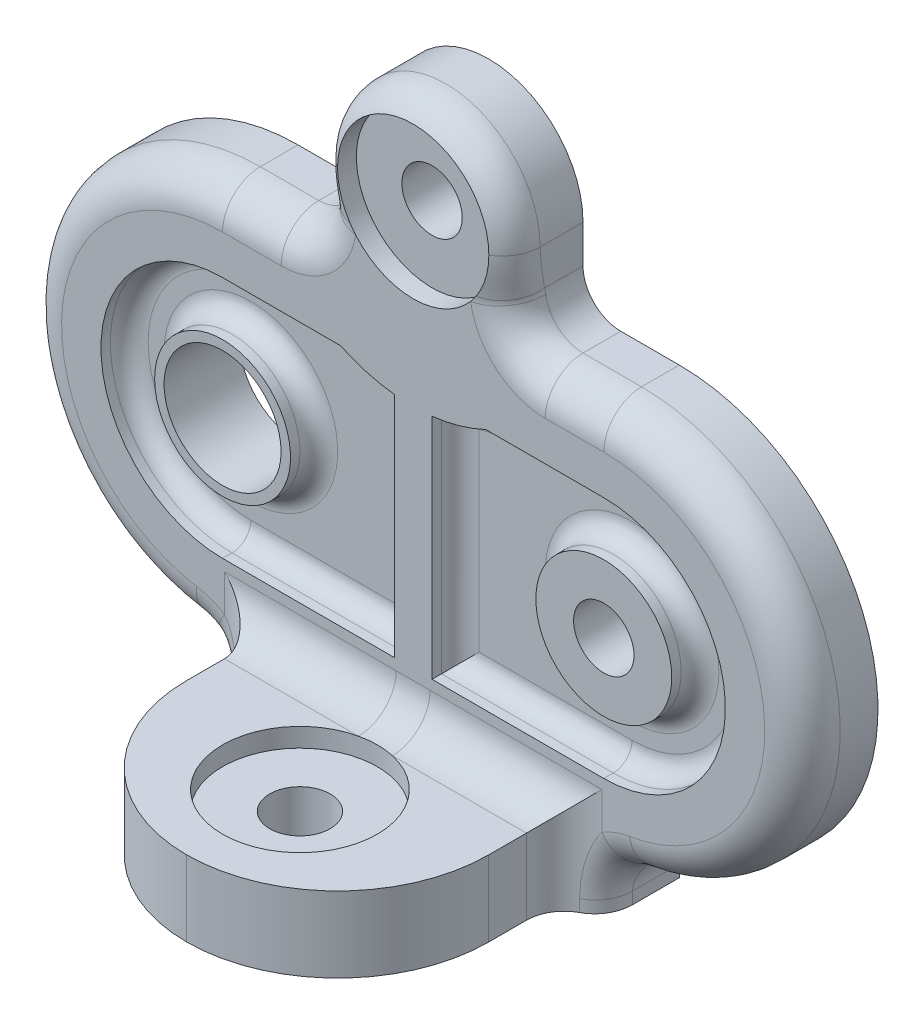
ISO-10303-21;
HEADER;
FILE_DESCRIPTION(('STEP AP214'),'2;1');
FILE_NAME('part.step','',(''),(''),'','','');
FILE_SCHEMA(('AUTOMOTIVE_DESIGN { 1 0 10303 214 1 1 1 1 }'));
ENDSEC;
DATA;
#1=APPLICATION_CONTEXT('core data for automotive mechanical design processes');
#2=APPLICATION_PROTOCOL_DEFINITION('international standard','automotive_design',2000,#1);
#3=PRODUCT_CONTEXT('',#1,'mechanical');
#4=PRODUCT('Part','Part','',(#3));
#5=PRODUCT_RELATED_PRODUCT_CATEGORY('part','',(#4));
#6=PRODUCT_DEFINITION_FORMATION('','',#4);
#7=PRODUCT_DEFINITION_CONTEXT('part definition',#1,'design');
#8=PRODUCT_DEFINITION('design','',#6,#7);
#9=PRODUCT_DEFINITION_SHAPE('','',#8);
#10=(LENGTH_UNIT() NAMED_UNIT(*) SI_UNIT(.MILLI.,.METRE.));
#11=(NAMED_UNIT(*) PLANE_ANGLE_UNIT() SI_UNIT($,.RADIAN.));
#12=(NAMED_UNIT(*) SI_UNIT($,.STERADIAN.) SOLID_ANGLE_UNIT());
#13=UNCERTAINTY_MEASURE_WITH_UNIT(LENGTH_MEASURE(1.E-05),#10,'distance_accuracy_value','');
#14=(GEOMETRIC_REPRESENTATION_CONTEXT(3) GLOBAL_UNCERTAINTY_ASSIGNED_CONTEXT((#13)) GLOBAL_UNIT_ASSIGNED_CONTEXT((#10,
#11,#12)) REPRESENTATION_CONTEXT('',''));
#15=CARTESIAN_POINT('',(0.,0.,0.));
#16=DIRECTION('',(0.,0.,1.));
#17=DIRECTION('',(1.,0.,0.));
#18=AXIS2_PLACEMENT_3D('',#15,#16,#17);
#19=CARTESIAN_POINT('',(0.,14.53,4.));
#20=DIRECTION('',(0.,0.,-1.));
#21=DIRECTION('',(-1.,0.,0.));
#22=AXIS2_PLACEMENT_3D('',#19,#20,#21);
#23=CYLINDRICAL_SURFACE('',#22,1.6);
#24=CARTESIAN_POINT('',(0.,14.53,0.));
#25=DIRECTION('',(0.,0.,1.));
#26=DIRECTION('',(1.,0.,0.));
#27=AXIS2_PLACEMENT_3D('',#24,#25,#26);
#28=CIRCLE('',#27,1.6);
#29=CARTESIAN_POINT('',(1.6,14.53,0.));
#30=VERTEX_POINT('',#29);
#31=EDGE_CURVE('E422',#30,#30,#28,.T.);
#32=ORIENTED_EDGE('',*,*,#31,.F.);
#33=EDGE_LOOP('',(#32));
#34=FACE_BOUND('',#33,.T.);
#35=CARTESIAN_POINT('',(0.,14.53,3.));
#36=DIRECTION('',(0.,0.,1.));
#37=DIRECTION('',(1.,0.,0.));
#38=AXIS2_PLACEMENT_3D('',#35,#36,#37);
#39=CIRCLE('',#38,1.6);
#40=CARTESIAN_POINT('',(1.6,14.53,3.));
#41=VERTEX_POINT('',#40);
#42=EDGE_CURVE('E528',#41,#41,#39,.T.);
#43=ORIENTED_EDGE('',*,*,#42,.T.);
#44=EDGE_LOOP('',(#43));
#45=FACE_BOUND('',#44,.T.);
#46=ADVANCED_FACE('F34',(#34,#45),#23,.F.);
#47=CARTESIAN_POINT('',(10.1,0.,4.));
#48=DIRECTION('',(0.,0.,-1.));
#49=DIRECTION('',(-1.,0.,0.));
#50=AXIS2_PLACEMENT_3D('',#47,#48,#49);
#51=PLANE('',#50);
#52=CARTESIAN_POINT('',(-10.1,0.,4.));
#53=DIRECTION('',(0.,0.,1.));
#54=DIRECTION('',(1.,0.,0.));
#55=AXIS2_PLACEMENT_3D('',#52,#53,#54);
#56=CIRCLE('',#55,3.1);
#57=CARTESIAN_POINT('',(-7.,0.,4.));
#58=VERTEX_POINT('',#57);
#59=EDGE_CURVE('E427',#58,#58,#56,.T.);
#60=ORIENTED_EDGE('',*,*,#59,.F.);
#61=EDGE_LOOP('',(#60));
#62=FACE_BOUND('',#61,.T.);
#63=CARTESIAN_POINT('',(-10.1,0.,4.));
#64=DIRECTION('',(0.,0.,1.));
#65=DIRECTION('',(-1.,0.,0.));
#66=AXIS2_PLACEMENT_3D('',#63,#64,#65);
#67=CIRCLE('',#66,3.6);
#68=CARTESIAN_POINT('',(-13.7,0.,4.));
#69=VERTEX_POINT('',#68);
#70=EDGE_CURVE('E531',#69,#69,#67,.T.);
#71=ORIENTED_EDGE('',*,*,#70,.T.);
#72=EDGE_LOOP('',(#71));
#73=FACE_BOUND('',#72,.T.);
#74=ADVANCED_FACE('F841',(#62,#73),#51,.F.);
#75=CARTESIAN_POINT('',(10.1,0.,4.));
#76=DIRECTION('',(0.,0.,1.));
#77=DIRECTION('',(1.,0.,0.));
#78=AXIS2_PLACEMENT_3D('',#75,#76,#77);
#79=CIRCLE('',#78,1.6);
#80=CARTESIAN_POINT('',(11.7,0.,4.));
#81=VERTEX_POINT('',#80);
#82=EDGE_CURVE('E433',#81,#81,#79,.T.);
#83=ORIENTED_EDGE('',*,*,#82,.F.);
#84=EDGE_LOOP('',(#83));
#85=FACE_BOUND('',#84,.T.);
#86=CARTESIAN_POINT('',(10.1,0.,4.));
#87=DIRECTION('',(0.,0.,1.));
#88=DIRECTION('',(1.,0.,0.));
#89=AXIS2_PLACEMENT_3D('',#86,#87,#88);
#90=CIRCLE('',#89,3.6);
#91=CARTESIAN_POINT('',(13.7,0.,4.));
#92=VERTEX_POINT('',#91);
#93=EDGE_CURVE('E373',#92,#92,#90,.T.);
#94=ORIENTED_EDGE('',*,*,#93,.T.);
#95=EDGE_LOOP('',(#94));
#96=FACE_BOUND('',#95,.T.);
#97=ADVANCED_FACE('F847',(#85,#96),#51,.F.);
#98=CARTESIAN_POINT('',(0.,-13.,10.));
#99=DIRECTION('',(0.,1.,0.));
#100=DIRECTION('',(0.,0.,1.));
#101=AXIS2_PLACEMENT_3D('',#98,#99,#100);
#102=CYLINDRICAL_SURFACE('',#101,1.6);
#103=CARTESIAN_POINT('',(0.,-13.,10.));
#104=DIRECTION('',(0.,1.,0.));
#105=DIRECTION('',(0.,0.,1.));
#106=AXIS2_PLACEMENT_3D('',#103,#104,#105);
#107=CIRCLE('',#106,1.6);
#108=CARTESIAN_POINT('',(0.,-13.,11.6));
#109=VERTEX_POINT('',#108);
#110=EDGE_CURVE('E414',#109,#109,#107,.T.);
#111=ORIENTED_EDGE('',*,*,#110,.F.);
#112=EDGE_LOOP('',(#111));
#113=FACE_BOUND('',#112,.T.);
#114=CARTESIAN_POINT('',(0.,-10.,10.));
#115=DIRECTION('',(0.,1.,0.));
#116=DIRECTION('',(0.,0.,1.));
#117=AXIS2_PLACEMENT_3D('',#114,#115,#116);
#118=CIRCLE('',#117,1.6);
#119=CARTESIAN_POINT('',(0.,-10.,11.6));
#120=VERTEX_POINT('',#119);
#121=EDGE_CURVE('E409',#120,#120,#118,.F.);
#122=ORIENTED_EDGE('',*,*,#121,.F.);
#123=EDGE_LOOP('',(#122));
#124=FACE_BOUND('',#123,.T.);
#125=ADVANCED_FACE('F866',(#113,#124),#102,.F.);
#126=DIRECTION('',(0.,1.,0.));
#127=VECTOR('',#126,1.);
#128=CARTESIAN_POINT('',(10.,-13.,4.));
#129=LINE('',#128,#127);
#130=CARTESIAN_POINT('',(10.,-7.00000000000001,4.));
#131=VERTEX_POINT('',#130);
#132=CARTESIAN_POINT('',(10.,-8.96494435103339,4.));
#133=VERTEX_POINT('',#132);
#134=EDGE_CURVE('E1806',#131,#133,#129,.F.);
#135=ORIENTED_EDGE('',*,*,#134,.T.);
#136=CARTESIAN_POINT('',(12.1,-12.3693532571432,4.));
#137=DIRECTION('',(0.,0.,-1.));
#138=DIRECTION('',(-1.,0.,0.));
#139=AXIS2_PLACEMENT_3D('',#136,#137,#138);
#140=CIRCLE('',#139,4.);
#141=CARTESIAN_POINT('',(11.4615323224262,-8.42063713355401,4.));
#142=VERTEX_POINT('',#141);
#143=EDGE_CURVE('E1148',#133,#142,#140,.T.);
#144=ORIENTED_EDGE('',*,*,#143,.T.);
#145=CARTESIAN_POINT('',(10.1,0.,4.));
#146=DIRECTION('',(0.,0.,-1.));
#147=DIRECTION('',(-1.,0.,0.));
#148=AXIS2_PLACEMENT_3D('',#145,#146,#147);
#149=CIRCLE('',#148,8.52999999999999);
#150=CARTESIAN_POINT('',(10.1,8.52999999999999,4.));
#151=VERTEX_POINT('',#150);
#152=EDGE_CURVE('E1149',#142,#151,#149,.F.);
#153=ORIENTED_EDGE('',*,*,#152,.T.);
#154=DIRECTION('',(-1.,0.,0.));
#155=VECTOR('',#154,1.);
#156=CARTESIAN_POINT('',(10.1,8.52999999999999,4.));
#157=LINE('',#156,#155);
#158=CARTESIAN_POINT('',(7.00000000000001,8.53,4.));
#159=VERTEX_POINT('',#158);
#160=EDGE_CURVE('E1150',#151,#159,#157,.T.);
#161=ORIENTED_EDGE('',*,*,#160,.T.);
#162=CARTESIAN_POINT('',(7.,12.53,4.));
#163=DIRECTION('',(0.,0.,-1.));
#164=DIRECTION('',(-1.,0.,0.));
#165=AXIS2_PLACEMENT_3D('',#162,#163,#164);
#166=CIRCLE('',#165,4.);
#167=CARTESIAN_POINT('',(3.04641324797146,11.9224213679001,4.));
#168=VERTEX_POINT('',#167);
#169=EDGE_CURVE('E914',#159,#168,#166,.T.);
#170=ORIENTED_EDGE('',*,*,#169,.T.);
#171=CARTESIAN_POINT('',(0.,14.53,4.));
#172=DIRECTION('',(0.,0.,1.));
#173=DIRECTION('',(1.,0.,0.));
#174=AXIS2_PLACEMENT_3D('',#171,#172,#173);
#175=CIRCLE('',#174,4.01);
#176=CARTESIAN_POINT('',(-3.04641324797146,11.9224213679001,4.));
#177=VERTEX_POINT('',#176);
#178=EDGE_CURVE('E1179',#177,#168,#175,.T.);
#179=ORIENTED_EDGE('',*,*,#178,.F.);
#180=CARTESIAN_POINT('',(-7.,12.53,4.));
#181=DIRECTION('',(0.,0.,-1.));
#182=DIRECTION('',(-1.,0.,0.));
#183=AXIS2_PLACEMENT_3D('',#180,#181,#182);
#184=CIRCLE('',#183,4.);
#185=CARTESIAN_POINT('',(-7.00000000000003,8.52999999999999,4.));
#186=VERTEX_POINT('',#185);
#187=EDGE_CURVE('E1177',#177,#186,#184,.T.);
#188=ORIENTED_EDGE('',*,*,#187,.T.);
#189=DIRECTION('',(-1.,0.,0.));
#190=VECTOR('',#189,1.);
#191=CARTESIAN_POINT('',(10.1,8.52999999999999,4.));
#192=LINE('',#191,#190);
#193=CARTESIAN_POINT('',(-10.1,8.52999999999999,4.));
#194=VERTEX_POINT('',#193);
#195=EDGE_CURVE('E1175',#186,#194,#192,.T.);
#196=ORIENTED_EDGE('',*,*,#195,.T.);
#197=CARTESIAN_POINT('',(-10.1,0.,4.));
#198=DIRECTION('',(0.,0.,-1.));
#199=DIRECTION('',(-1.,0.,0.));
#200=AXIS2_PLACEMENT_3D('',#197,#198,#199);
#201=CIRCLE('',#200,8.52999999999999);
#202=CARTESIAN_POINT('',(-11.4615323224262,-8.42063713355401,4.));
#203=VERTEX_POINT('',#202);
#204=EDGE_CURVE('E1171',#194,#203,#201,.F.);
#205=ORIENTED_EDGE('',*,*,#204,.T.);
#206=CARTESIAN_POINT('',(-12.1,-12.3693532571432,4.));
#207=DIRECTION('',(0.,0.,-1.));
#208=DIRECTION('',(-1.,0.,0.));
#209=AXIS2_PLACEMENT_3D('',#206,#207,#208);
#210=CIRCLE('',#209,4.);
#211=CARTESIAN_POINT('',(-10.,-8.96494435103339,4.));
#212=VERTEX_POINT('',#211);
#213=EDGE_CURVE('E1173',#203,#212,#210,.T.);
#214=ORIENTED_EDGE('',*,*,#213,.T.);
#215=DIRECTION('',(0.,-1.,0.));
#216=VECTOR('',#215,1.);
#217=CARTESIAN_POINT('',(-10.,-9.00000000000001,4.));
#218=LINE('',#217,#216);
#219=CARTESIAN_POINT('',(-10.,-7.00000000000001,4.));
#220=VERTEX_POINT('',#219);
#221=EDGE_CURVE('E1814',#212,#220,#218,.F.);
#222=ORIENTED_EDGE('',*,*,#221,.T.);
#223=DIRECTION('',(-1.,0.,0.));
#224=VECTOR('',#223,1.);
#225=CARTESIAN_POINT('',(8.,-7.00000000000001,4.));
#226=LINE('',#225,#224);
#227=CARTESIAN_POINT('',(-0.899999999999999,-7.00000000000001,4.));
#228=VERTEX_POINT('',#227);
#229=EDGE_CURVE('E885',#220,#228,#226,.F.);
#230=ORIENTED_EDGE('',*,*,#229,.T.);
#231=CARTESIAN_POINT('',(1.07531980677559,-9.00000000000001,6.04352589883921));
#232=CARTESIAN_POINT('',(1.07521149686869,-9.01830679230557,5.20251963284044));
#233=CARTESIAN_POINT('',(1.07869212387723,-8.43000312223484,4.60125981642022));
#234=CARTESIAN_POINT('',(1.08217275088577,-7.84169945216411,4.));
#235=CARTESIAN_POINT('',(1.08714955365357,-7.00050867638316,4.));
#236=CARTESIAN_POINT('',(0.991025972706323,-9.00000000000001,6.02057890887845));
#237=CARTESIAN_POINT('',(0.991130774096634,-9.00852467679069,5.18613715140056));
#238=CARTESIAN_POINT('',(0.992357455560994,-8.42147819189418,4.59305989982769));
#239=CARTESIAN_POINT('',(0.993808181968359,-7.83444813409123,4.));
#240=CARTESIAN_POINT('',(0.99559030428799,-6.99998998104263,4.));
#241=CARTESIAN_POINT('',(0.904455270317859,-9.00000000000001,5.99997985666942));
#242=CARTESIAN_POINT('',(0.904545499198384,-8.99995260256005,5.17154297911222));
#243=CARTESIAN_POINT('',(0.904336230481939,-8.41414305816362,4.58576598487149));
#244=CARTESIAN_POINT('',(0.904296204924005,-7.82834390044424,4.));
#245=CARTESIAN_POINT('',(0.904031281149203,-6.99992316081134,4.));
#246=CARTESIAN_POINT('',(0.727783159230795,-9.00000000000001,5.96411336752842));
#247=CARTESIAN_POINT('',(0.727829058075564,-8.98528220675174,5.14629287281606));
#248=CARTESIAN_POINT('',(0.725743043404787,-8.40172361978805,4.57314029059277));
#249=CARTESIAN_POINT('',(0.723817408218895,-7.81817756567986,4.));
#250=CARTESIAN_POINT('',(0.720913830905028,-7.00024465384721,4.));
#251=CARTESIAN_POINT('',(0.637681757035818,-9.00000000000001,5.94884592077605));
#252=CARTESIAN_POINT('',(0.637653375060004,-8.9791750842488,5.13562238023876));
#253=CARTESIAN_POINT('',(0.635171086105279,-8.39663931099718,4.56780850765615));
#254=CARTESIAN_POINT('',(0.632801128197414,-7.81410876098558,4.));
#255=CARTESIAN_POINT('',(0.629355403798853,-7.00063296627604,4.));
#256=CARTESIAN_POINT('',(0.455083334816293,-9.00000000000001,5.92429340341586));
#257=CARTESIAN_POINT('',(0.455006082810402,-8.96945879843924,5.1185301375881));
#258=CARTESIAN_POINT('',(0.452410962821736,-8.38859767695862,4.5592624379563));
#259=CARTESIAN_POINT('',(0.449930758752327,-7.80774133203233,4.));
#260=CARTESIAN_POINT('',(0.446351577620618,-7.00141562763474,4.));
#261=CARTESIAN_POINT('',(0.362589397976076,-9.00000000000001,5.91500099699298));
#262=CARTESIAN_POINT('',(0.362484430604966,-8.96584050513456,5.11209268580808));
#263=CARTESIAN_POINT('',(0.36022492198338,-8.38563774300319,4.5560455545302));
#264=CARTESIAN_POINT('',(0.358022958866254,-7.80543639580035,4.));
#265=CARTESIAN_POINT('',(0.354906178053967,-7.00180996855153,4.));
#266=CARTESIAN_POINT('',(0.176336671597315,-9.00000000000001,5.9027280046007));
#267=CARTESIAN_POINT('',(0.176279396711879,-8.96108436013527,5.10360633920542));
#268=CARTESIAN_POINT('',(0.174997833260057,-8.38175606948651,4.55180265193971));
#269=CARTESIAN_POINT('',(0.17377274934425,-7.80242875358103,4.));
#270=CARTESIAN_POINT('',(0.1720145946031,-7.00236306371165,4.));
#271=CARTESIAN_POINT('',(0.0825778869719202,-9.00000000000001,5.899747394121));
#272=CARTESIAN_POINT('',(0.0825375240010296,-8.95994346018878,5.10155202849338));
#273=CARTESIAN_POINT('',(0.0819567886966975,-8.38083432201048,4.55077662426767));
#274=CARTESIAN_POINT('',(0.0813720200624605,-7.80172409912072,4.));
#275=CARTESIAN_POINT('',(0.0805684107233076,-7.00252181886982,4.));
#276=CARTESIAN_POINT('',(-0.197653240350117,-9.00000000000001,5.90054797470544));
#277=CARTESIAN_POINT('',(-0.197563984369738,-8.96023834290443,5.10209943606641));
#278=CARTESIAN_POINT('',(-0.196165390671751,-8.38106413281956,4.55104849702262));
#279=CARTESIAN_POINT('',(-0.194773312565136,-7.80189209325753,4.));
#280=CARTESIAN_POINT('',(-0.192841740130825,-7.00245904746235,4.));
#281=CARTESIAN_POINT('',(-0.384032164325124,-9.00000000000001,5.91394285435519));
#282=CARTESIAN_POINT('',(-0.384103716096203,-8.9653456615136,5.11132844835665));
#283=CARTESIAN_POINT('',(-0.381189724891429,-8.38517111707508,4.55565207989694));
#284=CARTESIAN_POINT('',(-0.378746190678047,-7.80501837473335,4.));
#285=CARTESIAN_POINT('',(-0.374804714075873,-7.00170554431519,4.));
#286=CARTESIAN_POINT('',(-0.74665443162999,-9.00000000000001,5.96438563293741));
#287=CARTESIAN_POINT('',(-0.746837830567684,-8.98536317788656,5.14647198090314));
#288=CARTESIAN_POINT('',(-0.744357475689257,-8.40176825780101,4.5732256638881));
#289=CARTESIAN_POINT('',(-0.742335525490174,-7.81819398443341,4.));
#290=CARTESIAN_POINT('',(-0.738942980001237,-7.00018127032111,4.));
#291=CARTESIAN_POINT('',(-0.922885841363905,-9.00000000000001,6.00146078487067));
#292=CARTESIAN_POINT('',(-0.923437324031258,-9.00033438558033,5.17249165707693));
#293=CARTESIAN_POINT('',(-0.922492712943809,-8.41426807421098,4.58620530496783));
#294=CARTESIAN_POINT('',(-0.922380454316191,-7.82828522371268,4.));
#295=CARTESIAN_POINT('',(-0.921118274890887,-6.99941048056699,4.));
#296=CARTESIAN_POINT('',(-1.25969890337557,-9.00000000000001,6.09434214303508));
#297=CARTESIAN_POINT('',(-1.25970303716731,-9.04011878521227,5.23897017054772));
#298=CARTESIAN_POINT('',(-1.26761211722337,-8.44900244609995,4.61944430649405));
#299=CARTESIAN_POINT('',(-1.27637733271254,-7.85797258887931,4.));
#300=CARTESIAN_POINT('',(-1.28792036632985,-7.00182444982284,4.));
#301=CARTESIAN_POINT('',(-1.42003768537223,-9.00000000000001,6.15039400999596));
#302=CARTESIAN_POINT('',(-1.41936749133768,-9.06515239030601,5.27975994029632));
#303=CARTESIAN_POINT('',(-1.43441368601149,-8.47136590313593,4.6397994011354));
#304=CARTESIAN_POINT('',(-1.45054595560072,-7.87777343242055,4.));
#305=CARTESIAN_POINT('',(-1.47254711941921,-7.0050626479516,4.));
#306=CARTESIAN_POINT('',(-1.71785660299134,-9.00000000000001,6.2737483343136));
#307=CARTESIAN_POINT('',(-1.71118603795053,-9.12389904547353,5.37202067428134));
#308=CARTESIAN_POINT('',(-1.74777474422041,-8.52677002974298,4.68593147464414));
#309=CARTESIAN_POINT('',(-1.78544335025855,-7.92982994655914,4.));
#310=CARTESIAN_POINT('',(-1.84102544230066,-7.02136961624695,4.));
#311=CARTESIAN_POINT('',(-1.85539732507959,-9.00000000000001,6.34101998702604));
#312=CARTESIAN_POINT('',(-1.84347914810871,-9.15770017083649,5.42361749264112));
#313=CARTESIAN_POINT('',(-1.89438770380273,-8.5597816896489,4.71169365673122));
#314=CARTESIAN_POINT('',(-1.94640829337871,-7.9621837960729,4.));
#315=CARTESIAN_POINT('',(-2.02487775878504,-7.03441180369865,4.));
#316=CARTESIAN_POINT('',(-2.04458336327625,-9.00000000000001,6.4454357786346));
#317=CARTESIAN_POINT('',(-2.01694308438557,-9.21258211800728,5.50626020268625));
#318=CARTESIAN_POINT('',(-2.09540425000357,-8.61703769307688,4.75310019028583));
#319=CARTESIAN_POINT('',(-2.17415857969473,-8.02157482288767,4.));
#320=CARTESIAN_POINT('',(-2.2998775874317,-7.06646294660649,4.));
#321=CARTESIAN_POINT('',(-2.10496837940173,-9.00000000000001,6.48095356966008));
#322=CARTESIAN_POINT('',(-2.07089942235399,-9.23172054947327,5.53490017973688));
#323=CARTESIAN_POINT('',(-2.15944590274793,-8.63749633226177,4.76741677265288));
#324=CARTESIAN_POINT('',(-2.24826794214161,-8.04336984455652,4.));
#325=CARTESIAN_POINT('',(-2.39172782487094,-7.07929363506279,4.));
#326=CARTESIAN_POINT('',(-2.21987430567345,-9.00000000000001,6.55228708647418));
#327=CARTESIAN_POINT('',(-2.16961890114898,-9.27067075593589,5.59347007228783));
#328=CARTESIAN_POINT('',(-2.28017335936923,-8.68061966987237,4.7967017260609));
#329=CARTESIAN_POINT('',(-2.39100159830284,-8.09066707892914,4.));
#330=CARTESIAN_POINT('',(-2.57453263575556,-7.11006377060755,4.));
#331=CARTESIAN_POINT('',(-2.27439842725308,-9.00000000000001,6.58810263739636));
#332=CARTESIAN_POINT('',(-2.21435705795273,-9.29048994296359,5.62341224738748));
#333=CARTESIAN_POINT('',(-2.33686319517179,-8.70328314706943,4.81166973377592));
#334=CARTESIAN_POINT('',(-2.45962111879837,-8.11618989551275,4.));
#335=CARTESIAN_POINT('',(-2.66548767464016,-7.12800040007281,4.));
#336=CARTESIAN_POINT('',(-2.37823640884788,-9.00000000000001,6.6596392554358));
#337=CARTESIAN_POINT('',(-2.29437193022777,-9.33005473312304,5.68439315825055));
#338=CARTESIAN_POINT('',(-2.4426259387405,-8.75051449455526,4.84215972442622));
#339=CARTESIAN_POINT('',(-2.59113630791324,-8.17108762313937,4.));
#340=CARTESIAN_POINT('',(-2.84690210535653,-7.17011334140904,4.));
#341=CARTESIAN_POINT('',(-2.427495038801,-9.00000000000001,6.69535609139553));
#342=CARTESIAN_POINT('',(-2.32950974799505,-9.34979887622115,5.71544730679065));
#343=CARTESIAN_POINT('',(-2.49162023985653,-8.77509860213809,4.85768565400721));
#344=CARTESIAN_POINT('',(-2.6539471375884,-8.20051823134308,4.));
#345=CARTESIAN_POINT('',(-2.93734828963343,-7.19434807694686,4.));
#346=CARTESIAN_POINT('',(-2.52047616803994,-9.00000000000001,6.76571579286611));
#347=CARTESIAN_POINT('',(-2.38934642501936,-9.38763707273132,5.77788872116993));
#348=CARTESIAN_POINT('',(-2.58068088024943,-8.82504167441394,4.88890442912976));
#349=CARTESIAN_POINT('',(-2.7722435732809,-8.2625757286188,4.));
#350=CARTESIAN_POINT('',(-3.1162080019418,-7.2499592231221,4.));
#351=CARTESIAN_POINT('',(-2.56418695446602,-9.00000000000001,6.80035627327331));
#352=CARTESIAN_POINT('',(-2.41397264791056,-9.40572043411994,5.80928009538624));
#353=CARTESIAN_POINT('',(-2.62072846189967,-8.85040214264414,4.90459755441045));
#354=CARTESIAN_POINT('',(-2.82768033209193,-8.29522709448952,4.));
#355=CARTESIAN_POINT('',(-3.2046169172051,-7.28135036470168,4.));
#356=CARTESIAN_POINT('',(-2.6051631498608,-9.00000000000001,6.83406807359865));
#357=CARTESIAN_POINT('',(-2.43302402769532,-9.42217188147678,5.84043344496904));
#358=CARTESIAN_POINT('',(-2.65587507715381,-8.87562879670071,4.92021672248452));
#359=CARTESIAN_POINT('',(-2.87872612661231,-8.32908571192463,4.));
#360=CARTESIAN_POINT('',(-3.29149608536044,-7.31676574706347,4.));
#361=(BOUNDED_SURFACE() B_SPLINE_SURFACE(3,2,((#231,#232,#233,#234,#235),(#236,#237,#238,#239,
#240),(#241,#242,#243,#244,#245),(#246,#247,#248,#249,#250),(#251,#252,#253,#254,#255),(#256,
#257,#258,#259,#260),(#261,#262,#263,#264,#265),(#266,#267,#268,#269,#270),(#271,#272,#273,#274,
#275),(#276,#277,#278,#279,#280),(#281,#282,#283,#284,#285),(#286,#287,#288,#289,#290),(#291,
#292,#293,#294,#295),(#296,#297,#298,#299,#300),(#301,#302,#303,#304,#305),(#306,#307,#308,#309,
#310),(#311,#312,#313,#314,#315),(#316,#317,#318,#319,#320),(#321,#322,#323,#324,#325),(#326,
#327,#328,#329,#330),(#331,#332,#333,#334,#335),(#336,#337,#338,#339,#340),(#341,#342,#343,#344,
#345),(#346,#347,#348,#349,#350),(#351,#352,#353,#354,#355),(#356,#357,#358,#359,#360)),
.UNSPECIFIED.,.F.,.F.,.F.) B_SPLINE_SURFACE_WITH_KNOTS((4,2,2,2,2,2,2,2,2,2,2,2,4),(3,2,3),(0.,
0.274677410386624,0.549354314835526,0.823693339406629,1.09803129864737,1.6439250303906,
2.19044815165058,2.74433541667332,3.29672625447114,3.57483437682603,3.85278932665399,
4.13342093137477,4.41463549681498),(0.,0.5,1.),
.UNSPECIFIED.) GEOMETRIC_REPRESENTATION_ITEM() RATIONAL_B_SPLINE_SURFACE(((1.,0.921783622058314,
1.,0.921783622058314,1.),(1.,0.922895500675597,1.,0.922895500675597,1.),(1.,0.923882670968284,
1.,0.923882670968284,1.),(1.,0.925589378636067,1.,0.925589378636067,1.),(1.,0.926308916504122,
1.,0.926308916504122,1.),(1.,0.927461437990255,1.,0.927461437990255,1.),(1.,0.927894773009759,
1.,0.927894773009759,1.),(1.,0.928466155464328,1.,0.928466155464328,1.),(1.,0.928604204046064,
1.,0.928604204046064,1.),(1.,0.928567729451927,1.,0.928567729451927,1.),(1.,0.927948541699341,
1.,0.927948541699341,1.),(1.,0.925578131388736,1.,0.925578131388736,1.),(1.,0.923825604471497,
1.,0.923825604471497,1.),(1.,0.919317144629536,1.,0.919317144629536,1.),(1.,0.91654800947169,1.,
0.91654800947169,1.),(1.,0.910234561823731,1.,0.910234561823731,1.),(1.,0.906692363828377,1.,
0.906692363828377,1.),(1.,0.900959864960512,1.,0.900959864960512,1.),(1.,0.898971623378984,1.,
0.898971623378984,1.),(1.,0.89489034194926,1.,0.89489034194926,1.),(1.,0.892797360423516,1.,
0.892797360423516,1.),(1.,0.888518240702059,1.,0.888518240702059,1.),(1.,0.88633139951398,1.,
0.88633139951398,1.),(1.,0.881917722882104,1.,0.881917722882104,1.),(1.,0.879690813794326,1.,
0.879690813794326,1.),(1.,0.877465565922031,1.,0.877465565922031,1.))) REPRESENTATION_ITEM('') SURFACE());
#362=CARTESIAN_POINT('',(-3.29149608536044,-7.31676574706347,4.));
#363=CARTESIAN_POINT('',(-3.2046169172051,-7.28135036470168,4.));
#364=CARTESIAN_POINT('',(-3.1162080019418,-7.2499592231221,4.));
#365=CARTESIAN_POINT('',(-2.93734828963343,-7.19434807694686,4.));
#366=CARTESIAN_POINT('',(-2.84690210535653,-7.17011334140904,4.));
#367=CARTESIAN_POINT('',(-2.66548767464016,-7.12800040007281,4.));
#368=CARTESIAN_POINT('',(-2.57453263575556,-7.11006377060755,4.));
#369=CARTESIAN_POINT('',(-2.39172782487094,-7.07929363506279,4.));
#370=CARTESIAN_POINT('',(-2.2998775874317,-7.06646294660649,4.));
#371=CARTESIAN_POINT('',(-2.02487775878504,-7.03441180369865,4.));
#372=CARTESIAN_POINT('',(-1.84102544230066,-7.02136961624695,4.));
#373=CARTESIAN_POINT('',(-1.47254711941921,-7.0050626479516,4.));
#374=CARTESIAN_POINT('',(-1.28792036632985,-7.00182444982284,4.));
#375=CARTESIAN_POINT('',(-0.921118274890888,-6.99941048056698,4.));
#376=CARTESIAN_POINT('',(-0.738942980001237,-7.00018127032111,4.));
#377=CARTESIAN_POINT('',(-0.374804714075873,-7.00170554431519,4.));
#378=CARTESIAN_POINT('',(-0.192841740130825,-7.00245904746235,4.));
#379=CARTESIAN_POINT('',(0.0805684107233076,-7.00252181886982,4.));
#380=CARTESIAN_POINT('',(0.1720145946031,-7.00236306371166,4.));
#381=CARTESIAN_POINT('',(0.354906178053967,-7.00180996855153,4.));
#382=CARTESIAN_POINT('',(0.446351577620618,-7.00141562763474,4.));
#383=CARTESIAN_POINT('',(0.629355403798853,-7.00063296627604,4.));
#384=CARTESIAN_POINT('',(0.720913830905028,-7.00024465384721,4.));
#385=CARTESIAN_POINT('',(0.904031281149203,-6.99992316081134,4.));
#386=CARTESIAN_POINT('',(0.99559030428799,-6.99998998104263,4.));
#387=CARTESIAN_POINT('',(1.08714955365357,-7.00050867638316,4.));
#388=B_SPLINE_CURVE_WITH_KNOTS('',3,(#362,#363,#364,#365,#366,#367,#368,#369,#370,#371,#372,
#373,#374,#375,#376,#377,#378,#379,#380,#381,#382,#383,#384,#385,#386,#387),.UNSPECIFIED.,.F.,
.F.,(4,2,2,2,2,2,2,2,2,2,2,2,4),(0.,0.28121456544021,0.561846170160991,0.839801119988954,
1.11790924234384,1.67030008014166,2.22418734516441,2.77071046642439,3.31660419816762,
3.59094215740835,3.86528118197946,4.13995808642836,4.41463549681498),.UNSPECIFIED.);
#389=CARTESIAN_POINT('',(0.899999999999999,-7.00000000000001,4.));
#390=VERTEX_POINT('',#389);
#391=EDGE_CURVE('E878',#228,#390,#388,.T.);
#392=ORIENTED_EDGE('',*,*,#391,.T.);
#393=DIRECTION('',(-1.,0.,0.));
#394=VECTOR('',#393,1.);
#395=CARTESIAN_POINT('',(8.,-7.00000000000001,4.));
#396=LINE('',#395,#394);
#397=EDGE_CURVE('E886',#390,#131,#396,.F.);
#398=ORIENTED_EDGE('',*,*,#397,.T.);
#399=EDGE_LOOP('',(#135,#144,#153,#161,#170,#179,#188,#196,#205,#214,#222,#230,#392,#398));
#400=FACE_BOUND('',#399,.T.);
#401=DIRECTION('',(1.,0.,0.));
#402=VECTOR('',#401,1.);
#403=CARTESIAN_POINT('',(-10.1,-6.4430025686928,4.));
#404=LINE('',#403,#402);
#405=CARTESIAN_POINT('',(-10.1,-6.4430025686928,4.));
#406=VERTEX_POINT('',#405);
#407=CARTESIAN_POINT('',(-1.,-6.4430025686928,4.));
#408=VERTEX_POINT('',#407);
#409=EDGE_CURVE('E351',#406,#408,#404,.T.);
#410=ORIENTED_EDGE('',*,*,#409,.F.);
#411=CARTESIAN_POINT('',(-10.1,0.,4.));
#412=DIRECTION('',(0.,0.,1.));
#413=DIRECTION('',(-1.,0.,0.));
#414=AXIS2_PLACEMENT_3D('',#411,#412,#413);
#415=CIRCLE('',#414,6.4430025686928);
#416=CARTESIAN_POINT('',(-10.1,6.4430025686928,4.));
#417=VERTEX_POINT('',#416);
#418=EDGE_CURVE('E357',#417,#406,#415,.T.);
#419=ORIENTED_EDGE('',*,*,#418,.F.);
#420=DIRECTION('',(-1.,0.,0.));
#421=VECTOR('',#420,1.);
#422=CARTESIAN_POINT('',(-10.1,6.4430025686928,4.));
#423=LINE('',#422,#421);
#424=CARTESIAN_POINT('',(-3.84607701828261,6.4430025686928,4.));
#425=VERTEX_POINT('',#424);
#426=EDGE_CURVE('E365',#425,#417,#423,.T.);
#427=ORIENTED_EDGE('',*,*,#426,.F.);
#428=CARTESIAN_POINT('',(0.,14.53,4.));
#429=DIRECTION('',(0.,0.,-1.));
#430=DIRECTION('',(-1.,0.,0.));
#431=AXIS2_PLACEMENT_3D('',#428,#429,#430);
#432=CIRCLE('',#431,8.95498944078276);
#433=CARTESIAN_POINT('',(-1.,5.63102051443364,4.));
#434=VERTEX_POINT('',#433);
#435=EDGE_CURVE('E363',#434,#425,#432,.T.);
#436=ORIENTED_EDGE('',*,*,#435,.F.);
#437=DIRECTION('',(0.,1.,0.));
#438=VECTOR('',#437,1.);
#439=CARTESIAN_POINT('',(-1.,5.63102051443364,4.));
#440=LINE('',#439,#438);
#441=EDGE_CURVE('E343',#408,#434,#440,.T.);
#442=ORIENTED_EDGE('',*,*,#441,.F.);
#443=EDGE_LOOP('',(#410,#419,#427,#436,#442));
#444=FACE_BOUND('',#443,.T.);
#445=DIRECTION('',(-1.,0.,0.));
#446=VECTOR('',#445,1.);
#447=CARTESIAN_POINT('',(10.1,6.4430025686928,4.));
#448=LINE('',#447,#446);
#449=CARTESIAN_POINT('',(10.1,6.4430025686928,4.));
#450=VERTEX_POINT('',#449);
#451=CARTESIAN_POINT('',(3.84607701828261,6.4430025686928,4.));
#452=VERTEX_POINT('',#451);
#453=EDGE_CURVE('E383',#450,#452,#448,.T.);
#454=ORIENTED_EDGE('',*,*,#453,.F.);
#455=CARTESIAN_POINT('',(10.1,0.,4.));
#456=DIRECTION('',(0.,0.,1.));
#457=DIRECTION('',(1.,0.,0.));
#458=AXIS2_PLACEMENT_3D('',#455,#456,#457);
#459=CIRCLE('',#458,6.4430025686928);
#460=CARTESIAN_POINT('',(10.1,-6.4430025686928,4.));
#461=VERTEX_POINT('',#460);
#462=EDGE_CURVE('E380',#461,#450,#459,.T.);
#463=ORIENTED_EDGE('',*,*,#462,.F.);
#464=DIRECTION('',(1.,0.,0.));
#465=VECTOR('',#464,1.);
#466=CARTESIAN_POINT('',(10.1,-6.4430025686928,4.));
#467=LINE('',#466,#465);
#468=CARTESIAN_POINT('',(1.,-6.4430025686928,4.));
#469=VERTEX_POINT('',#468);
#470=EDGE_CURVE('E392',#469,#461,#467,.T.);
#471=ORIENTED_EDGE('',*,*,#470,.F.);
#472=DIRECTION('',(0.,-1.,0.));
#473=VECTOR('',#472,1.);
#474=CARTESIAN_POINT('',(1.,5.63102051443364,4.));
#475=LINE('',#474,#473);
#476=CARTESIAN_POINT('',(0.999999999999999,5.63102051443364,4.));
#477=VERTEX_POINT('',#476);
#478=EDGE_CURVE('E389',#477,#469,#475,.T.);
#479=ORIENTED_EDGE('',*,*,#478,.F.);
#480=CARTESIAN_POINT('',(0.,14.53,4.));
#481=DIRECTION('',(0.,0.,-1.));
#482=DIRECTION('',(1.,0.,0.));
#483=AXIS2_PLACEMENT_3D('',#480,#481,#482);
#484=CIRCLE('',#483,8.95498944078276);
#485=EDGE_CURVE('E386',#452,#477,#484,.T.);
#486=ORIENTED_EDGE('',*,*,#485,.F.);
#487=EDGE_LOOP('',(#454,#463,#471,#479,#486));
#488=FACE_BOUND('',#487,.T.);
#489=ADVANCED_FACE('F359',(#400,#444,#488),#51,.F.);
#490=CARTESIAN_POINT('',(10.1,0.,0.));
#491=DIRECTION('',(0.,0.,-1.));
#492=DIRECTION('',(-1.,0.,0.));
#493=AXIS2_PLACEMENT_3D('',#490,#491,#492);
#494=PLANE('',#493);
#495=CARTESIAN_POINT('',(-10.1,0.,0.));
#496=DIRECTION('',(0.,0.,1.));
#497=DIRECTION('',(1.,0.,0.));
#498=AXIS2_PLACEMENT_3D('',#495,#496,#497);
#499=CIRCLE('',#498,3.1);
#500=CARTESIAN_POINT('',(-7.,0.,0.));
#501=VERTEX_POINT('',#500);
#502=EDGE_CURVE('E426',#501,#501,#499,.T.);
#503=ORIENTED_EDGE('',*,*,#502,.T.);
#504=EDGE_LOOP('',(#503));
#505=FACE_BOUND('',#504,.T.);
#506=CARTESIAN_POINT('',(10.1,0.,0.));
#507=DIRECTION('',(0.,0.,1.));
#508=DIRECTION('',(-1.,0.,0.));
#509=AXIS2_PLACEMENT_3D('',#506,#507,#508);
#510=CIRCLE('',#509,10.53);
#511=CARTESIAN_POINT('',(11.7807661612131,-10.3949951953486,0.));
#512=VERTEX_POINT('',#511);
#513=CARTESIAN_POINT('',(10.1,10.53,0.));
#514=VERTEX_POINT('',#513);
#515=EDGE_CURVE('E436',#512,#514,#510,.T.);
#516=ORIENTED_EDGE('',*,*,#515,.F.);
#517=CARTESIAN_POINT('',(12.1,-12.3693532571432,0.));
#518=DIRECTION('',(0.,0.,-1.));
#519=DIRECTION('',(1.,0.,0.));
#520=AXIS2_PLACEMENT_3D('',#517,#518,#519);
#521=CIRCLE('',#520,2.);
#522=CARTESIAN_POINT('',(10.1,-12.3693532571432,0.));
#523=VERTEX_POINT('',#522);
#524=EDGE_CURVE('E477',#523,#512,#521,.T.);
#525=ORIENTED_EDGE('',*,*,#524,.F.);
#526=DIRECTION('',(0.,1.,0.));
#527=VECTOR('',#526,1.);
#528=CARTESIAN_POINT('',(10.1,-12.3693532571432,0.));
#529=LINE('',#528,#527);
#530=CARTESIAN_POINT('',(10.1,-13.,0.));
#531=VERTEX_POINT('',#530);
#532=EDGE_CURVE('E474',#531,#523,#529,.T.);
#533=ORIENTED_EDGE('',*,*,#532,.F.);
#534=DIRECTION('',(1.,0.,0.));
#535=VECTOR('',#534,1.);
#536=CARTESIAN_POINT('',(-10.1,-13.,0.));
#537=LINE('',#536,#535);
#538=CARTESIAN_POINT('',(-10.1,-13.,0.));
#539=VERTEX_POINT('',#538);
#540=EDGE_CURVE('E471',#539,#531,#537,.T.);
#541=ORIENTED_EDGE('',*,*,#540,.F.);
#542=DIRECTION('',(0.,-1.,0.));
#543=VECTOR('',#542,1.);
#544=CARTESIAN_POINT('',(-10.1,-12.3693532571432,0.));
#545=LINE('',#544,#543);
#546=CARTESIAN_POINT('',(-10.1,-12.3693532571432,0.));
#547=VERTEX_POINT('',#546);
#548=EDGE_CURVE('E468',#547,#539,#545,.T.);
#549=ORIENTED_EDGE('',*,*,#548,.F.);
#550=CARTESIAN_POINT('',(-12.1,-12.3693532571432,0.));
#551=DIRECTION('',(0.,0.,-1.));
#552=DIRECTION('',(1.,0.,0.));
#553=AXIS2_PLACEMENT_3D('',#550,#551,#552);
#554=CIRCLE('',#553,2.);
#555=CARTESIAN_POINT('',(-11.7807661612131,-10.3949951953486,0.));
#556=VERTEX_POINT('',#555);
#557=EDGE_CURVE('E465',#556,#547,#554,.T.);
#558=ORIENTED_EDGE('',*,*,#557,.F.);
#559=CARTESIAN_POINT('',(-10.1,0.,0.));
#560=DIRECTION('',(0.,0.,1.));
#561=DIRECTION('',(1.,0.,0.));
#562=AXIS2_PLACEMENT_3D('',#559,#560,#561);
#563=CIRCLE('',#562,10.53);
#564=CARTESIAN_POINT('',(-10.1,10.53,0.));
#565=VERTEX_POINT('',#564);
#566=EDGE_CURVE('E462',#565,#556,#563,.T.);
#567=ORIENTED_EDGE('',*,*,#566,.F.);
#568=DIRECTION('',(-1.,0.,0.));
#569=VECTOR('',#568,1.);
#570=CARTESIAN_POINT('',(-10.1,10.53,0.));
#571=LINE('',#570,#569);
#572=CARTESIAN_POINT('',(-7.00000000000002,10.53,0.));
#573=VERTEX_POINT('',#572);
#574=EDGE_CURVE('E459',#573,#565,#571,.T.);
#575=ORIENTED_EDGE('',*,*,#574,.F.);
#576=CARTESIAN_POINT('',(-7.,12.53,0.));
#577=DIRECTION('',(0.,0.,-1.));
#578=DIRECTION('',(-1.,0.,0.));
#579=AXIS2_PLACEMENT_3D('',#576,#577,#578);
#580=CIRCLE('',#579,2.);
#581=CARTESIAN_POINT('',(-5.,12.53,0.));
#582=VERTEX_POINT('',#581);
#583=EDGE_CURVE('E456',#582,#573,#580,.T.);
#584=ORIENTED_EDGE('',*,*,#583,.F.);
#585=DIRECTION('',(0.,-1.,0.));
#586=VECTOR('',#585,1.);
#587=CARTESIAN_POINT('',(-5.,14.53,0.));
#588=LINE('',#587,#586);
#589=CARTESIAN_POINT('',(-5.,14.53,0.));
#590=VERTEX_POINT('',#589);
#591=EDGE_CURVE('E453',#590,#582,#588,.T.);
#592=ORIENTED_EDGE('',*,*,#591,.F.);
#593=CARTESIAN_POINT('',(0.,14.53,0.));
#594=DIRECTION('',(0.,0.,1.));
#595=DIRECTION('',(1.,0.,0.));
#596=AXIS2_PLACEMENT_3D('',#593,#594,#595);
#597=CIRCLE('',#596,5.);
#598=CARTESIAN_POINT('',(5.,14.53,0.));
#599=VERTEX_POINT('',#598);
#600=EDGE_CURVE('E450',#599,#590,#597,.T.);
#601=ORIENTED_EDGE('',*,*,#600,.F.);
#602=DIRECTION('',(0.,1.,0.));
#603=VECTOR('',#602,1.);
#604=CARTESIAN_POINT('',(5.,14.53,0.));
#605=LINE('',#604,#603);
#606=CARTESIAN_POINT('',(5.,12.53,0.));
#607=VERTEX_POINT('',#606);
#608=EDGE_CURVE('E447',#607,#599,#605,.T.);
#609=ORIENTED_EDGE('',*,*,#608,.F.);
#610=CARTESIAN_POINT('',(7.,12.53,0.));
#611=DIRECTION('',(0.,0.,-1.));
#612=DIRECTION('',(1.,0.,0.));
#613=AXIS2_PLACEMENT_3D('',#610,#611,#612);
#614=CIRCLE('',#613,2.);
#615=CARTESIAN_POINT('',(7.00000000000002,10.53,0.));
#616=VERTEX_POINT('',#615);
#617=EDGE_CURVE('E444',#616,#607,#614,.T.);
#618=ORIENTED_EDGE('',*,*,#617,.F.);
#619=DIRECTION('',(-1.,0.,0.));
#620=VECTOR('',#619,1.);
#621=CARTESIAN_POINT('',(7.00000000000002,10.53,0.));
#622=LINE('',#621,#620);
#623=EDGE_CURVE('E441',#514,#616,#622,.T.);
#624=ORIENTED_EDGE('',*,*,#623,.F.);
#625=EDGE_LOOP('',(#516,#525,#533,#541,#549,#558,#567,#575,#584,#592,#601,#609,#618,#624));
#626=FACE_BOUND('',#625,.T.);
#627=CARTESIAN_POINT('',(10.1,0.,0.));
#628=DIRECTION('',(0.,0.,1.));
#629=DIRECTION('',(1.,0.,0.));
#630=AXIS2_PLACEMENT_3D('',#627,#628,#629);
#631=CIRCLE('',#630,1.6);
#632=CARTESIAN_POINT('',(11.7,0.,0.));
#633=VERTEX_POINT('',#632);
#634=EDGE_CURVE('E430',#633,#633,#631,.T.);
#635=ORIENTED_EDGE('',*,*,#634,.T.);
#636=EDGE_LOOP('',(#635));
#637=FACE_BOUND('',#636,.T.);
#638=ORIENTED_EDGE('',*,*,#31,.T.);
#639=EDGE_LOOP('',(#638));
#640=FACE_BOUND('',#639,.T.);
#641=ADVANCED_FACE('F865',(#505,#626,#637,#640),#494,.T.);
#642=CARTESIAN_POINT('',(10.1,0.,4.));
#643=DIRECTION('',(0.,0.,-1.));
#644=DIRECTION('',(-1.,0.,0.));
#645=AXIS2_PLACEMENT_3D('',#642,#643,#644);
#646=CYLINDRICAL_SURFACE('',#645,10.53);
#647=DIRECTION('',(0.,0.,-1.));
#648=VECTOR('',#647,1.);
#649=CARTESIAN_POINT('',(10.1,10.53,4.));
#650=LINE('',#649,#648);
#651=CARTESIAN_POINT('',(10.1,10.53,2.));
#652=VERTEX_POINT('',#651);
#653=EDGE_CURVE('E506',#652,#514,#650,.T.);
#654=ORIENTED_EDGE('',*,*,#653,.F.);
#655=CARTESIAN_POINT('',(10.1,0.,2.));
#656=DIRECTION('',(0.,0.,-1.));
#657=DIRECTION('',(-1.,0.,0.));
#658=AXIS2_PLACEMENT_3D('',#655,#656,#657);
#659=CIRCLE('',#658,10.53);
#660=CARTESIAN_POINT('',(11.7807661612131,-10.3949951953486,2.));
#661=VERTEX_POINT('',#660);
#662=EDGE_CURVE('E922',#652,#661,#659,.T.);
#663=ORIENTED_EDGE('',*,*,#662,.T.);
#664=DIRECTION('',(0.,0.,-1.));
#665=VECTOR('',#664,1.);
#666=CARTESIAN_POINT('',(11.7807661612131,-10.3949951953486,4.));
#667=LINE('',#666,#665);
#668=EDGE_CURVE('E480',#661,#512,#667,.T.);
#669=ORIENTED_EDGE('',*,*,#668,.T.);
#670=ORIENTED_EDGE('',*,*,#515,.T.);
#671=EDGE_LOOP('',(#654,#663,#669,#670));
#672=FACE_BOUND('',#671,.T.);
#673=ADVANCED_FACE('F891',(#672),#646,.T.);
#674=CARTESIAN_POINT('',(7.00000000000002,10.53,4.));
#675=DIRECTION('',(0.,-1.,0.));
#676=DIRECTION('',(1.,0.,0.));
#677=AXIS2_PLACEMENT_3D('',#674,#675,#676);
#678=PLANE('',#677);
#679=DIRECTION('',(0.,0.,-1.));
#680=VECTOR('',#679,1.);
#681=CARTESIAN_POINT('',(7.00000000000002,10.53,4.));
#682=LINE('',#681,#680);
#683=CARTESIAN_POINT('',(7.00000000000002,10.53,2.));
#684=VERTEX_POINT('',#683);
#685=EDGE_CURVE('E504',#684,#616,#682,.T.);
#686=ORIENTED_EDGE('',*,*,#685,.F.);
#687=DIRECTION('',(-1.,0.,0.));
#688=VECTOR('',#687,1.);
#689=CARTESIAN_POINT('',(7.00000000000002,10.53,2.));
#690=LINE('',#689,#688);
#691=EDGE_CURVE('E904',#684,#652,#690,.F.);
#692=ORIENTED_EDGE('',*,*,#691,.T.);
#693=ORIENTED_EDGE('',*,*,#653,.T.);
#694=ORIENTED_EDGE('',*,*,#623,.T.);
#695=EDGE_LOOP('',(#686,#692,#693,#694));
#696=FACE_BOUND('',#695,.T.);
#697=ADVANCED_FACE('F893',(#696),#678,.F.);
#698=CARTESIAN_POINT('',(7.,12.53,4.));
#699=DIRECTION('',(0.,0.,-1.));
#700=DIRECTION('',(-1.,0.,0.));
#701=AXIS2_PLACEMENT_3D('',#698,#699,#700);
#702=CYLINDRICAL_SURFACE('',#701,2.);
#703=DIRECTION('',(0.,0.,-1.));
#704=VECTOR('',#703,1.);
#705=CARTESIAN_POINT('',(5.,12.53,4.));
#706=LINE('',#705,#704);
#707=CARTESIAN_POINT('',(5.,12.53,2.04132156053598));
#708=VERTEX_POINT('',#707);
#709=EDGE_CURVE('E502',#708,#607,#706,.T.);
#710=ORIENTED_EDGE('',*,*,#709,.F.);
#711=CARTESIAN_POINT('',(3.90014251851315,13.5978045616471,4.));
#712=CARTESIAN_POINT('',(5.11097141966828,13.1883007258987,3.50556101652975));
#713=CARTESIAN_POINT('',(5.09790080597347,13.1480765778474,2.13571390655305));
#714=CARTESIAN_POINT('',(3.88455966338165,13.5324523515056,4.));
#715=CARTESIAN_POINT('',(5.0968998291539,13.1470133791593,3.50292718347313));
#716=CARTESIAN_POINT('',(5.08936632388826,13.1218166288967,2.13745183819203));
#717=CARTESIAN_POINT('',(3.86716924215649,13.4671072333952,4.));
#718=CARTESIAN_POINT('',(5.08391367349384,13.1048214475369,3.501816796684));
#719=CARTESIAN_POINT('',(5.08137372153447,13.0953652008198,2.13816375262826));
#720=CARTESIAN_POINT('',(3.82917506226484,13.3375248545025,4.));
#721=CARTESIAN_POINT('',(5.06040476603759,13.0200227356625,3.50263035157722));
#722=CARTESIAN_POINT('',(5.06649485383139,13.0421706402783,2.13761297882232));
#723=CARTESIAN_POINT('',(3.80857275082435,13.2732871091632,4.));
#724=CARTESIAN_POINT('',(5.04985118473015,12.9773056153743,3.50455507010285));
#725=CARTESIAN_POINT('',(5.05960809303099,13.0154276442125,2.13635117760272));
#726=CARTESIAN_POINT('',(3.76461560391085,13.1471640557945,4.));
#727=CARTESIAN_POINT('',(5.03146086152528,12.892642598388,3.51145011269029));
#728=CARTESIAN_POINT('',(5.04697696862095,12.9618073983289,2.13193922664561));
#729=CARTESIAN_POINT('',(3.74127021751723,13.0852715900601,4.));
#730=CARTESIAN_POINT('',(5.02359950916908,12.8505883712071,3.51642794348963));
#731=CARTESIAN_POINT('',(5.04122885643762,12.9349308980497,2.12879541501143));
#732=CARTESIAN_POINT('',(3.69234965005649,12.9644633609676,4.));
#733=CARTESIAN_POINT('',(5.0105342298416,12.7681434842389,3.52948489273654));
#734=CARTESIAN_POINT('',(5.03085349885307,12.8810208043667,2.1209185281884));
#735=CARTESIAN_POINT('',(3.66677427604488,12.9055478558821,4.));
#736=CARTESIAN_POINT('',(5.00532960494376,12.7276652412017,3.537596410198));
#737=CARTESIAN_POINT('',(5.02622635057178,12.8539871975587,2.11618531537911));
#738=CARTESIAN_POINT('',(3.58890759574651,12.7369935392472,4.));
#739=CARTESIAN_POINT('',(4.99368128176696,12.6117379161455,3.56638852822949));
#740=CARTESIAN_POINT('',(5.01421999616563,12.7740058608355,2.10044139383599));
#741=CARTESIAN_POINT('',(3.53437212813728,12.6324904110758,4.));
#742=CARTESIAN_POINT('',(4.99093407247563,12.5401894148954,3.59174205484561));
#743=CARTESIAN_POINT('',(5.00841728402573,12.7209005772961,2.08774552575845));
#744=CARTESIAN_POINT('',(3.42397702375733,12.4398063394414,4.));
#745=CARTESIAN_POINT('',(4.99242124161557,12.4147647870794,3.65479153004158));
#746=CARTESIAN_POINT('',(5.00106897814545,12.6144176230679,2.06157116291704));
#747=CARTESIAN_POINT('',(3.36811653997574,12.3516361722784,4.));
#748=CARTESIAN_POINT('',(4.99682163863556,12.360969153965,3.69293987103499));
#749=CARTESIAN_POINT('',(4.99952618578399,12.561039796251,2.04809215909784));
#750=CARTESIAN_POINT('',(3.27685472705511,12.2177338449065,4.));
#751=CARTESIAN_POINT('',(5.00595512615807,12.2913714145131,3.76530102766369));
#752=CARTESIAN_POINT('',(5.00052928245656,12.4715870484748,2.02831490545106));
#753=CARTESIAN_POINT('',(3.24072507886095,12.1675417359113,4.));
#754=CARTESIAN_POINT('',(5.01016386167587,12.2689108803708,3.79708702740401));
#755=CARTESIAN_POINT('',(5.00190530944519,12.4355493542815,2.02110870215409));
#756=CARTESIAN_POINT('',(3.1706308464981,12.074272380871,4.));
#757=CARTESIAN_POINT('',(5.01759864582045,12.2365557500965,3.86400629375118));
#758=CARTESIAN_POINT('',(5.00661410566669,12.3635239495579,2.00942016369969));
#759=CARTESIAN_POINT('',(3.13666391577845,12.0311873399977,4.));
#760=CARTESIAN_POINT('',(5.02080664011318,12.2268882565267,3.89919552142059));
#761=CARTESIAN_POINT('',(5.00994471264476,12.3275362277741,2.00493482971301));
#762=CARTESIAN_POINT('',(3.07108939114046,11.9509981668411,4.));
#763=CARTESIAN_POINT('',(5.0239966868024,12.2210127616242,3.97121076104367));
#764=CARTESIAN_POINT('',(5.01863630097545,12.2551468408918,1.99979932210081));
#765=CARTESIAN_POINT('',(3.03952740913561,11.9139989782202,4.));
#766=CARTESIAN_POINT('',(5.02386074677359,12.2252890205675,4.0080170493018));
#767=CARTESIAN_POINT('',(5.02402844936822,12.2187475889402,1.99921069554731));
#768=CARTESIAN_POINT('',(2.97978015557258,11.8461579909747,4.));
#769=CARTESIAN_POINT('',(5.01801146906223,12.2471251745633,4.07956453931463));
#770=CARTESIAN_POINT('',(5.0368103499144,12.146263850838,2.00311542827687));
#771=CARTESIAN_POINT('',(2.95160532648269,11.8153350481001,4.));
#772=CARTESIAN_POINT('',(5.01218855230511,12.2649361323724,4.11417265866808));
#773=CARTESIAN_POINT('',(5.04420606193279,12.110180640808,2.00762407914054));
#774=CARTESIAN_POINT('',(2.92542806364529,11.7873788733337,4.));
#775=CARTESIAN_POINT('',(5.00245680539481,12.2886864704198,4.14551659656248));
#776=CARTESIAN_POINT('',(5.05257355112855,12.0744451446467,2.01522982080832));
#777=(BOUNDED_SURFACE() B_SPLINE_SURFACE(3,2,((#711,#712,#713),(#714,#715,#716),(#717,#718,
#719),(#720,#721,#722),(#723,#724,#725),(#726,#727,#728),(#729,#730,#731),(#732,#733,#734),
(#735,#736,#737),(#738,#739,#740),(#741,#742,#743),(#744,#745,#746),(#747,#748,#749),(#750,#751,
#752),(#753,#754,#755),(#756,#757,#758),(#759,#760,#761),(#762,#763,#764),(#765,#766,#767),
(#768,#769,#770),(#771,#772,#773),(#774,#775,#776)),.UNSPECIFIED.,.F.,.F.,
.F.) B_SPLINE_SURFACE_WITH_KNOTS((4,2,2,2,2,2,2,2,2,2,4),(3,3),(0.,0.165728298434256,
0.331382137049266,0.49648121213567,0.661594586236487,0.983973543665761,1.3065644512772,
1.52389509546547,1.74098576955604,1.9614972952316,2.18267210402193),(0.,1.),
.UNSPECIFIED.) GEOMETRIC_REPRESENTATION_ITEM() RATIONAL_B_SPLINE_SURFACE(((1.,0.824907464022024,
1.),(1.,0.825846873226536,1.),(1.,0.826237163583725,1.),(1.,0.825942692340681,1.),(1.,
0.825258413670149,1.),(1.,0.822842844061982,1.),(1.,0.821115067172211,1.),(1.,0.816703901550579,
1.),(1.,0.81402043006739,1.),(1.,0.804859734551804,1.),(1.,0.797203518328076,1.),(1.,
0.779851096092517,1.),(1.,0.770153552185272,1.),(1.,0.75330444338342,1.),(1.,0.746354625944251,
1.),(1.,0.732521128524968,1.),(1.,0.725637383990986,1.),(1.,0.712211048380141,1.),(1.,
0.705675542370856,1.),(1.,0.693404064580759,1.),(1.,0.687670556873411,1.),(1.,0.682528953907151,1.))) REPRESENTATION_ITEM('') SURFACE());
#778=CARTESIAN_POINT('',(5.09790080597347,13.1480765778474,2.13571390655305));
#779=CARTESIAN_POINT('',(5.08936632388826,13.1218166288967,2.13745183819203));
#780=CARTESIAN_POINT('',(5.08137372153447,13.0953652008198,2.13816375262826));
#781=CARTESIAN_POINT('',(5.06649485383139,13.0421706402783,2.13761297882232));
#782=CARTESIAN_POINT('',(5.05960809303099,13.0154276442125,2.13635117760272));
#783=CARTESIAN_POINT('',(5.04697696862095,12.9618073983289,2.13193922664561));
#784=CARTESIAN_POINT('',(5.04122885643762,12.9349308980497,2.12879541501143));
#785=CARTESIAN_POINT('',(5.03085349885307,12.8810208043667,2.1209185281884));
#786=CARTESIAN_POINT('',(5.02622635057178,12.8539871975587,2.11618531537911));
#787=CARTESIAN_POINT('',(5.01421999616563,12.7740058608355,2.10044139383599));
#788=CARTESIAN_POINT('',(5.00841728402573,12.7209005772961,2.08774552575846));
#789=CARTESIAN_POINT('',(5.00106897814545,12.6144176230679,2.06157116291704));
#790=CARTESIAN_POINT('',(4.99952618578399,12.561039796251,2.04809215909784));
#791=CARTESIAN_POINT('',(5.00052928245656,12.4715870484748,2.02831490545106));
#792=CARTESIAN_POINT('',(5.00190530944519,12.4355493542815,2.02110870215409));
#793=CARTESIAN_POINT('',(5.00661410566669,12.3635239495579,2.00942016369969));
#794=CARTESIAN_POINT('',(5.00994471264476,12.3275362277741,2.00493482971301));
#795=CARTESIAN_POINT('',(5.01863630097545,12.2551468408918,1.99979932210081));
#796=CARTESIAN_POINT('',(5.02402844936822,12.2187475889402,1.99921069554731));
#797=CARTESIAN_POINT('',(5.0368103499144,12.146263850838,2.00311542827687));
#798=CARTESIAN_POINT('',(5.04420606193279,12.110180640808,2.00762407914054));
#799=CARTESIAN_POINT('',(5.05257355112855,12.0744451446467,2.01522982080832));
#800=B_SPLINE_CURVE_WITH_KNOTS('',3,(#778,#779,#780,#781,#782,#783,#784,#785,#786,#787,#788,
#789,#790,#791,#792,#793,#794,#795,#796,#797,#798,#799),.UNSPECIFIED.,.F.,.F.,(4,2,2,2,2,2,2,2,
2,2,4),(0.,0.165728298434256,0.331382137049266,0.49648121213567,0.661594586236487,
0.983973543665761,1.3065644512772,1.52389509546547,1.74098576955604,1.9614972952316,
2.18267210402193),.UNSPECIFIED.);
#801=CARTESIAN_POINT('',(5.02320662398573,12.22621068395,2.));
#802=VERTEX_POINT('',#801);
#803=EDGE_CURVE('E924',#708,#802,#800,.T.);
#804=ORIENTED_EDGE('',*,*,#803,.T.);
#805=CARTESIAN_POINT('',(7.,12.53,2.));
#806=DIRECTION('',(0.,0.,-1.));
#807=DIRECTION('',(-1.,0.,0.));
#808=AXIS2_PLACEMENT_3D('',#805,#806,#807);
#809=CIRCLE('',#808,2.);
#810=EDGE_CURVE('E913',#802,#684,#809,.F.);
#811=ORIENTED_EDGE('',*,*,#810,.T.);
#812=ORIENTED_EDGE('',*,*,#685,.T.);
#813=ORIENTED_EDGE('',*,*,#617,.T.);
#814=EDGE_LOOP('',(#710,#804,#811,#812,#813));
#815=FACE_BOUND('',#814,.T.);
#816=ADVANCED_FACE('F611',(#815),#702,.F.);
#817=CARTESIAN_POINT('',(5.,14.53,4.));
#818=DIRECTION('',(-1.,0.,0.));
#819=DIRECTION('',(0.,-1.,0.));
#820=AXIS2_PLACEMENT_3D('',#817,#818,#819);
#821=PLANE('',#820);
#822=DIRECTION('',(0.,0.,-1.));
#823=VECTOR('',#822,1.);
#824=CARTESIAN_POINT('',(5.,14.53,4.));
#825=LINE('',#824,#823);
#826=CARTESIAN_POINT('',(5.,14.53,2.2737613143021));
#827=VERTEX_POINT('',#826);
#828=EDGE_CURVE('E500',#827,#599,#825,.T.);
#829=ORIENTED_EDGE('',*,*,#828,.F.);
#830=CARTESIAN_POINT('',(3.65112865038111,16.1881192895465,4.));
#831=CARTESIAN_POINT('',(5.,16.1154934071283,3.5412658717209));
#832=CARTESIAN_POINT('',(5.,15.8924165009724,2.13222288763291));
#833=CARTESIAN_POINT('',(3.67713472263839,16.1308608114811,4.));
#834=CARTESIAN_POINT('',(5.,16.056458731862,3.52969969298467));
#835=CARTESIAN_POINT('',(5.,15.8356507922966,2.14120850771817));
#836=CARTESIAN_POINT('',(3.70235499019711,16.0717419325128,4.));
#837=CARTESIAN_POINT('',(5.,15.9958600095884,3.51911292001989));
#838=CARTESIAN_POINT('',(5.,15.7788909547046,2.15023778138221));
#839=CARTESIAN_POINT('',(3.75077070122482,15.9498990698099,4.));
#840=CARTESIAN_POINT('',(5.,15.8724584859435,3.49988549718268));
#841=CARTESIAN_POINT('',(5.,15.6653229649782,2.16805015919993));
#842=CARTESIAN_POINT('',(3.7739657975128,15.8871744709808,4.));
#843=CARTESIAN_POINT('',(5.,15.8096217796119,3.49121979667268));
#844=CARTESIAN_POINT('',(5.,15.608514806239,2.17683322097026));
#845=CARTESIAN_POINT('',(3.8179169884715,15.758113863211,4.));
#846=CARTESIAN_POINT('',(5.,15.6818482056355,3.47565257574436));
#847=CARTESIAN_POINT('',(5.,15.4946845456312,2.19383505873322));
#848=CARTESIAN_POINT('',(3.83866761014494,15.691770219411,4.));
#849=CARTESIAN_POINT('',(5.,15.6168587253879,3.46873326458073));
#850=CARTESIAN_POINT('',(5.,15.4376622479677,2.20205255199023));
#851=CARTESIAN_POINT('',(3.87719799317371,15.555881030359,4.));
#852=CARTESIAN_POINT('',(5.,15.4851942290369,3.45650085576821));
#853=CARTESIAN_POINT('',(5.,15.3234958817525,2.21756622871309));
#854=CARTESIAN_POINT('',(3.8949779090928,15.4863356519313,4.));
#855=CARTESIAN_POINT('',(5.,15.4184582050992,3.45117019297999));
#856=CARTESIAN_POINT('',(5.,15.266351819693,2.22486246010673));
#857=CARTESIAN_POINT('',(3.94268648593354,15.2755259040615,4.));
#858=CARTESIAN_POINT('',(5.,15.2186360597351,3.43749248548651));
#859=CARTESIAN_POINT('',(5.,15.0963743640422,2.24467823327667));
#860=CARTESIAN_POINT('',(3.96765956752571,15.1301597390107,4.));
#861=CARTESIAN_POINT('',(5.,15.0825293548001,3.4310916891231));
#862=CARTESIAN_POINT('',(5.,14.9833156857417,2.25539506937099));
#863=CARTESIAN_POINT('',(4.00130271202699,14.8331897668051,4.));
#864=CARTESIAN_POINT('',(5.,14.8079682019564,3.42275184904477));
#865=CARTESIAN_POINT('',(5.,14.7568352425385,2.2699294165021));
#866=CARTESIAN_POINT('',(4.00998880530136,14.6815922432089,4.));
#867=CARTESIAN_POINT('',(5.,14.668781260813,3.42076069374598));
#868=CARTESIAN_POINT('',(5.,14.6434139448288,2.27375371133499));
#869=CARTESIAN_POINT('',(4.01000824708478,14.4183226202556,4.));
#870=CARTESIAN_POINT('',(5.,14.427760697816,3.42076602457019));
#871=CARTESIAN_POINT('',(5.,14.446448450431,2.27376691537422));
#872=CARTESIAN_POINT('',(4.00530845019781,14.3066481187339,4.));
#873=CARTESIAN_POINT('',(5.,14.3253648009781,3.42184988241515));
#874=CARTESIAN_POINT('',(5.,14.3629008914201,2.27170112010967));
#875=CARTESIAN_POINT('',(3.9868648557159,14.0858446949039,4.));
#876=CARTESIAN_POINT('',(5.,14.1221325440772,3.42630199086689));
#877=CARTESIAN_POINT('',(5.,14.1959784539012,2.26368331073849));
#878=CARTESIAN_POINT('',(3.97311900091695,13.9767163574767,4.));
#879=CARTESIAN_POINT('',(5.,14.0209923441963,3.42968459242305));
#880=CARTESIAN_POINT('',(5.,14.1126036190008,2.25773041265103));
#881=CARTESIAN_POINT('',(3.93743160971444,13.7628332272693,4.));
#882=CARTESIAN_POINT('',(5.,13.8210407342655,3.43907761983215));
#883=CARTESIAN_POINT('',(5.,13.9458602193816,2.24254244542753));
#884=CARTESIAN_POINT('',(3.91546061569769,13.658095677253,4.));
#885=CARTESIAN_POINT('',(5.,13.7219734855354,3.44512674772));
#886=CARTESIAN_POINT('',(5.,13.8624927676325,2.23329558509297));
#887=CARTESIAN_POINT('',(3.86463738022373,13.4549900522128,4.));
#888=CARTESIAN_POINT('',(5.,13.5274444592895,3.46033150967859));
#889=CARTESIAN_POINT('',(5.,13.6960498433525,2.21243665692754));
#890=CARTESIAN_POINT('',(3.83578398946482,13.3566230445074,4.));
#891=CARTESIAN_POINT('',(5.,13.4317705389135,3.46953437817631));
#892=CARTESIAN_POINT('',(5.,13.612974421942,2.20082419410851));
#893=CARTESIAN_POINT('',(3.77544169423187,13.1755875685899,4.));
#894=CARTESIAN_POINT('',(5.,13.2531315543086,3.4905953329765));
#895=CARTESIAN_POINT('',(5.,13.4543483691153,2.1773507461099));
#896=CARTESIAN_POINT('',(3.74441011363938,13.0922997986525,4.));
#897=CARTESIAN_POINT('',(5.,13.1695890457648,3.50220850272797));
#898=CARTESIAN_POINT('',(5.,13.3787806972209,2.16560213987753));
#899=CARTESIAN_POINT('',(3.6789201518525,12.9321495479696,4.));
#900=CARTESIAN_POINT('',(5.,13.0066273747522,3.52884213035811));
#901=CARTESIAN_POINT('',(5.,13.2276973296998,2.14178718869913));
#902=CARTESIAN_POINT('',(3.64446169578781,12.8552872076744,4.));
#903=CARTESIAN_POINT('',(5.,12.9271364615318,3.54392430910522));
#904=CARTESIAN_POINT('',(5.,13.152181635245,2.12972083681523));
#905=CARTESIAN_POINT('',(3.53755618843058,12.6345957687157,4.));
#906=CARTESIAN_POINT('',(5.,12.6942092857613,3.59515687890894));
#907=CARTESIAN_POINT('',(5.,12.9256351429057,2.09422752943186));
#908=CARTESIAN_POINT('',(3.46152776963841,12.5005184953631,4.));
#909=CARTESIAN_POINT('',(5.,12.5491817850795,3.63706111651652));
#910=CARTESIAN_POINT('',(5.,12.774479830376,2.0714851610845));
#911=CARTESIAN_POINT('',(3.34560319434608,12.3181756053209,4.));
#912=CARTESIAN_POINT('',(5.,12.3512799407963,3.71128546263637));
#913=CARTESIAN_POINT('',(5.,12.54753677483,2.04302571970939));
#914=CARTESIAN_POINT('',(3.30678471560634,12.2606893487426,4.));
#915=CARTESIAN_POINT('',(5.,12.2880352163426,3.73823631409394));
#916=CARTESIAN_POINT('',(5.,12.4721138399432,2.03450131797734));
#917=CARTESIAN_POINT('',(3.22906584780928,12.1514017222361,4.));
#918=CARTESIAN_POINT('',(5.,12.1680456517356,3.79614106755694));
#919=CARTESIAN_POINT('',(5.,12.3210423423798,2.01991208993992));
#920=CARTESIAN_POINT('',(3.1901654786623,12.0995991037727,4.));
#921=CARTESIAN_POINT('',(5.,12.1113828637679,3.82717823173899));
#922=CARTESIAN_POINT('',(5.,12.2453938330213,2.01384672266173));
#923=CARTESIAN_POINT('',(3.1126698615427,12.0010998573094,4.));
#924=CARTESIAN_POINT('',(5.,12.0051296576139,3.89320404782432));
#925=CARTESIAN_POINT('',(5.,12.0935870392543,2.00475747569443));
#926=CARTESIAN_POINT('',(3.0740765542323,11.954425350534,4.));
#927=CARTESIAN_POINT('',(5.,11.9556937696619,3.92828580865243));
#928=CARTESIAN_POINT('',(5.,12.0174279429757,2.00174634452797));
#929=CARTESIAN_POINT('',(2.99776495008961,11.8660001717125,4.));
#930=CARTESIAN_POINT('',(5.,11.8649755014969,4.00184937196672));
#931=CARTESIAN_POINT('',(5.,11.8649917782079,1.99937937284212));
#932=CARTESIAN_POINT('',(2.9600474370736,11.8242537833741,4.));
#933=CARTESIAN_POINT('',(5.,11.8238540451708,4.04040086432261));
#934=CARTESIAN_POINT('',(5.,11.7887146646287,2.00002668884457));
#935=CARTESIAN_POINT('',(2.9230043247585,11.7847958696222,4.));
#936=CARTESIAN_POINT('',(5.,11.7876911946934,4.07996676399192));
#937=CARTESIAN_POINT('',(5.,11.7124837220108,2.00279129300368));
#938=(BOUNDED_SURFACE() B_SPLINE_SURFACE(3,2,((#830,#831,#832),(#833,#834,#835),(#836,#837,
#838),(#839,#840,#841),(#842,#843,#844),(#845,#846,#847),(#848,#849,#850),(#851,#852,#853),
(#854,#855,#856),(#857,#858,#859),(#860,#861,#862),(#863,#864,#865),(#866,#867,#868),(#869,#870,
#871),(#872,#873,#874),(#875,#876,#877),(#878,#879,#880),(#881,#882,#883),(#884,#885,#886),
(#887,#888,#889),(#890,#891,#892),(#893,#894,#895),(#896,#897,#898),(#899,#900,#901),(#902,#903,
#904),(#905,#906,#907),(#908,#909,#910),(#911,#912,#913),(#914,#915,#916),(#917,#918,#919),
(#920,#921,#922),(#923,#924,#925),(#926,#927,#928),(#929,#930,#931),(#932,#933,#934),(#935,#936,
#937)),.UNSPECIFIED.,.F.,.F.,.F.) B_SPLINE_SURFACE_WITH_KNOTS((4,2,2,2,2,2,2,2,2,2,2,2,2,2,2,2,
2,4),(3,3),(0.,0.172419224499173,0.344867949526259,0.517695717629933,0.690514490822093,
1.03105050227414,1.37125116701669,1.6218754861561,1.87255682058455,2.12414467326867,
2.37577456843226,2.60519722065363,2.83462488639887,3.29309949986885,3.52077596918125,
3.74840232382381,3.97697493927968,4.20574479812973),(0.,1.),
.UNSPECIFIED.) GEOMETRIC_REPRESENTATION_ITEM() RATIONAL_B_SPLINE_SURFACE(((1.,0.814114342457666,
1.),(1.,0.818107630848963,1.),(1.,0.82195030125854,1.),(1.,0.829280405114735,1.),(1.,
0.832767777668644,1.),(1.,0.839339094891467,1.),(1.,0.84242213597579,1.),(1.,0.8481200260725,
1.),(1.,0.850734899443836,1.),(1.,0.857725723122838,1.),(1.,0.861347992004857,1.),(1.,
0.866217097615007,1.),(1.,0.867466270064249,1.),(1.,0.867468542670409,1.),(1.,0.866792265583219,
1.),(1.,0.864128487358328,1.),(1.,0.862140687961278,1.),(1.,0.85695073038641,1.),(1.,
0.853744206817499,1.),(1.,0.846270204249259,1.),(1.,0.842002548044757,1.),(1.,0.832993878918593,
1.),(1.,0.828327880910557,1.),(1.,0.818385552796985,1.),(1.,0.813109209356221,1.),(1.,
0.796560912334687,1.),(1.,0.784562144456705,1.),(1.,0.765793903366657,1.),(1.,0.759432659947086,
1.),(1.,0.746530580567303,1.),(1.,0.73998978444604,1.),(1.,0.726781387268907,1.),(1.,
0.72011337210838,1.),(1.,0.706743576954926,1.),(1.,0.700041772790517,1.),(1.,0.693362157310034,1.))) REPRESENTATION_ITEM('') SURFACE());
#939=CARTESIAN_POINT('',(5.,15.8924165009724,2.13222288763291));
#940=CARTESIAN_POINT('',(5.,15.8356507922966,2.14120850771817));
#941=CARTESIAN_POINT('',(5.,15.7788909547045,2.15023778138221));
#942=CARTESIAN_POINT('',(5.,15.6653229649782,2.16805015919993));
#943=CARTESIAN_POINT('',(5.,15.608514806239,2.17683322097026));
#944=CARTESIAN_POINT('',(5.,15.4946845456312,2.19383505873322));
#945=CARTESIAN_POINT('',(5.,15.4376622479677,2.20205255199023));
#946=CARTESIAN_POINT('',(5.,15.3234958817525,2.21756622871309));
#947=CARTESIAN_POINT('',(5.,15.266351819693,2.22486246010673));
#948=CARTESIAN_POINT('',(5.,15.0963743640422,2.24467823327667));
#949=CARTESIAN_POINT('',(5.,14.9833156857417,2.25539506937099));
#950=CARTESIAN_POINT('',(5.,14.7568352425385,2.2699294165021));
#951=CARTESIAN_POINT('',(5.,14.6434139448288,2.27375371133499));
#952=CARTESIAN_POINT('',(5.,14.446448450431,2.27376691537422));
#953=CARTESIAN_POINT('',(5.,14.3629008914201,2.27170112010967));
#954=CARTESIAN_POINT('',(5.,14.1959784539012,2.26368331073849));
#955=CARTESIAN_POINT('',(5.,14.1126036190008,2.25773041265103));
#956=CARTESIAN_POINT('',(5.,13.9458602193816,2.24254244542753));
#957=CARTESIAN_POINT('',(5.,13.8624927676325,2.23329558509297));
#958=CARTESIAN_POINT('',(5.,13.6960498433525,2.21243665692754));
#959=CARTESIAN_POINT('',(5.,13.612974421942,2.20082419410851));
#960=CARTESIAN_POINT('',(5.,13.4543483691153,2.1773507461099));
#961=CARTESIAN_POINT('',(5.,13.3787806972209,2.16560213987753));
#962=CARTESIAN_POINT('',(5.,13.2276973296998,2.14178718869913));
#963=CARTESIAN_POINT('',(5.,13.152181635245,2.12972083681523));
#964=CARTESIAN_POINT('',(5.,12.9256351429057,2.09422752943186));
#965=CARTESIAN_POINT('',(5.,12.774479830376,2.0714851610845));
#966=CARTESIAN_POINT('',(5.,12.54753677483,2.04302571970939));
#967=CARTESIAN_POINT('',(5.,12.4721138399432,2.03450131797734));
#968=CARTESIAN_POINT('',(5.,12.3210423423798,2.01991208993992));
#969=CARTESIAN_POINT('',(5.,12.2453938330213,2.01384672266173));
#970=CARTESIAN_POINT('',(5.,12.0935870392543,2.00475747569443));
#971=CARTESIAN_POINT('',(5.,12.0174279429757,2.00174634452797));
#972=CARTESIAN_POINT('',(5.,11.8649917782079,1.99937937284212));
#973=CARTESIAN_POINT('',(5.,11.7887146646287,2.00002668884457));
#974=CARTESIAN_POINT('',(5.,11.7124837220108,2.00279129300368));
#975=B_SPLINE_CURVE_WITH_KNOTS('',3,(#939,#940,#941,#942,#943,#944,#945,#946,#947,#948,#949,
#950,#951,#952,#953,#954,#955,#956,#957,#958,#959,#960,#961,#962,#963,#964,#965,#966,#967,#968,
#969,#970,#971,#972,#973,#974),.UNSPECIFIED.,.F.,.F.,(4,2,2,2,2,2,2,2,2,2,2,2,2,2,2,2,2,4),(0.,
0.172419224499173,0.344867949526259,0.517695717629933,0.690514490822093,1.03105050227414,
1.37125116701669,1.6218754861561,1.87255682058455,2.12414467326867,2.37577456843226,
2.60519722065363,2.83462488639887,3.29309949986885,3.52077596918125,3.74840232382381,
3.97697493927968,4.20574479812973),.UNSPECIFIED.);
#976=EDGE_CURVE('E952',#827,#708,#975,.T.);
#977=ORIENTED_EDGE('',*,*,#976,.T.);
#978=ORIENTED_EDGE('',*,*,#709,.T.);
#979=ORIENTED_EDGE('',*,*,#608,.T.);
#980=EDGE_LOOP('',(#829,#977,#978,#979));
#981=FACE_BOUND('',#980,.T.);
#982=ADVANCED_FACE('F637',(#981),#821,.F.);
#983=CARTESIAN_POINT('',(0.,14.53,4.));
#984=DIRECTION('',(0.,0.,-1.));
#985=DIRECTION('',(-1.,0.,0.));
#986=AXIS2_PLACEMENT_3D('',#983,#984,#985);
#987=CYLINDRICAL_SURFACE('',#986,5.);
#988=DIRECTION('',(0.,0.,-1.));
#989=VECTOR('',#988,1.);
#990=CARTESIAN_POINT('',(-5.,14.53,4.));
#991=LINE('',#990,#989);
#992=CARTESIAN_POINT('',(-5.,14.53,2.2737613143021));
#993=VERTEX_POINT('',#992);
#994=EDGE_CURVE('E498',#993,#590,#991,.T.);
#995=ORIENTED_EDGE('',*,*,#994,.F.);
#996=CARTESIAN_POINT('',(0.,14.53,2.2737613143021));
#997=DIRECTION('',(0.,0.,1.));
#998=DIRECTION('',(1.,0.,0.));
#999=AXIS2_PLACEMENT_3D('',#996,#997,#998);
#1000=CIRCLE('',#999,5.);
#1001=EDGE_CURVE('E949',#993,#827,#1000,.F.);
#1002=ORIENTED_EDGE('',*,*,#1001,.T.);
#1003=ORIENTED_EDGE('',*,*,#828,.T.);
#1004=ORIENTED_EDGE('',*,*,#600,.T.);
#1005=EDGE_LOOP('',(#995,#1002,#1003,#1004));
#1006=FACE_BOUND('',#1005,.T.);
#1007=ADVANCED_FACE('F1125',(#1006),#987,.T.);
#1008=CARTESIAN_POINT('',(-5.,14.53,4.));
#1009=DIRECTION('',(1.,0.,0.));
#1010=DIRECTION('',(0.,1.,0.));
#1011=AXIS2_PLACEMENT_3D('',#1008,#1009,#1010);
#1012=PLANE('',#1011);
#1013=DIRECTION('',(0.,0.,-1.));
#1014=VECTOR('',#1013,1.);
#1015=CARTESIAN_POINT('',(-5.,12.53,4.));
#1016=LINE('',#1015,#1014);
#1017=CARTESIAN_POINT('',(-5.,12.53,2.04132156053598));
#1018=VERTEX_POINT('',#1017);
#1019=EDGE_CURVE('E496',#1018,#582,#1016,.T.);
#1020=ORIENTED_EDGE('',*,*,#1019,.F.);
#1021=CARTESIAN_POINT('',(-5.,16.3568673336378,2.06287230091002));
#1022=CARTESIAN_POINT('',(-5.,16.5702910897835,3.66054262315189));
#1023=CARTESIAN_POINT('',(-3.42494045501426,16.6156372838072,4.));
#1024=CARTESIAN_POINT('',(-5.,16.2872709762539,2.07216325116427));
#1025=CARTESIAN_POINT('',(-5.,16.5076641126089,3.63905715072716));
#1026=CARTESIAN_POINT('',(-3.46021867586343,16.5576970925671,4.));
#1027=CARTESIAN_POINT('',(-5.,16.217775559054,2.0821464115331));
#1028=CARTESIAN_POINT('',(-5.,16.4421699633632,3.6191681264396));
#1029=CARTESIAN_POINT('',(-3.49510004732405,16.4971130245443,4.));
#1030=CARTESIAN_POINT('',(-5.,16.0789125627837,2.10293374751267));
#1031=CARTESIAN_POINT('',(-5.,16.3069421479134,3.58281664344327));
#1032=CARTESIAN_POINT('',(-3.56336951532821,16.3705644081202,4.));
#1033=CARTESIAN_POINT('',(-5.,16.0095449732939,2.11373785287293));
#1034=CARTESIAN_POINT('',(-5.,16.2372079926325,3.56629285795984));
#1035=CARTESIAN_POINT('',(-3.59675773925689,16.3046003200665,4.));
#1036=CARTESIAN_POINT('',(-5.,15.8706115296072,2.13564332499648));
#1037=CARTESIAN_POINT('',(-5.,16.0937138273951,3.53642074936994));
#1038=CARTESIAN_POINT('',(-3.66145946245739,16.166951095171,4.));
#1039=CARTESIAN_POINT('',(-5.,15.8010458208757,2.14674559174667));
#1040=CARTESIAN_POINT('',(-5.,16.0199082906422,3.52302773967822));
#1041=CARTESIAN_POINT('',(-3.69276537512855,16.0952469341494,4.));
#1042=CARTESIAN_POINT('',(-5.,15.6618601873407,2.16860851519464));
#1043=CARTESIAN_POINT('',(-5.,15.8689777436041,3.49919828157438));
#1044=CARTESIAN_POINT('',(-3.75237360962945,15.9464145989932,4.));
#1045=CARTESIAN_POINT('',(-5.,15.5922402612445,2.17936916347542));
#1046=CARTESIAN_POINT('',(-5.,15.7917927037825,3.48871473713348));
#1047=CARTESIAN_POINT('',(-3.78067585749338,15.8692862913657,4.));
#1048=CARTESIAN_POINT('',(-5.,15.385121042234,2.20991285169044));
#1049=CARTESIAN_POINT('',(-5.,15.5591626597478,3.46160905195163));
#1050=CARTESIAN_POINT('',(-3.85905008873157,15.6323442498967,4.));
#1051=CARTESIAN_POINT('',(-5.,15.2473987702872,2.22830269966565));
#1052=CARTESIAN_POINT('',(-5.,15.397934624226,3.44846298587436));
#1053=CARTESIAN_POINT('',(-3.90355261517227,15.4650099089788,4.));
#1054=CARTESIAN_POINT('',(-5.,14.9712623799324,2.25670817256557));
#1055=CARTESIAN_POINT('',(-5.,15.0690940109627,3.43003432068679));
#1056=CARTESIAN_POINT('',(-3.9709648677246,15.1156396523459,4.));
#1057=CARTESIAN_POINT('',(-5.,14.8328499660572,2.26673890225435));
#1058=CARTESIAN_POINT('',(-5.,14.9003528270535,3.42458045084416));
#1059=CARTESIAN_POINT('',(-3.99391355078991,14.933630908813,4.));
#1060=CARTESIAN_POINT('',(-5.,14.5579286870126,2.27546946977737));
#1061=CARTESIAN_POINT('',(-5.,14.564683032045,3.41982181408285));
#1062=CARTESIAN_POINT('',(-4.01392729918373,14.5678392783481,4.));
#1063=CARTESIAN_POINT('',(-5.,14.4214262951,2.27435435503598));
#1064=CARTESIAN_POINT('',(-5.,14.3963967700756,3.42037723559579));
#1065=CARTESIAN_POINT('',(-4.01141506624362,14.3841357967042,4.));
#1066=CARTESIAN_POINT('',(-5.,14.1488389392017,2.26157088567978));
#1067=CARTESIAN_POINT('',(-5.,14.0644629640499,3.42748509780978));
#1068=CARTESIAN_POINT('',(-3.98200217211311,14.0234218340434,4.));
#1069=CARTESIAN_POINT('',(-5.,14.0127544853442,2.24989265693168));
#1070=CARTESIAN_POINT('',(-5.,13.8994802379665,3.43410203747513));
#1071=CARTESIAN_POINT('',(-3.95507869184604,13.8464177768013,4.));
#1072=CARTESIAN_POINT('',(-5.,13.7414011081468,2.21919763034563));
#1073=CARTESIAN_POINT('',(-5.,13.5787181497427,3.45498141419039));
#1074=CARTESIAN_POINT('',(-3.88146978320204,13.5080300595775,4.));
#1075=CARTESIAN_POINT('',(-5.,13.6061327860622,2.20017596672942));
#1076=CARTESIAN_POINT('',(-5.,13.4219261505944,3.46942089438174));
#1077=CARTESIAN_POINT('',(-3.83477124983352,13.3466568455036,4.));
#1078=CARTESIAN_POINT('',(-5.,13.3360788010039,2.15926952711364));
#1079=CARTESIAN_POINT('',(-5.,13.1207628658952,3.50821731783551));
#1080=CARTESIAN_POINT('',(-3.72795530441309,13.0439673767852,4.));
#1081=CARTESIAN_POINT('',(-5.,13.2012930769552,2.13738512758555));
#1082=CARTESIAN_POINT('',(-5.,12.9758045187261,3.53287412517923));
#1083=CARTESIAN_POINT('',(-3.66783965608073,12.9026484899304,4.));
#1084=CARTESIAN_POINT('',(-5.,13.0217385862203,2.10929553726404));
#1085=CARTESIAN_POINT('',(-5.,12.7944140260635,3.57325099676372));
#1086=CARTESIAN_POINT('',(-3.58282849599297,12.7283996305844,4.));
#1087=CARTESIAN_POINT('',(-5.,12.9770815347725,2.10239679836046));
#1088=CARTESIAN_POINT('',(-5.,12.7497590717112,3.58405109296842));
#1089=CARTESIAN_POINT('',(-3.56128025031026,12.6862136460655,4.));
#1090=CARTESIAN_POINT('',(-5.,12.887739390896,2.08892067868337));
#1091=CARTESIAN_POINT('',(-5.,12.6622110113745,3.60701820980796));
#1092=CARTESIAN_POINT('',(-3.51755064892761,12.6040976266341,4.));
#1093=CARTESIAN_POINT('',(-5.,12.8430543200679,2.08234315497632));
#1094=CARTESIAN_POINT('',(-5.,12.6193159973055,3.61920078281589));
#1095=CARTESIAN_POINT('',(-3.49536958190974,12.5641665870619,4.));
#1096=CARTESIAN_POINT('',(-5.,12.7536961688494,2.06966393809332));
#1097=CARTESIAN_POINT('',(-5.,12.5354729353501,3.64495782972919));
#1098=CARTESIAN_POINT('',(-3.4505812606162,12.4865732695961,4.));
#1099=CARTESIAN_POINT('',(-5.,12.7090232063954,2.06356142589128));
#1100=CARTESIAN_POINT('',(-5.,12.4945248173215,3.65854693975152));
#1101=CARTESIAN_POINT('',(-3.42797482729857,12.4489071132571,4.));
#1102=CARTESIAN_POINT('',(-5.,12.6195821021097,2.05195635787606));
#1103=CARTESIAN_POINT('',(-5.,12.4146121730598,3.68716230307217));
#1104=CARTESIAN_POINT('',(-3.38244599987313,12.375698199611,4.));
#1105=CARTESIAN_POINT('',(-5.,12.5748139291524,2.04645404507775));
#1106=CARTESIAN_POINT('',(-5.,12.3756571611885,3.70220655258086));
#1107=CARTESIAN_POINT('',(-3.35952348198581,12.3401563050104,4.));
#1108=CARTESIAN_POINT('',(-5.,12.4168624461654,2.02836405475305));
#1109=CARTESIAN_POINT('',(-5.,12.2411329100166,3.7582081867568));
#1110=CARTESIAN_POINT('',(-3.27845117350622,12.2185429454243,4.));
#1111=CARTESIAN_POINT('',(-5.,12.3034332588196,2.01776370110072));
#1112=CARTESIAN_POINT('',(-5.,12.1524978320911,3.80284765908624));
#1113=CARTESIAN_POINT('',(-3.21987534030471,12.1380482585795,4.));
#1114=CARTESIAN_POINT('',(-5.,12.0762069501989,2.00334717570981));
#1115=CARTESIAN_POINT('',(-5.,11.9914416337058,3.90066211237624));
#1116=CARTESIAN_POINT('',(-3.10372925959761,11.9891609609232,4.));
#1117=CARTESIAN_POINT('',(-5.,11.9624102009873,1.99952552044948));
#1118=CARTESIAN_POINT('',(-5.,11.9193971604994,3.95410017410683));
#1119=CARTESIAN_POINT('',(-3.0461582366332,11.9207586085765,4.));
#1120=CARTESIAN_POINT('',(-5.,11.7335358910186,2.0005736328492));
#1121=CARTESIAN_POINT('',(-5.,11.7936337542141,4.06864383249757));
#1122=CARTESIAN_POINT('',(-2.93283920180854,11.7939639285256,4.));
#1123=CARTESIAN_POINT('',(-5.,11.6184579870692,2.00553929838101));
#1124=CARTESIAN_POINT('',(-5.,11.7407154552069,4.13001899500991));
#1125=CARTESIAN_POINT('',(-2.87711814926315,11.7356897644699,4.));
#1126=CARTESIAN_POINT('',(-5.,11.3888828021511,2.02616193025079));
#1127=CARTESIAN_POINT('',(-5.,11.6569627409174,4.25695711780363));
#1128=CARTESIAN_POINT('',(-2.76904712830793,11.6285910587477,4.));
#1129=CARTESIAN_POINT('',(-5.,11.2743890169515,2.04185666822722));
#1130=CARTESIAN_POINT('',(-5.,11.6269235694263,4.32260629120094));
#1131=CARTESIAN_POINT('',(-2.71670978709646,11.5798006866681,4.));
#1132=CARTESIAN_POINT('',(-5.,11.1609061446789,2.06381477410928));
#1133=CARTESIAN_POINT('',(-5.,11.6100568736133,4.38718378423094));
#1134=CARTESIAN_POINT('',(-2.66670487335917,11.5352069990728,4.));
#1135=(BOUNDED_SURFACE() B_SPLINE_SURFACE(3,2,((#1021,#1022,#1023),(#1024,#1025,#1026),(#1027,
#1028,#1029),(#1030,#1031,#1032),(#1033,#1034,#1035),(#1036,#1037,#1038),(#1039,#1040,#1041),
(#1042,#1043,#1044),(#1045,#1046,#1047),(#1048,#1049,#1050),(#1051,#1052,#1053),(#1054,#1055,
#1056),(#1057,#1058,#1059),(#1060,#1061,#1062),(#1063,#1064,#1065),(#1066,#1067,#1068),(#1069,
#1070,#1071),(#1072,#1073,#1074),(#1075,#1076,#1077),(#1078,#1079,#1080),(#1081,#1082,#1083),
(#1084,#1085,#1086),(#1087,#1088,#1089),(#1090,#1091,#1092),(#1093,#1094,#1095),(#1096,#1097,
#1098),(#1099,#1100,#1101),(#1102,#1103,#1104),(#1105,#1106,#1107),(#1108,#1109,#1110),(#1111,
#1112,#1113),(#1114,#1115,#1116),(#1117,#1118,#1119),(#1120,#1121,#1122),(#1123,#1124,#1125),
(#1126,#1127,#1128),(#1129,#1130,#1131),(#1132,#1133,#1134)),.UNSPECIFIED.,.F.,.F.,
.F.) B_SPLINE_SURFACE_WITH_KNOTS((4,2,2,2,2,2,2,2,2,2,2,2,2,2,2,2,2,2,4),(3,3),(0.,
0.210626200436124,0.4212343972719,0.63257206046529,0.843914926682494,1.26062030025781,
1.67657105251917,2.08562766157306,2.49506704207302,2.90477818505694,3.31443550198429,
3.44999477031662,3.58549315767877,3.72075248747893,3.85606638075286,4.19768076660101,
4.53901868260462,4.88410469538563,5.23041188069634),(0.,1.),
.UNSPECIFIED.) GEOMETRIC_REPRESENTATION_ITEM() RATIONAL_B_SPLINE_SURFACE(((1.,0.77861101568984,
1.),(1.,0.784275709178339,1.),(1.,0.789812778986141,1.),(1.,0.800544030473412,1.),(1.,
0.805738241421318,1.),(1.,0.81571437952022,1.),(1.,0.820494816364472,1.),(1.,0.8295262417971,
1.),(1.,0.833777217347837,1.),(1.,0.845471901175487,1.),(1.,0.852004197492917,1.),(1.,
0.861839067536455,1.),(1.,0.86514746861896,1.),(1.,0.868034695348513,1.),(1.,0.867674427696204,
1.),(1.,0.863425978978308,1.),(1.,0.859534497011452,1.),(1.,0.848761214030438,1.),(1.,
0.841877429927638,1.),(1.,0.825864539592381,1.),(1.,0.816735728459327,1.),(1.,0.803565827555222,
1.),(1.,0.800207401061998,1.),(1.,0.793346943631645,1.),(1.,0.789844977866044,1.),(1.,
0.782724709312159,1.),(1.,0.779106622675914,1.),(1.,0.771767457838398,1.),(1.,0.768046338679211,
1.),(1.,0.754786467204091,1.),(1.,0.745027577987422,1.),(1.,0.72527929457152,1.),(1.,
0.715290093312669,1.),(1.,0.695205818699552,1.),(1.,0.685110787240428,1.),(1.,0.665104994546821,
1.),(1.,0.655195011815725,1.),(1.,0.64550462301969,1.))) REPRESENTATION_ITEM('') SURFACE());
#1136=CARTESIAN_POINT('',(-5.,11.1609061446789,2.06381477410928));
#1137=CARTESIAN_POINT('',(-5.,11.2743890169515,2.04185666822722));
#1138=CARTESIAN_POINT('',(-5.,11.3888828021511,2.02616193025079));
#1139=CARTESIAN_POINT('',(-5.,11.6184579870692,2.00553929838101));
#1140=CARTESIAN_POINT('',(-5.,11.7335358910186,2.0005736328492));
#1141=CARTESIAN_POINT('',(-5.,11.9624102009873,1.99952552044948));
#1142=CARTESIAN_POINT('',(-5.,12.0762069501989,2.00334717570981));
#1143=CARTESIAN_POINT('',(-5.,12.3034332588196,2.01776370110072));
#1144=CARTESIAN_POINT('',(-5.,12.4168624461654,2.02836405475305));
#1145=CARTESIAN_POINT('',(-5.,12.5748139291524,2.04645404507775));
#1146=CARTESIAN_POINT('',(-5.,12.6195821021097,2.05195635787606));
#1147=CARTESIAN_POINT('',(-5.,12.7090232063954,2.06356142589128));
#1148=CARTESIAN_POINT('',(-5.,12.7536961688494,2.06966393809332));
#1149=CARTESIAN_POINT('',(-5.,12.8430543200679,2.08234315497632));
#1150=CARTESIAN_POINT('',(-5.,12.887739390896,2.08892067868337));
#1151=CARTESIAN_POINT('',(-5.,12.9770815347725,2.10239679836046));
#1152=CARTESIAN_POINT('',(-5.,13.0217385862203,2.10929553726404));
#1153=CARTESIAN_POINT('',(-5.,13.2012930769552,2.13738512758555));
#1154=CARTESIAN_POINT('',(-5.,13.3360788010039,2.15926952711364));
#1155=CARTESIAN_POINT('',(-5.,13.6061327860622,2.20017596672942));
#1156=CARTESIAN_POINT('',(-5.,13.7414011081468,2.21919763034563));
#1157=CARTESIAN_POINT('',(-5.,14.0127544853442,2.24989265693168));
#1158=CARTESIAN_POINT('',(-5.,14.1488389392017,2.26157088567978));
#1159=CARTESIAN_POINT('',(-5.,14.4214262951,2.27435435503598));
#1160=CARTESIAN_POINT('',(-5.,14.5579286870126,2.27546946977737));
#1161=CARTESIAN_POINT('',(-5.,14.8328499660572,2.26673890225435));
#1162=CARTESIAN_POINT('',(-5.,14.9712623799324,2.25670817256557));
#1163=CARTESIAN_POINT('',(-5.,15.2473987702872,2.22830269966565));
#1164=CARTESIAN_POINT('',(-5.,15.385121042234,2.20991285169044));
#1165=CARTESIAN_POINT('',(-5.,15.5922402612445,2.17936916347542));
#1166=CARTESIAN_POINT('',(-5.,15.6618601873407,2.16860851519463));
#1167=CARTESIAN_POINT('',(-5.,15.8010458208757,2.14674559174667));
#1168=CARTESIAN_POINT('',(-5.,15.8706115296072,2.13564332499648));
#1169=CARTESIAN_POINT('',(-5.,16.0095449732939,2.11373785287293));
#1170=CARTESIAN_POINT('',(-5.,16.0789125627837,2.10293374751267));
#1171=CARTESIAN_POINT('',(-5.,16.217775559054,2.0821464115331));
#1172=CARTESIAN_POINT('',(-5.,16.287270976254,2.07216325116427));
#1173=CARTESIAN_POINT('',(-5.,16.3568673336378,2.06287230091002));
#1174=B_SPLINE_CURVE_WITH_KNOTS('',3,(#1136,#1137,#1138,#1139,#1140,#1141,#1142,#1143,#1144,
#1145,#1146,#1147,#1148,#1149,#1150,#1151,#1152,#1153,#1154,#1155,#1156,#1157,#1158,#1159,#1160,
#1161,#1162,#1163,#1164,#1165,#1166,#1167,#1168,#1169,#1170,#1171,#1172,#1173),.UNSPECIFIED.,
.F.,.F.,(4,2,2,2,2,2,2,2,2,2,2,2,2,2,2,2,2,2,4),(0.,0.346307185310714,0.691393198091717,
1.03273111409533,1.37434549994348,1.50965939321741,1.64491872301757,1.78041711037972,
1.91597637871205,2.32563369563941,2.73534483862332,3.14478421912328,3.55384082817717,
3.96979158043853,4.38649695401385,4.59783982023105,4.80917748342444,5.01978568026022,
5.23041188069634),.UNSPECIFIED.);
#1175=EDGE_CURVE('E944',#1018,#993,#1174,.T.);
#1176=ORIENTED_EDGE('',*,*,#1175,.T.);
#1177=ORIENTED_EDGE('',*,*,#994,.T.);
#1178=ORIENTED_EDGE('',*,*,#591,.T.);
#1179=EDGE_LOOP('',(#1020,#1176,#1177,#1178));
#1180=FACE_BOUND('',#1179,.T.);
#1181=ADVANCED_FACE('F667',(#1180),#1012,.F.);
#1182=CARTESIAN_POINT('',(-7.,12.53,4.));
#1183=DIRECTION('',(0.,0.,-1.));
#1184=DIRECTION('',(-1.,0.,0.));
#1185=AXIS2_PLACEMENT_3D('',#1182,#1183,#1184);
#1186=CYLINDRICAL_SURFACE('',#1185,2.);
#1187=DIRECTION('',(0.,0.,-1.));
#1188=VECTOR('',#1187,1.);
#1189=CARTESIAN_POINT('',(-7.00000000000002,10.53,4.));
#1190=LINE('',#1189,#1188);
#1191=CARTESIAN_POINT('',(-7.00000000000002,10.53,2.));
#1192=VERTEX_POINT('',#1191);
#1193=EDGE_CURVE('E494',#1192,#573,#1190,.T.);
#1194=ORIENTED_EDGE('',*,*,#1193,.F.);
#1195=CARTESIAN_POINT('',(-7.,12.53,2.));
#1196=DIRECTION('',(0.,0.,-1.));
#1197=DIRECTION('',(-1.,0.,0.));
#1198=AXIS2_PLACEMENT_3D('',#1195,#1196,#1197);
#1199=CIRCLE('',#1198,2.);
#1200=CARTESIAN_POINT('',(-5.02320662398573,12.22621068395,2.));
#1201=VERTEX_POINT('',#1200);
#1202=EDGE_CURVE('E950',#1192,#1201,#1199,.F.);
#1203=ORIENTED_EDGE('',*,*,#1202,.T.);
#1204=CARTESIAN_POINT('',(-5.09790080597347,13.1480765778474,2.13571390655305));
#1205=CARTESIAN_POINT('',(-5.1109714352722,13.1883007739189,3.50556101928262));
#1206=CARTESIAN_POINT('',(-3.90014253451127,13.5978046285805,4.));
#1207=CARTESIAN_POINT('',(-5.08936632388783,13.1218166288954,2.13745183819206));
#1208=CARTESIAN_POINT('',(-5.09689983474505,13.147013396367,3.50292718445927));
#1209=CARTESIAN_POINT('',(-3.88455966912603,13.5324523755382,4.));
#1210=CARTESIAN_POINT('',(-5.08137372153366,13.0953652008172,2.13816375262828));
#1211=CARTESIAN_POINT('',(-5.0839136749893,13.1048214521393,3.50181679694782));
#1212=CARTESIAN_POINT('',(-3.86716924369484,13.4671072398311,4.));
#1213=CARTESIAN_POINT('',(-5.06649485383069,13.0421706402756,2.13761297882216));
#1214=CARTESIAN_POINT('',(-5.06040476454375,13.0200227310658,3.50263035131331));
#1215=CARTESIAN_POINT('',(-3.82917506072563,13.3375248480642,4.));
#1216=CARTESIAN_POINT('',(-5.05960809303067,13.0154276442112,2.1363511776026));
#1217=CARTESIAN_POINT('',(-5.04985118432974,12.9773056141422,3.50455507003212));
#1218=CARTESIAN_POINT('',(-3.80857275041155,13.2732871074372,4.));
#1219=CARTESIAN_POINT('',(-5.04697696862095,12.9618073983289,2.13193922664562));
#1220=CARTESIAN_POINT('',(-5.03146086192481,12.8926425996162,3.51145011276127));
#1221=CARTESIAN_POINT('',(-3.76461560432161,13.1471640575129,4.));
#1222=CARTESIAN_POINT('',(-5.04122885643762,12.9349308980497,2.12879541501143));
#1223=CARTESIAN_POINT('',(-5.02359950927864,12.8505883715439,3.51642794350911));
#1224=CARTESIAN_POINT('',(-3.74127021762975,13.0852715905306,4.));
#1225=CARTESIAN_POINT('',(-5.03085349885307,12.8810208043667,2.12091852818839));
#1226=CARTESIAN_POINT('',(-5.01053422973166,12.7681434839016,3.52948489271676));
#1227=CARTESIAN_POINT('',(-3.69234964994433,12.9644633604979,4.));
#1228=CARTESIAN_POINT('',(-5.02622635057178,12.8539871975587,2.1161853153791));
#1229=CARTESIAN_POINT('',(-5.00532960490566,12.7276652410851,3.53759641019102));
#1230=CARTESIAN_POINT('',(-3.66677427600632,12.9055478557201,4.));
#1231=CARTESIAN_POINT('',(-5.01421999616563,12.7740058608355,2.10044139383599));
#1232=CARTESIAN_POINT('',(-4.99368128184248,12.6117379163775,3.56638852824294));
#1233=CARTESIAN_POINT('',(-3.58890759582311,12.7369935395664,4.));
#1234=CARTESIAN_POINT('',(-5.00841728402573,12.7209005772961,2.08774552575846));
#1235=CARTESIAN_POINT('',(-4.99093407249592,12.5401894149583,3.59174205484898));
#1236=CARTESIAN_POINT('',(-3.53437212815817,12.6324904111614,4.));
#1237=CARTESIAN_POINT('',(-5.00106897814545,12.6144176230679,2.06157116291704));
#1238=CARTESIAN_POINT('',(-4.99242124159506,12.4147647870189,3.65479153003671));
#1239=CARTESIAN_POINT('',(-3.42397702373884,12.4398063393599,4.));
#1240=CARTESIAN_POINT('',(-4.99952618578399,12.561039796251,2.04809215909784));
#1241=CARTESIAN_POINT('',(-4.99682163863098,12.3609691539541,3.69293987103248));
#1242=CARTESIAN_POINT('',(-3.36811653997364,12.3516361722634,4.));
#1243=CARTESIAN_POINT('',(-5.00052928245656,12.4715870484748,2.02831490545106));
#1244=CARTESIAN_POINT('',(-5.00595512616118,12.2913714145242,3.76530102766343));
#1245=CARTESIAN_POINT('',(-3.2768547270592,12.2177338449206,4.));
#1246=CARTESIAN_POINT('',(-5.00190530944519,12.4355493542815,2.02110870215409));
#1247=CARTESIAN_POINT('',(-5.01016386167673,12.2689108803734,3.79708702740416));
#1248=CARTESIAN_POINT('',(-3.24072507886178,12.1675417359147,4.));
#1249=CARTESIAN_POINT('',(-5.00661410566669,12.3635239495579,2.00942016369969));
#1250=CARTESIAN_POINT('',(-5.01759864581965,12.2365557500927,3.86400629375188));
#1251=CARTESIAN_POINT('',(-3.17063084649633,12.0742723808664,4.));
#1252=CARTESIAN_POINT('',(-5.00994471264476,12.3275362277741,2.00493482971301));
#1253=CARTESIAN_POINT('',(-5.02080664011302,12.2268882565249,3.89919552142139));
#1254=CARTESIAN_POINT('',(-3.13666391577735,12.0311873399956,4.));
#1255=CARTESIAN_POINT('',(-5.01863630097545,12.2551468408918,1.99979932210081));
#1256=CARTESIAN_POINT('',(-5.02399668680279,12.2210127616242,3.97121076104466));
#1257=CARTESIAN_POINT('',(-3.07108939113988,11.9509981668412,4.));
#1258=CARTESIAN_POINT('',(-5.02402844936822,12.2187475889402,1.99921069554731));
#1259=CARTESIAN_POINT('',(-5.02386074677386,12.2252890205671,4.00801704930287));
#1260=CARTESIAN_POINT('',(-3.03952740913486,11.9139989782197,4.));
#1261=CARTESIAN_POINT('',(-5.0368103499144,12.146263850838,2.00311542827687));
#1262=CARTESIAN_POINT('',(-5.01801146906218,12.2471251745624,4.07956453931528));
#1263=CARTESIAN_POINT('',(-2.97978015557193,11.8461579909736,4.));
#1264=CARTESIAN_POINT('',(-5.04420606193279,12.110180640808,2.00762407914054));
#1265=CARTESIAN_POINT('',(-5.01218855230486,12.2649361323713,4.1141726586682));
#1266=CARTESIAN_POINT('',(-2.9516053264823,11.8153350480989,4.));
#1267=CARTESIAN_POINT('',(-5.05257355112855,12.0744451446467,2.01522982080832));
#1268=CARTESIAN_POINT('',(-5.00245680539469,12.2886864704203,4.14551659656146));
#1269=CARTESIAN_POINT('',(-2.92542806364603,11.7873788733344,4.));
#1270=(BOUNDED_SURFACE() B_SPLINE_SURFACE(3,2,((#1204,#1205,#1206),(#1207,#1208,#1209),(#1210,
#1211,#1212),(#1213,#1214,#1215),(#1216,#1217,#1218),(#1219,#1220,#1221),(#1222,#1223,#1224),
(#1225,#1226,#1227),(#1228,#1229,#1230),(#1231,#1232,#1233),(#1234,#1235,#1236),(#1237,#1238,
#1239),(#1240,#1241,#1242),(#1243,#1244,#1245),(#1246,#1247,#1248),(#1249,#1250,#1251),(#1252,
#1253,#1254),(#1255,#1256,#1257),(#1258,#1259,#1260),(#1261,#1262,#1263),(#1264,#1265,#1266),
(#1267,#1268,#1269)),.UNSPECIFIED.,.F.,.F.,.F.) B_SPLINE_SURFACE_WITH_KNOTS((4,2,2,2,2,2,2,2,2,
2,4),(3,3),(0.,0.165728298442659,0.331382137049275,0.496481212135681,0.6615945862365,
0.983973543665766,1.3065644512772,1.52389509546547,1.74098576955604,1.9614972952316,
2.18267210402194),(0.,1.),
.UNSPECIFIED.) GEOMETRIC_REPRESENTATION_ITEM() RATIONAL_B_SPLINE_SURFACE(((1.,0.82490746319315,
1.),(1.,0.825846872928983,1.),(1.,0.826237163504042,1.),(1.,0.825942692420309,1.),(1.,
0.82525841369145,1.),(1.,0.822842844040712,1.),(1.,0.821115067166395,1.),(1.,0.816703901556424,
1.),(1.,0.814020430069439,1.),(1.,0.804859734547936,1.),(1.,0.797203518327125,1.),(1.,
0.779851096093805,1.),(1.,0.77015355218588,1.),(1.,0.753304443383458,1.),(1.,0.746354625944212,
1.),(1.,0.732521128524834,1.),(1.,0.725637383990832,1.),(1.,0.712211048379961,1.),(1.,
0.705675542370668,1.),(1.,0.693404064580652,1.),(1.,0.687670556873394,1.),(1.,0.682528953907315,1.))) REPRESENTATION_ITEM('') SURFACE());
#1271=CARTESIAN_POINT('',(-5.05257355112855,12.0744451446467,2.01522982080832));
#1272=CARTESIAN_POINT('',(-5.04420606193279,12.110180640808,2.00762407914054));
#1273=CARTESIAN_POINT('',(-5.0368103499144,12.146263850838,2.00311542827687));
#1274=CARTESIAN_POINT('',(-5.02402844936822,12.2187475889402,1.99921069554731));
#1275=CARTESIAN_POINT('',(-5.01863630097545,12.2551468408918,1.99979932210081));
#1276=CARTESIAN_POINT('',(-5.00994471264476,12.3275362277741,2.00493482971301));
#1277=CARTESIAN_POINT('',(-5.00661410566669,12.3635239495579,2.00942016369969));
#1278=CARTESIAN_POINT('',(-5.00190530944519,12.4355493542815,2.0211087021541));
#1279=CARTESIAN_POINT('',(-5.00052928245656,12.4715870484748,2.02831490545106));
#1280=CARTESIAN_POINT('',(-4.99952618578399,12.561039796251,2.04809215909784));
#1281=CARTESIAN_POINT('',(-5.00106897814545,12.6144176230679,2.06157116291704));
#1282=CARTESIAN_POINT('',(-5.00841728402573,12.7209005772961,2.08774552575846));
#1283=CARTESIAN_POINT('',(-5.01421999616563,12.7740058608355,2.10044139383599));
#1284=CARTESIAN_POINT('',(-5.02622635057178,12.8539871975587,2.11618531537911));
#1285=CARTESIAN_POINT('',(-5.03085349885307,12.8810208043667,2.12091852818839));
#1286=CARTESIAN_POINT('',(-5.04122885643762,12.9349308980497,2.12879541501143));
#1287=CARTESIAN_POINT('',(-5.04697696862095,12.9618073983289,2.13193922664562));
#1288=CARTESIAN_POINT('',(-5.05960809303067,13.0154276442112,2.1363511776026));
#1289=CARTESIAN_POINT('',(-5.06649485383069,13.0421706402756,2.13761297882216));
#1290=CARTESIAN_POINT('',(-5.08137372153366,13.0953652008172,2.13816375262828));
#1291=CARTESIAN_POINT('',(-5.08936632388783,13.1218166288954,2.13745183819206));
#1292=CARTESIAN_POINT('',(-5.09790080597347,13.1480765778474,2.13571390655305));
#1293=B_SPLINE_CURVE_WITH_KNOTS('',3,(#1271,#1272,#1273,#1274,#1275,#1276,#1277,#1278,#1279,
#1280,#1281,#1282,#1283,#1284,#1285,#1286,#1287,#1288,#1289,#1290,#1291,#1292),.UNSPECIFIED.,
.F.,.F.,(4,2,2,2,2,2,2,2,2,2,4),(0.,0.221174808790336,0.441686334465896,0.65877700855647,
0.876107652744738,1.19869856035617,1.52107751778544,1.68619089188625,1.85128996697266,
2.01694380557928,2.18267210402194),.UNSPECIFIED.);
#1294=EDGE_CURVE('E934',#1201,#1018,#1293,.T.);
#1295=ORIENTED_EDGE('',*,*,#1294,.T.);
#1296=ORIENTED_EDGE('',*,*,#1019,.T.);
#1297=ORIENTED_EDGE('',*,*,#583,.T.);
#1298=EDGE_LOOP('',(#1194,#1203,#1295,#1296,#1297));
#1299=FACE_BOUND('',#1298,.T.);
#1300=ADVANCED_FACE('F691',(#1299),#1186,.F.);
#1301=CARTESIAN_POINT('',(-10.1,10.53,4.));
#1302=DIRECTION('',(0.,-1.,0.));
#1303=DIRECTION('',(0.,0.,-1.));
#1304=AXIS2_PLACEMENT_3D('',#1301,#1302,#1303);
#1305=PLANE('',#1304);
#1306=DIRECTION('',(0.,0.,-1.));
#1307=VECTOR('',#1306,1.);
#1308=CARTESIAN_POINT('',(-10.1,10.53,4.));
#1309=LINE('',#1308,#1307);
#1310=CARTESIAN_POINT('',(-10.1,10.53,2.));
#1311=VERTEX_POINT('',#1310);
#1312=EDGE_CURVE('E492',#1311,#565,#1309,.T.);
#1313=ORIENTED_EDGE('',*,*,#1312,.F.);
#1314=DIRECTION('',(-1.,0.,0.));
#1315=VECTOR('',#1314,1.);
#1316=CARTESIAN_POINT('',(-10.1,10.53,2.));
#1317=LINE('',#1316,#1315);
#1318=EDGE_CURVE('E957',#1311,#1192,#1317,.F.);
#1319=ORIENTED_EDGE('',*,*,#1318,.T.);
#1320=ORIENTED_EDGE('',*,*,#1193,.T.);
#1321=ORIENTED_EDGE('',*,*,#574,.T.);
#1322=EDGE_LOOP('',(#1313,#1319,#1320,#1321));
#1323=FACE_BOUND('',#1322,.T.);
#1324=ADVANCED_FACE('F1110',(#1323),#1305,.F.);
#1325=CARTESIAN_POINT('',(-10.1,0.,4.));
#1326=DIRECTION('',(0.,0.,-1.));
#1327=DIRECTION('',(-1.,0.,0.));
#1328=AXIS2_PLACEMENT_3D('',#1325,#1326,#1327);
#1329=CYLINDRICAL_SURFACE('',#1328,10.53);
#1330=DIRECTION('',(0.,0.,-1.));
#1331=VECTOR('',#1330,1.);
#1332=CARTESIAN_POINT('',(-11.7807661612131,-10.3949951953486,4.));
#1333=LINE('',#1332,#1331);
#1334=CARTESIAN_POINT('',(-11.7807661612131,-10.3949951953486,2.));
#1335=VERTEX_POINT('',#1334);
#1336=EDGE_CURVE('E490',#1335,#556,#1333,.T.);
#1337=ORIENTED_EDGE('',*,*,#1336,.F.);
#1338=CARTESIAN_POINT('',(-10.1,0.,2.));
#1339=DIRECTION('',(0.,0.,-1.));
#1340=DIRECTION('',(-1.,0.,0.));
#1341=AXIS2_PLACEMENT_3D('',#1338,#1339,#1340);
#1342=CIRCLE('',#1341,10.53);
#1343=EDGE_CURVE('E975',#1335,#1311,#1342,.T.);
#1344=ORIENTED_EDGE('',*,*,#1343,.T.);
#1345=ORIENTED_EDGE('',*,*,#1312,.T.);
#1346=ORIENTED_EDGE('',*,*,#566,.T.);
#1347=EDGE_LOOP('',(#1337,#1344,#1345,#1346));
#1348=FACE_BOUND('',#1347,.T.);
#1349=ADVANCED_FACE('F1104',(#1348),#1329,.T.);
#1350=CARTESIAN_POINT('',(-12.1,-12.3693532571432,4.));
#1351=DIRECTION('',(0.,0.,-1.));
#1352=DIRECTION('',(-1.,0.,0.));
#1353=AXIS2_PLACEMENT_3D('',#1350,#1351,#1352);
#1354=CYLINDRICAL_SURFACE('',#1353,2.);
#1355=DIRECTION('',(0.,0.,-1.));
#1356=VECTOR('',#1355,1.);
#1357=CARTESIAN_POINT('',(-10.1,-12.3693532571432,4.));
#1358=LINE('',#1357,#1356);
#1359=CARTESIAN_POINT('',(-10.1,-12.3693532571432,2.48005681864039));
#1360=VERTEX_POINT('',#1359);
#1361=EDGE_CURVE('E488',#1360,#547,#1358,.T.);
#1362=ORIENTED_EDGE('',*,*,#1361,.F.);
#1363=CARTESIAN_POINT('',(-11.586014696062,-10.4365265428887,2.14633252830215));
#1364=CARTESIAN_POINT('',(-11.0483704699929,-10.5794991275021,4.21569554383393));
#1365=CARTESIAN_POINT('',(-10.536014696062,-8.50369982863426,4.07316626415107));
#1366=CARTESIAN_POINT('',(-11.5465143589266,-10.4470205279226,2.12433765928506));
#1367=CARTESIAN_POINT('',(-11.0542465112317,-10.5897801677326,4.20608055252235));
#1368=CARTESIAN_POINT('',(-10.4965143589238,-8.52468779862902,4.06216882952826));
#1369=CARTESIAN_POINT('',(-11.5070015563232,-10.4588339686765,2.1049887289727));
#1370=CARTESIAN_POINT('',(-11.0601398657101,-10.5984997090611,4.19494217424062));
#1371=CARTESIAN_POINT('',(-10.4570015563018,-8.54831468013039,4.05249436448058));
#1372=CARTESIAN_POINT('',(-11.4283000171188,-10.4850684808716,2.0713877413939));
#1373=CARTESIAN_POINT('',(-11.0702039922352,-10.613650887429,4.16981146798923));
#1374=CARTESIAN_POINT('',(-10.3783000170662,-8.60078370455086,4.03569387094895));
#1375=CARTESIAN_POINT('',(-11.3891112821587,-10.4994895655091,2.05713570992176));
#1376=CARTESIAN_POINT('',(-11.0743663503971,-10.6200691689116,4.15585628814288));
#1377=CARTESIAN_POINT('',(-10.3391112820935,-8.6296258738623,4.02856785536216));
#1378=CARTESIAN_POINT('',(-11.3117171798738,-10.5307826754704,2.03362786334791));
#1379=CARTESIAN_POINT('',(-11.0792130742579,-10.6314033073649,4.1255078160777));
#1380=CARTESIAN_POINT('',(-10.261717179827,-8.69221209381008,4.0168139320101));
#1381=CARTESIAN_POINT('',(-11.2735064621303,-10.5476342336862,2.02433310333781));
#1382=CARTESIAN_POINT('',(-11.0799349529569,-10.6363243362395,4.1091811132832));
#1383=CARTESIAN_POINT('',(-10.2235064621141,-8.72591521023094,4.01216655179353));
#1384=CARTESIAN_POINT('',(-11.1980669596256,-10.5837822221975,2.01025838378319));
#1385=CARTESIAN_POINT('',(-11.0768168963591,-10.6459113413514,4.07477968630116));
#1386=CARTESIAN_POINT('',(-10.1480669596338,-8.79821118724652,4.00512919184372));
#1387=CARTESIAN_POINT('',(-11.1608377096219,-10.6030774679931,2.00547624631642));
#1388=CARTESIAN_POINT('',(-11.0730124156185,-10.6505696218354,4.05675147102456));
#1389=CARTESIAN_POINT('',(-10.1108377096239,-8.83680167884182,4.00273812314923));
#1390=CARTESIAN_POINT('',(-11.0991863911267,-10.6375342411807,2.00089505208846));
#1391=CARTESIAN_POINT('',(-11.0622878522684,-10.6592410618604,4.02565907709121));
#1392=CARTESIAN_POINT('',(-10.0491863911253,-8.90571522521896,4.00044752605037));
#1393=CARTESIAN_POINT('',(-11.0744328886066,-10.6520767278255,1.99999922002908));
#1394=CARTESIAN_POINT('',(-11.0567616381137,-10.6629789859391,4.01286819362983));
#1395=CARTESIAN_POINT('',(-10.0244328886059,-8.934800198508,3.99999961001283));
#1396=CARTESIAN_POINT('',(-11.0044587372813,-10.6952421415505,2.00000145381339));
#1397=CARTESIAN_POINT('',(-11.0375118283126,-10.6748501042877,3.97623353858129));
#1398=CARTESIAN_POINT('',(-9.95445873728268,-9.02113102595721,4.00000072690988));
#1399=CARTESIAN_POINT('',(-10.9600313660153,-10.7251754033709,2.00311795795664));
#1400=CARTESIAN_POINT('',(-11.0208317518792,-10.6840113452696,3.95224275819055));
#1401=CARTESIAN_POINT('',(-9.91003136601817,-9.08099754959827,4.00155897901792));
#1402=CARTESIAN_POINT('',(-10.8738147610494,-10.7884240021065,2.01461115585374));
#1403=CARTESIAN_POINT('',(-10.9797642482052,-10.7072959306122,3.9057963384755));
#1404=CARTESIAN_POINT('',(-9.82381476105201,-9.20749474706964,4.00730557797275));
#1405=CARTESIAN_POINT('',(-10.8320278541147,-10.8217422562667,2.02299241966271));
#1406=CARTESIAN_POINT('',(-10.9555051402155,-10.7213390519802,3.88335653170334));
#1407=CARTESIAN_POINT('',(-9.78202785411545,-9.2741312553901,4.01149620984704));
#1408=CARTESIAN_POINT('',(-10.7108505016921,-10.926553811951,2.05456482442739));
#1409=CARTESIAN_POINT('',(-10.8739241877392,-10.7729883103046,3.820849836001));
#1410=CARTESIAN_POINT('',(-9.66085050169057,-9.48375436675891,4.02728241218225));
#1411=CARTESIAN_POINT('',(-10.6358739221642,-11.002761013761,2.0841746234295));
#1412=CARTESIAN_POINT('',(-10.8073530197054,-10.8201948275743,3.78466348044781));
#1413=CARTESIAN_POINT('',(-9.58587392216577,-9.63616877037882,4.04208731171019));
#1414=CARTESIAN_POINT('',(-10.4999283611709,-11.1648187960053,2.15172266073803));
#1415=CARTESIAN_POINT('',(-10.6667600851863,-10.9448155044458,3.728982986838));
#1416=CARTESIAN_POINT('',(-9.44992836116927,-9.96028433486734,4.07586133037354));
#1417=CARTESIAN_POINT('',(-10.4388597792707,-11.2505938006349,2.18959761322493));
#1418=CARTESIAN_POINT('',(-10.5929525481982,-11.021212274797,3.70888504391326));
#1419=CARTESIAN_POINT('',(-9.38885977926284,-10.1318343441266,4.09479880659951));
#1420=CARTESIAN_POINT('',(-10.3309408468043,-11.4305091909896,2.26571693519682));
#1421=CARTESIAN_POINT('',(-10.4524808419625,-11.2010662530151,3.68203350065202));
#1422=CARTESIAN_POINT('',(-9.28094084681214,-10.4916651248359,4.13285846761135));
#1423=CARTESIAN_POINT('',(-10.2840782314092,-11.5246422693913,2.30396095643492));
#1424=CARTESIAN_POINT('',(-10.3853543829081,-11.3042019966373,3.67488934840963));
#1425=CARTESIAN_POINT('',(-9.23407823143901,-10.6799312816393,4.15198047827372));
#1426=CARTESIAN_POINT('',(-10.2021155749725,-11.7282249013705,2.37602583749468));
#1427=CARTESIAN_POINT('',(-10.2640404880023,-11.5414015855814,3.66779175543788));
#1428=CARTESIAN_POINT('',(-9.15211557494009,-11.0870965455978,4.18801291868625));
#1429=CARTESIAN_POINT('',(-10.1683722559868,-11.8382955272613,2.40918426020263));
#1430=CARTESIAN_POINT('',(-10.2105071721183,-11.6779431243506,3.66830643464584));
#1431=CARTESIAN_POINT('',(-9.11837225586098,-11.3072377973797,4.2045921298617));
#1432=CARTESIAN_POINT('',(-10.1322388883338,-12.0070781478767,2.44591294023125));
#1433=CARTESIAN_POINT('',(-10.1525801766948,-11.8939246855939,3.67016489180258));
#1434=CARTESIAN_POINT('',(-9.0822388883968,-11.64480303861,4.22295647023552));
#1435=CARTESIAN_POINT('',(-10.1226072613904,-12.0639708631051,2.4559888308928));
#1436=CARTESIAN_POINT('',(-10.1369449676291,-11.9676972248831,3.67096172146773));
#1437=CARTESIAN_POINT('',(-9.07260726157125,-11.7585884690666,4.22799441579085));
#1438=CARTESIAN_POINT('',(-10.1082895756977,-12.1785299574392,2.47111830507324));
#1439=CARTESIAN_POINT('',(-10.1136448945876,-12.1173464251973,3.67229899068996));
#1440=CARTESIAN_POINT('',(-9.05828957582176,-11.9877066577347,4.23555915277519));
#1441=CARTESIAN_POINT('',(-10.1036006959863,-12.2361958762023,2.47617475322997));
#1442=CARTESIAN_POINT('',(-10.1059189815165,-12.1933953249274,3.67284210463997));
#1443=CARTESIAN_POINT('',(-9.05360069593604,-12.1030384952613,4.23808737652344));
#1444=CARTESIAN_POINT('',(-10.0994425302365,-12.3464187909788,2.48065682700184));
#1445=CARTESIAN_POINT('',(-10.0990856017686,-12.3389572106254,3.67332081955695));
#1446=CARTESIAN_POINT('',(-9.04944253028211,-12.3234843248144,4.24032841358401));
#1447=CARTESIAN_POINT('',(-10.0995306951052,-12.3989551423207,2.48055988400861));
#1448=CARTESIAN_POINT('',(-10.0992330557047,-12.4085675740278,3.67330895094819));
#1449=CARTESIAN_POINT('',(-9.04953069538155,-12.4285570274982,4.24027994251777));
#1450=CARTESIAN_POINT('',(-10.1038354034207,-12.5038167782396,2.47592399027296));
#1451=CARTESIAN_POINT('',(-10.1063019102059,-12.5470198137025,3.67281703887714));
#1452=CARTESIAN_POINT('',(-9.05383540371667,-12.638280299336,4.23796199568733));
#1453=CARTESIAN_POINT('',(-10.1080524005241,-12.5561420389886,2.47138455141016));
#1454=CARTESIAN_POINT('',(-10.1132386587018,-12.6160038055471,3.67233593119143));
#1455=CARTESIAN_POINT('',(-9.05805240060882,-12.742930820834,4.23569227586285));
#1456=CARTESIAN_POINT('',(-10.1205915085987,-12.66040424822,2.45810587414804));
#1457=CARTESIAN_POINT('',(-10.1336725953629,-12.7523110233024,3.67113809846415));
#1458=CARTESIAN_POINT('',(-9.07059150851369,-12.9514552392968,4.22905293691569));
#1459=CARTESIAN_POINT('',(-10.1289324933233,-12.7123382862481,2.44934733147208));
#1460=CARTESIAN_POINT('',(-10.1472412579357,-12.8197567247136,3.67041834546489));
#1461=CARTESIAN_POINT('',(-9.07893249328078,-13.0553233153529,4.22467366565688));
#1462=CARTESIAN_POINT('',(-10.149621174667,-12.815201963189,2.42819992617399));
#1463=CARTESIAN_POINT('',(-10.180372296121,-12.951585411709,3.6692245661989));
#1464=CARTESIAN_POINT('',(-9.09962117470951,-13.2610506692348,4.21409996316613));
#1465=CARTESIAN_POINT('',(-10.1619678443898,-12.8661318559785,2.41581199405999));
#1466=CARTESIAN_POINT('',(-10.1999959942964,-13.0160804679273,3.66875059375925));
#1467=CARTESIAN_POINT('',(-9.1119678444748,-13.3629104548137,4.20790599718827));
#1468=CARTESIAN_POINT('',(-10.1762659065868,-12.9163881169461,2.40189564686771));
#1469=CARTESIAN_POINT('',(-10.2222912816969,-13.0782435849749,3.6686482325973));
#1470=CARTESIAN_POINT('',(-9.12626590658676,-13.463422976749,4.20094782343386));
#1471=(BOUNDED_SURFACE() B_SPLINE_SURFACE(3,2,((#1363,#1364,#1365),(#1366,#1367,#1368),(#1369,
#1370,#1371),(#1372,#1373,#1374),(#1375,#1376,#1377),(#1378,#1379,#1380),(#1381,#1382,#1383),
(#1384,#1385,#1386),(#1387,#1388,#1389),(#1390,#1391,#1392),(#1393,#1394,#1395),(#1396,#1397,
#1398),(#1399,#1400,#1401),(#1402,#1403,#1404),(#1405,#1406,#1407),(#1408,#1409,#1410),(#1411,
#1412,#1413),(#1414,#1415,#1416),(#1417,#1418,#1419),(#1420,#1421,#1422),(#1423,#1424,#1425),
(#1426,#1427,#1428),(#1429,#1430,#1431),(#1432,#1433,#1434),(#1435,#1436,#1437),(#1438,#1439,
#1440),(#1441,#1442,#1443),(#1444,#1445,#1446),(#1447,#1448,#1449),(#1450,#1451,#1452),(#1453,
#1454,#1455),(#1456,#1457,#1458),(#1459,#1460,#1461),(#1462,#1463,#1464),(#1465,#1466,#1467),
(#1468,#1469,#1470)),.UNSPECIFIED.,.F.,.F.,.F.) B_SPLINE_SURFACE_WITH_KNOTS((4,2,2,2,2,2,2,2,2,
2,2,2,2,2,2,2,2,4),(3,3),(0.,0.253851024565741,0.507703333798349,0.759530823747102,
1.01123671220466,1.18344884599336,1.50444069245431,1.82571156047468,2.46985689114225,
3.10923305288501,3.74805562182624,4.44177002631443,4.7888525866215,5.13573694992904,
5.45054599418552,5.7653896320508,6.08168770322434,6.39790475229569),(0.,1.),
.UNSPECIFIED.) GEOMETRIC_REPRESENTATION_ITEM() RATIONAL_B_SPLINE_SURFACE(((1.,0.682321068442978,
1.),(1.,0.682234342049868,1.),(1.,0.682590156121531,1.),(1.,0.684139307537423,1.),(1.,
0.685332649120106,1.),(1.,0.688496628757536,1.),(1.,0.690460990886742,1.),(1.,0.695078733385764,
1.),(1.,0.697731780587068,1.),(1.,0.702689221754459,1.),(1.,0.704839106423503,1.),(1.,
0.711333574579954,1.),(1.,0.715969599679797,1.),(1.,0.725807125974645,1.),(1.,0.731009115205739,
1.),(1.,0.747119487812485,1.),(1.,0.75850869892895,1.),(1.,0.780748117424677,1.),(1.,
0.791601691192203,1.),(1.,0.81163133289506,1.),(1.,0.82080884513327,1.),(1.,0.837253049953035,
1.),(1.,0.844287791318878,1.),(1.,0.85189896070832,1.),(1.,0.853946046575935,1.),(1.,
0.856998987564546,1.),(1.,0.858005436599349,1.),(1.,0.858897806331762,1.),(1.,0.858878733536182,
1.),(1.,0.857955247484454,1.),(1.,0.857050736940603,1.),(1.,0.854374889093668,1.),(1.,
0.852599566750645,1.),(1.,0.848234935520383,1.),(1.,0.845645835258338,1.),(1.,0.842676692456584,1.))) REPRESENTATION_ITEM('') SURFACE());
#1472=CARTESIAN_POINT('',(-10.1762659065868,-12.9163881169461,2.40189564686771));
#1473=CARTESIAN_POINT('',(-10.1619678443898,-12.8661318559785,2.41581199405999));
#1474=CARTESIAN_POINT('',(-10.149621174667,-12.815201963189,2.42819992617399));
#1475=CARTESIAN_POINT('',(-10.1289324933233,-12.7123382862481,2.44934733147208));
#1476=CARTESIAN_POINT('',(-10.1205915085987,-12.66040424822,2.45810587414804));
#1477=CARTESIAN_POINT('',(-10.1080524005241,-12.5561420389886,2.47138455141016));
#1478=CARTESIAN_POINT('',(-10.1038354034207,-12.5038167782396,2.47592399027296));
#1479=CARTESIAN_POINT('',(-10.0995306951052,-12.3989551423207,2.48055988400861));
#1480=CARTESIAN_POINT('',(-10.0994425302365,-12.3464187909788,2.48065682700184));
#1481=CARTESIAN_POINT('',(-10.1036006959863,-12.2361958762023,2.47617475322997));
#1482=CARTESIAN_POINT('',(-10.1082895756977,-12.1785299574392,2.47111830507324));
#1483=CARTESIAN_POINT('',(-10.1226072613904,-12.0639708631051,2.4559888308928));
#1484=CARTESIAN_POINT('',(-10.1322388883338,-12.0070781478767,2.44591294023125));
#1485=CARTESIAN_POINT('',(-10.1683722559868,-11.8382955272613,2.40918426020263));
#1486=CARTESIAN_POINT('',(-10.2021155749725,-11.7282249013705,2.37602583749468));
#1487=CARTESIAN_POINT('',(-10.2840782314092,-11.5246422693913,2.30396095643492));
#1488=CARTESIAN_POINT('',(-10.3309408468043,-11.4305091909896,2.26571693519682));
#1489=CARTESIAN_POINT('',(-10.4388597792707,-11.2505938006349,2.18959761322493));
#1490=CARTESIAN_POINT('',(-10.4999283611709,-11.1648187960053,2.15172266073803));
#1491=CARTESIAN_POINT('',(-10.6358739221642,-11.002761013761,2.0841746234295));
#1492=CARTESIAN_POINT('',(-10.7108505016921,-10.926553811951,2.05456482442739));
#1493=CARTESIAN_POINT('',(-10.8320278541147,-10.8217422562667,2.02299241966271));
#1494=CARTESIAN_POINT('',(-10.8738147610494,-10.7884240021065,2.01461115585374));
#1495=CARTESIAN_POINT('',(-10.9600313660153,-10.7251754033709,2.00311795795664));
#1496=CARTESIAN_POINT('',(-11.0044587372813,-10.6952421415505,2.00000145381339));
#1497=CARTESIAN_POINT('',(-11.0744328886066,-10.6520767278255,1.99999922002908));
#1498=CARTESIAN_POINT('',(-11.0991863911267,-10.6375342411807,2.00089505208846));
#1499=CARTESIAN_POINT('',(-11.1608377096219,-10.6030774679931,2.00547624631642));
#1500=CARTESIAN_POINT('',(-11.1980669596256,-10.5837822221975,2.01025838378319));
#1501=CARTESIAN_POINT('',(-11.2735064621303,-10.5476342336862,2.0243331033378));
#1502=CARTESIAN_POINT('',(-11.3117171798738,-10.5307826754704,2.03362786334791));
#1503=CARTESIAN_POINT('',(-11.3891112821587,-10.4994895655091,2.05713570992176));
#1504=CARTESIAN_POINT('',(-11.4283000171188,-10.4850684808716,2.0713877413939));
#1505=CARTESIAN_POINT('',(-11.5070015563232,-10.4588339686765,2.1049887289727));
#1506=CARTESIAN_POINT('',(-11.5465143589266,-10.4470205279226,2.12433765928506));
#1507=CARTESIAN_POINT('',(-11.586014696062,-10.4365265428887,2.14633252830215));
#1508=B_SPLINE_CURVE_WITH_KNOTS('',3,(#1472,#1473,#1474,#1475,#1476,#1477,#1478,#1479,#1480,
#1481,#1482,#1483,#1484,#1485,#1486,#1487,#1488,#1489,#1490,#1491,#1492,#1493,#1494,#1495,#1496,
#1497,#1498,#1499,#1500,#1501,#1502,#1503,#1504,#1505,#1506,#1507),.UNSPECIFIED.,.F.,.F.,(4,2,2,
2,2,2,2,2,2,2,2,2,2,2,2,2,2,4),(0.,0.316217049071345,0.632515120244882,0.947358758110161,
1.26216780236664,1.60905216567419,1.95613472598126,2.64984913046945,3.28867169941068,
3.92804786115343,4.572193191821,4.89346405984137,5.21445590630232,5.38666804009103,
5.63837392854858,5.89020141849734,6.14405372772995,6.39790475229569),.UNSPECIFIED.);
#1509=CARTESIAN_POINT('',(-11.05,-10.6671488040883,2.));
#1510=VERTEX_POINT('',#1509);
#1511=EDGE_CURVE('E969',#1360,#1510,#1508,.T.);
#1512=ORIENTED_EDGE('',*,*,#1511,.T.);
#1513=CARTESIAN_POINT('',(-12.1,-12.3693532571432,2.));
#1514=DIRECTION('',(0.,0.,-1.));
#1515=DIRECTION('',(-1.,0.,0.));
#1516=AXIS2_PLACEMENT_3D('',#1513,#1514,#1515);
#1517=CIRCLE('',#1516,2.);
#1518=EDGE_CURVE('E976',#1510,#1335,#1517,.F.);
#1519=ORIENTED_EDGE('',*,*,#1518,.T.);
#1520=ORIENTED_EDGE('',*,*,#1336,.T.);
#1521=ORIENTED_EDGE('',*,*,#557,.T.);
#1522=EDGE_LOOP('',(#1362,#1512,#1519,#1520,#1521));
#1523=FACE_BOUND('',#1522,.T.);
#1524=ADVANCED_FACE('F737',(#1523),#1354,.F.);
#1525=CARTESIAN_POINT('',(-10.1,-12.3693532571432,4.));
#1526=DIRECTION('',(1.,0.,0.));
#1527=DIRECTION('',(0.,0.,-1.));
#1528=AXIS2_PLACEMENT_3D('',#1525,#1526,#1527);
#1529=PLANE('',#1528);
#1530=DIRECTION('',(0.,0.,-1.));
#1531=VECTOR('',#1530,1.);
#1532=CARTESIAN_POINT('',(-10.1,-13.,4.));
#1533=LINE('',#1532,#1531);
#1534=CARTESIAN_POINT('',(-10.1,-13.,2.48005681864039));
#1535=VERTEX_POINT('',#1534);
#1536=EDGE_CURVE('E486',#1535,#539,#1533,.T.);
#1537=ORIENTED_EDGE('',*,*,#1536,.F.);
#1538=DIRECTION('',(0.,1.,0.));
#1539=VECTOR('',#1538,1.);
#1540=CARTESIAN_POINT('',(-10.1,-12.3693532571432,2.48005681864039));
#1541=LINE('',#1540,#1539);
#1542=EDGE_CURVE('E1096',#1535,#1360,#1541,.T.);
#1543=ORIENTED_EDGE('',*,*,#1542,.T.);
#1544=ORIENTED_EDGE('',*,*,#1361,.T.);
#1545=ORIENTED_EDGE('',*,*,#548,.T.);
#1546=EDGE_LOOP('',(#1537,#1543,#1544,#1545));
#1547=FACE_BOUND('',#1546,.T.);
#1548=ADVANCED_FACE('F1094',(#1547),#1529,.F.);
#1549=CARTESIAN_POINT('',(-10.1,-13.,4.));
#1550=DIRECTION('',(0.,1.,0.));
#1551=DIRECTION('',(0.,0.,1.));
#1552=AXIS2_PLACEMENT_3D('',#1549,#1550,#1551);
#1553=PLANE('',#1552);
#1554=ORIENTED_EDGE('',*,*,#110,.T.);
#1555=EDGE_LOOP('',(#1554));
#1556=FACE_BOUND('',#1555,.T.);
#1557=DIRECTION('',(0.,0.,-1.));
#1558=VECTOR('',#1557,1.);
#1559=CARTESIAN_POINT('',(10.1,-13.,4.));
#1560=LINE('',#1559,#1558);
#1561=CARTESIAN_POINT('',(10.1,-13.,2.48005681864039));
#1562=VERTEX_POINT('',#1561);
#1563=EDGE_CURVE('E484',#1562,#531,#1560,.T.);
#1564=ORIENTED_EDGE('',*,*,#1563,.F.);
#1565=CARTESIAN_POINT('',(8.1,-13.,2.48005681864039));
#1566=DIRECTION('',(0.,1.,0.));
#1567=DIRECTION('',(0.,0.,1.));
#1568=AXIS2_PLACEMENT_3D('',#1565,#1566,#1567);
#1569=CIRCLE('',#1568,2.);
#1570=CARTESIAN_POINT('',(9.05,-13.,4.2400284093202));
#1571=VERTEX_POINT('',#1570);
#1572=EDGE_CURVE('E1167',#1562,#1571,#1569,.F.);
#1573=ORIENTED_EDGE('',*,*,#1572,.T.);
#1574=CARTESIAN_POINT('',(10.,-13.,6.));
#1575=DIRECTION('',(0.,1.,0.));
#1576=DIRECTION('',(0.,0.,1.));
#1577=AXIS2_PLACEMENT_3D('',#1574,#1575,#1576);
#1578=CIRCLE('',#1577,2.);
#1579=CARTESIAN_POINT('',(8.,-13.,6.));
#1580=VERTEX_POINT('',#1579);
#1581=EDGE_CURVE('E1165',#1571,#1580,#1578,.T.);
#1582=ORIENTED_EDGE('',*,*,#1581,.T.);
#1583=DIRECTION('',(0.,0.,-1.));
#1584=VECTOR('',#1583,1.);
#1585=CARTESIAN_POINT('',(8.,-13.,16.));
#1586=LINE('',#1585,#1584);
#1587=CARTESIAN_POINT('',(8.,-13.,8.));
#1588=VERTEX_POINT('',#1587);
#1589=EDGE_CURVE('E419',#1588,#1580,#1586,.T.);
#1590=ORIENTED_EDGE('',*,*,#1589,.F.);
#1591=CARTESIAN_POINT('',(0.,-13.,8.));
#1592=DIRECTION('',(0.,1.,0.));
#1593=DIRECTION('',(0.,0.,1.));
#1594=AXIS2_PLACEMENT_3D('',#1591,#1592,#1593);
#1595=CIRCLE('',#1594,8.);
#1596=CARTESIAN_POINT('',(0.,-13.,16.));
#1597=VERTEX_POINT('',#1596);
#1598=EDGE_CURVE('E520',#1588,#1597,#1595,.F.);
#1599=ORIENTED_EDGE('',*,*,#1598,.T.);
#1600=CARTESIAN_POINT('',(0.,-13.,8.));
#1601=DIRECTION('',(0.,1.,0.));
#1602=DIRECTION('',(0.,0.,1.));
#1603=AXIS2_PLACEMENT_3D('',#1600,#1601,#1602);
#1604=CIRCLE('',#1603,8.);
#1605=CARTESIAN_POINT('',(-8.,-13.,8.));
#1606=VERTEX_POINT('',#1605);
#1607=EDGE_CURVE('E518',#1597,#1606,#1604,.F.);
#1608=ORIENTED_EDGE('',*,*,#1607,.T.);
#1609=DIRECTION('',(0.,0.,-1.));
#1610=VECTOR('',#1609,1.);
#1611=CARTESIAN_POINT('',(-8.,-13.,16.));
#1612=LINE('',#1611,#1610);
#1613=CARTESIAN_POINT('',(-8.,-13.,6.));
#1614=VERTEX_POINT('',#1613);
#1615=EDGE_CURVE('E423',#1606,#1614,#1612,.T.);
#1616=ORIENTED_EDGE('',*,*,#1615,.T.);
#1617=CARTESIAN_POINT('',(-10.,-13.,6.));
#1618=DIRECTION('',(0.,1.,0.));
#1619=DIRECTION('',(0.,0.,1.));
#1620=AXIS2_PLACEMENT_3D('',#1617,#1618,#1619);
#1621=CIRCLE('',#1620,2.);
#1622=CARTESIAN_POINT('',(-9.05,-13.,4.2400284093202));
#1623=VERTEX_POINT('',#1622);
#1624=EDGE_CURVE('E1822',#1614,#1623,#1621,.T.);
#1625=ORIENTED_EDGE('',*,*,#1624,.T.);
#1626=CARTESIAN_POINT('',(-8.1,-13.,2.48005681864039));
#1627=DIRECTION('',(0.,1.,0.));
#1628=DIRECTION('',(0.,0.,1.));
#1629=AXIS2_PLACEMENT_3D('',#1626,#1627,#1628);
#1630=CIRCLE('',#1629,2.);
#1631=EDGE_CURVE('E1091',#1623,#1535,#1630,.F.);
#1632=ORIENTED_EDGE('',*,*,#1631,.T.);
#1633=ORIENTED_EDGE('',*,*,#1536,.T.);
#1634=ORIENTED_EDGE('',*,*,#540,.T.);
#1635=EDGE_LOOP('',(#1564,#1573,#1582,#1590,#1599,#1608,#1616,#1625,#1632,#1633,#1634));
#1636=FACE_BOUND('',#1635,.T.);
#1637=ADVANCED_FACE('F1086',(#1556,#1636),#1553,.F.);
#1638=CARTESIAN_POINT('',(10.1,-12.3693532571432,4.));
#1639=DIRECTION('',(-1.,0.,0.));
#1640=DIRECTION('',(0.,0.,1.));
#1641=AXIS2_PLACEMENT_3D('',#1638,#1639,#1640);
#1642=PLANE('',#1641);
#1643=DIRECTION('',(0.,0.,-1.));
#1644=VECTOR('',#1643,1.);
#1645=CARTESIAN_POINT('',(10.1,-12.3693532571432,4.));
#1646=LINE('',#1645,#1644);
#1647=CARTESIAN_POINT('',(10.1,-12.3693532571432,2.48005681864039));
#1648=VERTEX_POINT('',#1647);
#1649=EDGE_CURVE('E482',#1648,#523,#1646,.T.);
#1650=ORIENTED_EDGE('',*,*,#1649,.F.);
#1651=DIRECTION('',(0.,-1.,0.));
#1652=VECTOR('',#1651,1.);
#1653=CARTESIAN_POINT('',(10.1,-12.3693532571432,2.48005681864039));
#1654=LINE('',#1653,#1652);
#1655=EDGE_CURVE('E1166',#1648,#1562,#1654,.T.);
#1656=ORIENTED_EDGE('',*,*,#1655,.T.);
#1657=ORIENTED_EDGE('',*,*,#1563,.T.);
#1658=ORIENTED_EDGE('',*,*,#532,.T.);
#1659=EDGE_LOOP('',(#1650,#1656,#1657,#1658));
#1660=FACE_BOUND('',#1659,.T.);
#1661=ADVANCED_FACE('F1080',(#1660),#1642,.F.);
#1662=CARTESIAN_POINT('',(12.1,-12.3693532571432,4.));
#1663=DIRECTION('',(0.,0.,-1.));
#1664=DIRECTION('',(-1.,0.,0.));
#1665=AXIS2_PLACEMENT_3D('',#1662,#1663,#1664);
#1666=CYLINDRICAL_SURFACE('',#1665,2.);
#1667=ORIENTED_EDGE('',*,*,#668,.F.);
#1668=CARTESIAN_POINT('',(12.1,-12.3693532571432,2.));
#1669=DIRECTION('',(0.,0.,-1.));
#1670=DIRECTION('',(-1.,0.,0.));
#1671=AXIS2_PLACEMENT_3D('',#1668,#1669,#1670);
#1672=CIRCLE('',#1671,2.);
#1673=CARTESIAN_POINT('',(11.05,-10.6671488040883,2.));
#1674=VERTEX_POINT('',#1673);
#1675=EDGE_CURVE('E926',#661,#1674,#1672,.F.);
#1676=ORIENTED_EDGE('',*,*,#1675,.T.);
#1677=CARTESIAN_POINT('',(10.536014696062,-8.50369982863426,4.07316626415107));
#1678=CARTESIAN_POINT('',(11.0483704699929,-10.5794991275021,4.21569554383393));
#1679=CARTESIAN_POINT('',(11.586014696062,-10.4365265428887,2.14633252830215));
#1680=CARTESIAN_POINT('',(10.4965143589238,-8.52468779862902,4.06216882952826));
#1681=CARTESIAN_POINT('',(11.0542465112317,-10.5897801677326,4.20608055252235));
#1682=CARTESIAN_POINT('',(11.5465143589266,-10.4470205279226,2.12433765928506));
#1683=CARTESIAN_POINT('',(10.4570015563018,-8.54831468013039,4.05249436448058));
#1684=CARTESIAN_POINT('',(11.0601398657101,-10.5984997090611,4.19494217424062));
#1685=CARTESIAN_POINT('',(11.5070015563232,-10.4588339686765,2.1049887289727));
#1686=CARTESIAN_POINT('',(10.3783000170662,-8.60078370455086,4.03569387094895));
#1687=CARTESIAN_POINT('',(11.0702039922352,-10.613650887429,4.16981146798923));
#1688=CARTESIAN_POINT('',(11.4283000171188,-10.4850684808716,2.0713877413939));
#1689=CARTESIAN_POINT('',(10.3391112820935,-8.6296258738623,4.02856785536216));
#1690=CARTESIAN_POINT('',(11.0743663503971,-10.6200691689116,4.15585628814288));
#1691=CARTESIAN_POINT('',(11.3891112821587,-10.4994895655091,2.05713570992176));
#1692=CARTESIAN_POINT('',(10.261717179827,-8.69221209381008,4.0168139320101));
#1693=CARTESIAN_POINT('',(11.0792130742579,-10.6314033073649,4.1255078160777));
#1694=CARTESIAN_POINT('',(11.3117171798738,-10.5307826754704,2.03362786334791));
#1695=CARTESIAN_POINT('',(10.2235064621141,-8.72591521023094,4.01216655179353));
#1696=CARTESIAN_POINT('',(11.0799349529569,-10.6363243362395,4.1091811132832));
#1697=CARTESIAN_POINT('',(11.2735064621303,-10.5476342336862,2.02433310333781));
#1698=CARTESIAN_POINT('',(10.1480669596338,-8.79821118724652,4.00512919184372));
#1699=CARTESIAN_POINT('',(11.0768168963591,-10.6459113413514,4.07477968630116));
#1700=CARTESIAN_POINT('',(11.1980669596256,-10.5837822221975,2.01025838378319));
#1701=CARTESIAN_POINT('',(10.1108377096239,-8.83680167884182,4.00273812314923));
#1702=CARTESIAN_POINT('',(11.0730124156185,-10.6505696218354,4.05675147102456));
#1703=CARTESIAN_POINT('',(11.1608377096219,-10.6030774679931,2.00547624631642));
#1704=CARTESIAN_POINT('',(10.0491863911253,-8.90571522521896,4.00044752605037));
#1705=CARTESIAN_POINT('',(11.0622878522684,-10.6592410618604,4.02565907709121));
#1706=CARTESIAN_POINT('',(11.0991863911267,-10.6375342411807,2.00089505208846));
#1707=CARTESIAN_POINT('',(10.0244328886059,-8.934800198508,3.99999961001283));
#1708=CARTESIAN_POINT('',(11.0567616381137,-10.6629789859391,4.01286819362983));
#1709=CARTESIAN_POINT('',(11.0744328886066,-10.6520767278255,1.99999922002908));
#1710=CARTESIAN_POINT('',(9.95445873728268,-9.02113102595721,4.00000072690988));
#1711=CARTESIAN_POINT('',(11.0375118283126,-10.6748501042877,3.97623353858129));
#1712=CARTESIAN_POINT('',(11.0044587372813,-10.6952421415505,2.00000145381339));
#1713=CARTESIAN_POINT('',(9.91003136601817,-9.08099754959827,4.00155897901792));
#1714=CARTESIAN_POINT('',(11.0208317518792,-10.6840113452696,3.95224275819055));
#1715=CARTESIAN_POINT('',(10.9600313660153,-10.7251754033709,2.00311795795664));
#1716=CARTESIAN_POINT('',(9.82381476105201,-9.20749474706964,4.00730557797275));
#1717=CARTESIAN_POINT('',(10.9797642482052,-10.7072959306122,3.9057963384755));
#1718=CARTESIAN_POINT('',(10.8738147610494,-10.7884240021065,2.01461115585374));
#1719=CARTESIAN_POINT('',(9.78202785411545,-9.2741312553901,4.01149620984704));
#1720=CARTESIAN_POINT('',(10.9555051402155,-10.7213390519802,3.88335653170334));
#1721=CARTESIAN_POINT('',(10.8320278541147,-10.8217422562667,2.02299241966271));
#1722=CARTESIAN_POINT('',(9.66085050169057,-9.48375436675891,4.02728241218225));
#1723=CARTESIAN_POINT('',(10.8739241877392,-10.7729883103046,3.820849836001));
#1724=CARTESIAN_POINT('',(10.7108505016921,-10.926553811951,2.05456482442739));
#1725=CARTESIAN_POINT('',(9.58587392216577,-9.63616877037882,4.04208731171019));
#1726=CARTESIAN_POINT('',(10.8073530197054,-10.8201948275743,3.78466348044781));
#1727=CARTESIAN_POINT('',(10.6358739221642,-11.002761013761,2.0841746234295));
#1728=CARTESIAN_POINT('',(9.44992836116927,-9.96028433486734,4.07586133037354));
#1729=CARTESIAN_POINT('',(10.6667600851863,-10.9448155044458,3.728982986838));
#1730=CARTESIAN_POINT('',(10.4999283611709,-11.1648187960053,2.15172266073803));
#1731=CARTESIAN_POINT('',(9.38885977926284,-10.1318343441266,4.09479880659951));
#1732=CARTESIAN_POINT('',(10.5929525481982,-11.021212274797,3.70888504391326));
#1733=CARTESIAN_POINT('',(10.4388597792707,-11.2505938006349,2.18959761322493));
#1734=CARTESIAN_POINT('',(9.28094084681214,-10.4916651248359,4.13285846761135));
#1735=CARTESIAN_POINT('',(10.4524808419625,-11.2010662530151,3.68203350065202));
#1736=CARTESIAN_POINT('',(10.3309408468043,-11.4305091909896,2.26571693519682));
#1737=CARTESIAN_POINT('',(9.23407823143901,-10.6799312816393,4.15198047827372));
#1738=CARTESIAN_POINT('',(10.3853543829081,-11.3042019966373,3.67488934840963));
#1739=CARTESIAN_POINT('',(10.2840782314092,-11.5246422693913,2.30396095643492));
#1740=CARTESIAN_POINT('',(9.15211557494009,-11.0870965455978,4.18801291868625));
#1741=CARTESIAN_POINT('',(10.2640404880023,-11.5414015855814,3.66779175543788));
#1742=CARTESIAN_POINT('',(10.2021155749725,-11.7282249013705,2.37602583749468));
#1743=CARTESIAN_POINT('',(9.11837225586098,-11.3072377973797,4.2045921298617));
#1744=CARTESIAN_POINT('',(10.2105071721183,-11.6779431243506,3.66830643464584));
#1745=CARTESIAN_POINT('',(10.1683722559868,-11.8382955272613,2.40918426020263));
#1746=CARTESIAN_POINT('',(9.0822388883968,-11.64480303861,4.22295647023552));
#1747=CARTESIAN_POINT('',(10.1525801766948,-11.8939246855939,3.67016489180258));
#1748=CARTESIAN_POINT('',(10.1322388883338,-12.0070781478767,2.44591294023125));
#1749=CARTESIAN_POINT('',(9.07260726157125,-11.7585884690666,4.22799441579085));
#1750=CARTESIAN_POINT('',(10.1369449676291,-11.9676972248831,3.67096172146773));
#1751=CARTESIAN_POINT('',(10.1226072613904,-12.0639708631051,2.4559888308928));
#1752=CARTESIAN_POINT('',(9.05828957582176,-11.9877066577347,4.23555915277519));
#1753=CARTESIAN_POINT('',(10.1136448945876,-12.1173464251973,3.67229899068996));
#1754=CARTESIAN_POINT('',(10.1082895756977,-12.1785299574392,2.47111830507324));
#1755=CARTESIAN_POINT('',(9.05360069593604,-12.1030384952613,4.23808737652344));
#1756=CARTESIAN_POINT('',(10.1059189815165,-12.1933953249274,3.67284210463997));
#1757=CARTESIAN_POINT('',(10.1036006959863,-12.2361958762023,2.47617475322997));
#1758=CARTESIAN_POINT('',(9.04944253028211,-12.3234843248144,4.24032841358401));
#1759=CARTESIAN_POINT('',(10.0990856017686,-12.3389572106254,3.67332081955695));
#1760=CARTESIAN_POINT('',(10.0994425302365,-12.3464187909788,2.48065682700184));
#1761=CARTESIAN_POINT('',(9.04953069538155,-12.4285570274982,4.24027994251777));
#1762=CARTESIAN_POINT('',(10.0992330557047,-12.4085675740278,3.67330895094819));
#1763=CARTESIAN_POINT('',(10.0995306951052,-12.3989551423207,2.48055988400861));
#1764=CARTESIAN_POINT('',(9.05383540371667,-12.638280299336,4.23796199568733));
#1765=CARTESIAN_POINT('',(10.1063019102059,-12.5470198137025,3.67281703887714));
#1766=CARTESIAN_POINT('',(10.1038354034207,-12.5038167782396,2.47592399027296));
#1767=CARTESIAN_POINT('',(9.05805240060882,-12.742930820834,4.23569227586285));
#1768=CARTESIAN_POINT('',(10.1132386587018,-12.6160038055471,3.67233593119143));
#1769=CARTESIAN_POINT('',(10.1080524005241,-12.5561420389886,2.47138455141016));
#1770=CARTESIAN_POINT('',(9.07059150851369,-12.9514552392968,4.22905293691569));
#1771=CARTESIAN_POINT('',(10.1336725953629,-12.7523110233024,3.67113809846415));
#1772=CARTESIAN_POINT('',(10.1205915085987,-12.66040424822,2.45810587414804));
#1773=CARTESIAN_POINT('',(9.07893249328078,-13.0553233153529,4.22467366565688));
#1774=CARTESIAN_POINT('',(10.1472412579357,-12.8197567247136,3.67041834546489));
#1775=CARTESIAN_POINT('',(10.1289324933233,-12.7123382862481,2.44934733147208));
#1776=CARTESIAN_POINT('',(9.09962117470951,-13.2610506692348,4.21409996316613));
#1777=CARTESIAN_POINT('',(10.180372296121,-12.951585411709,3.6692245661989));
#1778=CARTESIAN_POINT('',(10.149621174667,-12.815201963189,2.42819992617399));
#1779=CARTESIAN_POINT('',(9.1119678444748,-13.3629104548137,4.20790599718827));
#1780=CARTESIAN_POINT('',(10.1999959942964,-13.0160804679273,3.66875059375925));
#1781=CARTESIAN_POINT('',(10.1619678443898,-12.8661318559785,2.41581199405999));
#1782=CARTESIAN_POINT('',(9.12626590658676,-13.463422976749,4.20094782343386));
#1783=CARTESIAN_POINT('',(10.2222912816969,-13.0782435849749,3.6686482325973));
#1784=CARTESIAN_POINT('',(10.1762659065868,-12.9163881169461,2.40189564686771));
#1785=(BOUNDED_SURFACE() B_SPLINE_SURFACE(3,2,((#1677,#1678,#1679),(#1680,#1681,#1682),(#1683,
#1684,#1685),(#1686,#1687,#1688),(#1689,#1690,#1691),(#1692,#1693,#1694),(#1695,#1696,#1697),
(#1698,#1699,#1700),(#1701,#1702,#1703),(#1704,#1705,#1706),(#1707,#1708,#1709),(#1710,#1711,
#1712),(#1713,#1714,#1715),(#1716,#1717,#1718),(#1719,#1720,#1721),(#1722,#1723,#1724),(#1725,
#1726,#1727),(#1728,#1729,#1730),(#1731,#1732,#1733),(#1734,#1735,#1736),(#1737,#1738,#1739),
(#1740,#1741,#1742),(#1743,#1744,#1745),(#1746,#1747,#1748),(#1749,#1750,#1751),(#1752,#1753,
#1754),(#1755,#1756,#1757),(#1758,#1759,#1760),(#1761,#1762,#1763),(#1764,#1765,#1766),(#1767,
#1768,#1769),(#1770,#1771,#1772),(#1773,#1774,#1775),(#1776,#1777,#1778),(#1779,#1780,#1781),
(#1782,#1783,#1784)),.UNSPECIFIED.,.F.,.F.,.F.) B_SPLINE_SURFACE_WITH_KNOTS((4,2,2,2,2,2,2,2,2,
2,2,2,2,2,2,2,2,4),(3,3),(0.,0.253851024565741,0.507703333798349,0.759530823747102,
1.01123671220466,1.18344884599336,1.50444069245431,1.82571156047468,2.46985689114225,
3.10923305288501,3.74805562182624,4.44177002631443,4.7888525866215,5.13573694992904,
5.45054599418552,5.7653896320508,6.08168770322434,6.39790475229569),(0.,1.),
.UNSPECIFIED.) GEOMETRIC_REPRESENTATION_ITEM() RATIONAL_B_SPLINE_SURFACE(((1.,0.682321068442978,
1.),(1.,0.682234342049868,1.),(1.,0.682590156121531,1.),(1.,0.684139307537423,1.),(1.,
0.685332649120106,1.),(1.,0.688496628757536,1.),(1.,0.690460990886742,1.),(1.,0.695078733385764,
1.),(1.,0.697731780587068,1.),(1.,0.702689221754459,1.),(1.,0.704839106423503,1.),(1.,
0.711333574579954,1.),(1.,0.715969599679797,1.),(1.,0.725807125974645,1.),(1.,0.731009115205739,
1.),(1.,0.747119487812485,1.),(1.,0.75850869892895,1.),(1.,0.780748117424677,1.),(1.,
0.791601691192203,1.),(1.,0.81163133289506,1.),(1.,0.82080884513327,1.),(1.,0.837253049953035,
1.),(1.,0.844287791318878,1.),(1.,0.85189896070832,1.),(1.,0.853946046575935,1.),(1.,
0.856998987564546,1.),(1.,0.858005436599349,1.),(1.,0.858897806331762,1.),(1.,0.858878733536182,
1.),(1.,0.857955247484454,1.),(1.,0.857050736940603,1.),(1.,0.854374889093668,1.),(1.,
0.852599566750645,1.),(1.,0.848234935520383,1.),(1.,0.845645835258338,1.),(1.,0.842676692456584,1.))) REPRESENTATION_ITEM('') SURFACE());
#1786=CARTESIAN_POINT('',(11.586014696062,-10.4365265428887,2.14633252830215));
#1787=CARTESIAN_POINT('',(11.5465143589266,-10.4470205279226,2.12433765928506));
#1788=CARTESIAN_POINT('',(11.5070015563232,-10.4588339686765,2.1049887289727));
#1789=CARTESIAN_POINT('',(11.4283000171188,-10.4850684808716,2.0713877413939));
#1790=CARTESIAN_POINT('',(11.3891112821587,-10.4994895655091,2.05713570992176));
#1791=CARTESIAN_POINT('',(11.3117171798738,-10.5307826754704,2.03362786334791));
#1792=CARTESIAN_POINT('',(11.2735064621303,-10.5476342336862,2.0243331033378));
#1793=CARTESIAN_POINT('',(11.1980669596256,-10.5837822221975,2.01025838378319));
#1794=CARTESIAN_POINT('',(11.1608377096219,-10.6030774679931,2.00547624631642));
#1795=CARTESIAN_POINT('',(11.0991863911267,-10.6375342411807,2.00089505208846));
#1796=CARTESIAN_POINT('',(11.0744328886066,-10.6520767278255,1.99999922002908));
#1797=CARTESIAN_POINT('',(11.0044587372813,-10.6952421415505,2.00000145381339));
#1798=CARTESIAN_POINT('',(10.9600313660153,-10.7251754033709,2.00311795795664));
#1799=CARTESIAN_POINT('',(10.8738147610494,-10.7884240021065,2.01461115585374));
#1800=CARTESIAN_POINT('',(10.8320278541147,-10.8217422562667,2.02299241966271));
#1801=CARTESIAN_POINT('',(10.7108505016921,-10.926553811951,2.05456482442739));
#1802=CARTESIAN_POINT('',(10.6358739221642,-11.002761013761,2.0841746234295));
#1803=CARTESIAN_POINT('',(10.4999283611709,-11.1648187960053,2.15172266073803));
#1804=CARTESIAN_POINT('',(10.4388597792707,-11.2505938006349,2.18959761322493));
#1805=CARTESIAN_POINT('',(10.3309408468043,-11.4305091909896,2.26571693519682));
#1806=CARTESIAN_POINT('',(10.2840782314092,-11.5246422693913,2.30396095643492));
#1807=CARTESIAN_POINT('',(10.2021155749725,-11.7282249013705,2.37602583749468));
#1808=CARTESIAN_POINT('',(10.1683722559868,-11.8382955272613,2.40918426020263));
#1809=CARTESIAN_POINT('',(10.1322388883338,-12.0070781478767,2.44591294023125));
#1810=CARTESIAN_POINT('',(10.1226072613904,-12.0639708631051,2.4559888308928));
#1811=CARTESIAN_POINT('',(10.1082895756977,-12.1785299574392,2.47111830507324));
#1812=CARTESIAN_POINT('',(10.1036006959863,-12.2361958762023,2.47617475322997));
#1813=CARTESIAN_POINT('',(10.0994425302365,-12.3464187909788,2.48065682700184));
#1814=CARTESIAN_POINT('',(10.0995306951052,-12.3989551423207,2.48055988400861));
#1815=CARTESIAN_POINT('',(10.1038354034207,-12.5038167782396,2.47592399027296));
#1816=CARTESIAN_POINT('',(10.1080524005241,-12.5561420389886,2.47138455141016));
#1817=CARTESIAN_POINT('',(10.1205915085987,-12.66040424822,2.45810587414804));
#1818=CARTESIAN_POINT('',(10.1289324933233,-12.7123382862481,2.44934733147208));
#1819=CARTESIAN_POINT('',(10.149621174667,-12.815201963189,2.42819992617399));
#1820=CARTESIAN_POINT('',(10.1619678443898,-12.8661318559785,2.41581199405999));
#1821=CARTESIAN_POINT('',(10.1762659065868,-12.9163881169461,2.40189564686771));
#1822=B_SPLINE_CURVE_WITH_KNOTS('',3,(#1786,#1787,#1788,#1789,#1790,#1791,#1792,#1793,#1794,
#1795,#1796,#1797,#1798,#1799,#1800,#1801,#1802,#1803,#1804,#1805,#1806,#1807,#1808,#1809,#1810,
#1811,#1812,#1813,#1814,#1815,#1816,#1817,#1818,#1819,#1820,#1821),.UNSPECIFIED.,.F.,.F.,(4,2,2,
2,2,2,2,2,2,2,2,2,2,2,2,2,2,4),(0.,0.253851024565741,0.507703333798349,0.759530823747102,
1.01123671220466,1.18344884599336,1.50444069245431,1.82571156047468,2.46985689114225,
3.10923305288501,3.74805562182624,4.44177002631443,4.7888525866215,5.13573694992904,
5.45054599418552,5.7653896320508,6.08168770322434,6.39790475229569),.UNSPECIFIED.);
#1823=EDGE_CURVE('E1078',#1674,#1648,#1822,.T.);
#1824=ORIENTED_EDGE('',*,*,#1823,.T.);
#1825=ORIENTED_EDGE('',*,*,#1649,.T.);
#1826=ORIENTED_EDGE('',*,*,#524,.T.);
#1827=EDGE_LOOP('',(#1667,#1676,#1824,#1825,#1826));
#1828=FACE_BOUND('',#1827,.T.);
#1829=ADVANCED_FACE('F567',(#1828),#1666,.F.);
#1830=CARTESIAN_POINT('',(10.1,0.,4.));
#1831=DIRECTION('',(0.,0.,-1.));
#1832=DIRECTION('',(-1.,0.,0.));
#1833=AXIS2_PLACEMENT_3D('',#1830,#1831,#1832);
#1834=CYLINDRICAL_SURFACE('',#1833,1.6);
#1835=ORIENTED_EDGE('',*,*,#82,.T.);
#1836=EDGE_LOOP('',(#1835));
#1837=FACE_BOUND('',#1836,.T.);
#1838=ORIENTED_EDGE('',*,*,#634,.F.);
#1839=EDGE_LOOP('',(#1838));
#1840=FACE_BOUND('',#1839,.T.);
#1841=ADVANCED_FACE('F859',(#1837,#1840),#1834,.F.);
#1842=CARTESIAN_POINT('',(-10.1,0.,4.));
#1843=DIRECTION('',(0.,0.,-1.));
#1844=DIRECTION('',(-1.,0.,0.));
#1845=AXIS2_PLACEMENT_3D('',#1842,#1843,#1844);
#1846=CYLINDRICAL_SURFACE('',#1845,3.1);
#1847=ORIENTED_EDGE('',*,*,#59,.T.);
#1848=EDGE_LOOP('',(#1847));
#1849=FACE_BOUND('',#1848,.T.);
#1850=ORIENTED_EDGE('',*,*,#502,.F.);
#1851=EDGE_LOOP('',(#1850));
#1852=FACE_BOUND('',#1851,.T.);
#1853=ADVANCED_FACE('F856',(#1849,#1852),#1846,.F.);
#1854=CARTESIAN_POINT('',(-8.,-9.00000000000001,16.));
#1855=DIRECTION('',(0.,-1.,0.));
#1856=DIRECTION('',(0.,0.,-1.));
#1857=AXIS2_PLACEMENT_3D('',#1854,#1855,#1856);
#1858=PLANE('',#1857);
#1859=CARTESIAN_POINT('',(0.,-9.00000000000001,8.));
#1860=DIRECTION('',(0.,-1.,0.));
#1861=DIRECTION('',(0.,0.,-1.));
#1862=AXIS2_PLACEMENT_3D('',#1859,#1860,#1861);
#1863=CIRCLE('',#1862,8.);
#1864=CARTESIAN_POINT('',(-8.,-9.00000000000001,8.));
#1865=VERTEX_POINT('',#1864);
#1866=CARTESIAN_POINT('',(0.,-9.00000000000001,16.));
#1867=VERTEX_POINT('',#1866);
#1868=EDGE_CURVE('E1846',#1865,#1867,#1863,.F.);
#1869=ORIENTED_EDGE('',*,*,#1868,.T.);
#1870=CARTESIAN_POINT('',(0.,-9.00000000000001,8.));
#1871=DIRECTION('',(0.,-1.,0.));
#1872=DIRECTION('',(0.,0.,-1.));
#1873=AXIS2_PLACEMENT_3D('',#1870,#1871,#1872);
#1874=CIRCLE('',#1873,8.);
#1875=CARTESIAN_POINT('',(8.,-9.00000000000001,8.));
#1876=VERTEX_POINT('',#1875);
#1877=EDGE_CURVE('E1848',#1867,#1876,#1874,.F.);
#1878=ORIENTED_EDGE('',*,*,#1877,.T.);
#1879=DIRECTION('',(0.,0.,-1.));
#1880=VECTOR('',#1879,1.);
#1881=CARTESIAN_POINT('',(8.,-9.00000000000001,16.));
#1882=LINE('',#1881,#1880);
#1883=CARTESIAN_POINT('',(8.,-9.00000000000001,6.));
#1884=VERTEX_POINT('',#1883);
#1885=EDGE_CURVE('E417',#1876,#1884,#1882,.T.);
#1886=ORIENTED_EDGE('',*,*,#1885,.T.);
#1887=DIRECTION('',(-1.,0.,0.));
#1888=VECTOR('',#1887,1.);
#1889=CARTESIAN_POINT('',(-8.,-9.00000000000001,6.));
#1890=LINE('',#1889,#1888);
#1891=CARTESIAN_POINT('',(0.899999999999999,-9.00000000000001,6.));
#1892=VERTEX_POINT('',#1891);
#1893=EDGE_CURVE('E1816',#1884,#1892,#1890,.T.);
#1894=ORIENTED_EDGE('',*,*,#1893,.T.);
#1895=CARTESIAN_POINT('',(0.,-9.00000000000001,10.));
#1896=DIRECTION('',(0.,1.,0.));
#1897=DIRECTION('',(0.,0.,1.));
#1898=AXIS2_PLACEMENT_3D('',#1895,#1896,#1897);
#1899=CIRCLE('',#1898,4.1);
#1900=CARTESIAN_POINT('',(-0.899999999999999,-9.00000000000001,6.));
#1901=VERTEX_POINT('',#1900);
#1902=EDGE_CURVE('E413',#1901,#1892,#1899,.T.);
#1903=ORIENTED_EDGE('',*,*,#1902,.F.);
#1904=DIRECTION('',(-1.,0.,0.));
#1905=VECTOR('',#1904,1.);
#1906=CARTESIAN_POINT('',(-8.,-9.00000000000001,6.));
#1907=LINE('',#1906,#1905);
#1908=CARTESIAN_POINT('',(-8.,-9.00000000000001,6.));
#1909=VERTEX_POINT('',#1908);
#1910=EDGE_CURVE('E1853',#1901,#1909,#1907,.T.);
#1911=ORIENTED_EDGE('',*,*,#1910,.T.);
#1912=DIRECTION('',(0.,0.,-1.));
#1913=VECTOR('',#1912,1.);
#1914=CARTESIAN_POINT('',(-8.,-9.00000000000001,16.));
#1915=LINE('',#1914,#1913);
#1916=EDGE_CURVE('E420',#1865,#1909,#1915,.T.);
#1917=ORIENTED_EDGE('',*,*,#1916,.F.);
#1918=EDGE_LOOP('',(#1869,#1878,#1886,#1894,#1903,#1911,#1917));
#1919=FACE_BOUND('',#1918,.T.);
#1920=ADVANCED_FACE('F853',(#1919),#1858,.F.);
#1921=CARTESIAN_POINT('',(-8.,-9.00000000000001,16.));
#1922=DIRECTION('',(1.,0.,0.));
#1923=DIRECTION('',(0.,0.,-1.));
#1924=AXIS2_PLACEMENT_3D('',#1921,#1922,#1923);
#1925=PLANE('',#1924);
#1926=ORIENTED_EDGE('',*,*,#1615,.F.);
#1927=DIRECTION('',(0.,-1.,0.));
#1928=VECTOR('',#1927,1.);
#1929=CARTESIAN_POINT('',(-8.,-9.00000000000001,8.));
#1930=LINE('',#1929,#1928);
#1931=EDGE_CURVE('E522',#1606,#1865,#1930,.F.);
#1932=ORIENTED_EDGE('',*,*,#1931,.T.);
#1933=ORIENTED_EDGE('',*,*,#1916,.T.);
#1934=DIRECTION('',(0.,-1.,0.));
#1935=VECTOR('',#1934,1.);
#1936=CARTESIAN_POINT('',(-8.,-13.,6.));
#1937=LINE('',#1936,#1935);
#1938=EDGE_CURVE('E1813',#1909,#1614,#1937,.T.);
#1939=ORIENTED_EDGE('',*,*,#1938,.T.);
#1940=EDGE_LOOP('',(#1926,#1932,#1933,#1939));
#1941=FACE_BOUND('',#1940,.T.);
#1942=ADVANCED_FACE('F1472',(#1941),#1925,.F.);
#1943=CARTESIAN_POINT('',(8.,-9.00000000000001,16.));
#1944=DIRECTION('',(-1.,0.,0.));
#1945=DIRECTION('',(0.,0.,1.));
#1946=AXIS2_PLACEMENT_3D('',#1943,#1944,#1945);
#1947=PLANE('',#1946);
#1948=ORIENTED_EDGE('',*,*,#1885,.F.);
#1949=DIRECTION('',(0.,1.,0.));
#1950=VECTOR('',#1949,1.);
#1951=CARTESIAN_POINT('',(8.,-9.00000000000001,8.));
#1952=LINE('',#1951,#1950);
#1953=EDGE_CURVE('E516',#1876,#1588,#1952,.F.);
#1954=ORIENTED_EDGE('',*,*,#1953,.T.);
#1955=ORIENTED_EDGE('',*,*,#1589,.T.);
#1956=DIRECTION('',(0.,1.,0.));
#1957=VECTOR('',#1956,1.);
#1958=CARTESIAN_POINT('',(8.,-9.00000000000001,6.));
#1959=LINE('',#1958,#1957);
#1960=EDGE_CURVE('E508',#1580,#1884,#1959,.T.);
#1961=ORIENTED_EDGE('',*,*,#1960,.T.);
#1962=EDGE_LOOP('',(#1948,#1954,#1955,#1961));
#1963=FACE_BOUND('',#1962,.T.);
#1964=ADVANCED_FACE('F1464',(#1963),#1947,.F.);
#1965=CARTESIAN_POINT('',(0.,-10.,10.));
#1966=DIRECTION('',(0.,1.,0.));
#1967=DIRECTION('',(0.,0.,1.));
#1968=AXIS2_PLACEMENT_3D('',#1965,#1966,#1967);
#1969=PLANE('',#1968);
#1970=CARTESIAN_POINT('',(0.,-10.,10.));
#1971=DIRECTION('',(0.,1.,0.));
#1972=DIRECTION('',(0.,0.,1.));
#1973=AXIS2_PLACEMENT_3D('',#1970,#1971,#1972);
#1974=CIRCLE('',#1973,4.1);
#1975=CARTESIAN_POINT('',(0.,-10.,14.1));
#1976=VERTEX_POINT('',#1975);
#1977=EDGE_CURVE('E406',#1976,#1976,#1974,.T.);
#1978=ORIENTED_EDGE('',*,*,#1977,.T.);
#1979=EDGE_LOOP('',(#1978));
#1980=FACE_BOUND('',#1979,.T.);
#1981=ORIENTED_EDGE('',*,*,#121,.T.);
#1982=EDGE_LOOP('',(#1981));
#1983=FACE_BOUND('',#1982,.T.);
#1984=ADVANCED_FACE('F1456',(#1980,#1983),#1969,.T.);
#1985=CARTESIAN_POINT('',(0.,-10.,10.));
#1986=DIRECTION('',(0.,1.,0.));
#1987=DIRECTION('',(0.,0.,1.));
#1988=AXIS2_PLACEMENT_3D('',#1985,#1986,#1987);
#1989=CYLINDRICAL_SURFACE('',#1988,4.1);
#1990=ORIENTED_EDGE('',*,*,#1977,.F.);
#1991=EDGE_LOOP('',(#1990));
#1992=FACE_BOUND('',#1991,.T.);
#1993=EDGE_CURVE('E410',#1892,#1901,#1899,.T.);
#1994=ORIENTED_EDGE('',*,*,#1993,.T.);
#1995=ORIENTED_EDGE('',*,*,#1902,.T.);
#1996=EDGE_LOOP('',(#1994,#1995));
#1997=FACE_BOUND('',#1996,.T.);
#1998=ADVANCED_FACE('F1449',(#1992,#1997),#1989,.F.);
#1999=CARTESIAN_POINT('',(-10.,-9.00000000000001,6.));
#2000=DIRECTION('',(0.,1.,0.));
#2001=DIRECTION('',(0.,0.,1.));
#2002=AXIS2_PLACEMENT_3D('',#1999,#2000,#2001);
#2003=CYLINDRICAL_SURFACE('',#2002,2.);
#2004=CARTESIAN_POINT('',(-10.536014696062,-8.50369982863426,4.07316626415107));
#2005=CARTESIAN_POINT('',(-10.4965143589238,-8.52468779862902,4.06216882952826));
#2006=CARTESIAN_POINT('',(-10.4570015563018,-8.54831468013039,4.05249436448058));
#2007=CARTESIAN_POINT('',(-10.3783000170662,-8.60078370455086,4.03569387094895));
#2008=CARTESIAN_POINT('',(-10.3391112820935,-8.6296258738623,4.02856785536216));
#2009=CARTESIAN_POINT('',(-10.261717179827,-8.69221209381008,4.0168139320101));
#2010=CARTESIAN_POINT('',(-10.2235064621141,-8.72591521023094,4.01216655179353));
#2011=CARTESIAN_POINT('',(-10.1480669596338,-8.79821118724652,4.00512919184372));
#2012=CARTESIAN_POINT('',(-10.1108377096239,-8.83680167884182,4.00273812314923));
#2013=CARTESIAN_POINT('',(-10.0491863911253,-8.90571522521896,4.00044752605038));
#2014=CARTESIAN_POINT('',(-10.0244328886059,-8.934800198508,3.99999961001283));
#2015=CARTESIAN_POINT('',(-9.95445873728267,-9.02113102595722,4.00000072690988));
#2016=CARTESIAN_POINT('',(-9.91003136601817,-9.08099754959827,4.00155897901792));
#2017=CARTESIAN_POINT('',(-9.82381476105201,-9.20749474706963,4.00730557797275));
#2018=CARTESIAN_POINT('',(-9.78202785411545,-9.2741312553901,4.01149620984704));
#2019=CARTESIAN_POINT('',(-9.66085050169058,-9.48375436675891,4.02728241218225));
#2020=CARTESIAN_POINT('',(-9.58587392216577,-9.63616877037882,4.04208731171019));
#2021=CARTESIAN_POINT('',(-9.44992836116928,-9.96028433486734,4.07586133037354));
#2022=CARTESIAN_POINT('',(-9.38885977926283,-10.1318343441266,4.09479880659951));
#2023=CARTESIAN_POINT('',(-9.28094084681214,-10.4916651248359,4.13285846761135));
#2024=CARTESIAN_POINT('',(-9.23407823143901,-10.6799312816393,4.15198047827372));
#2025=CARTESIAN_POINT('',(-9.15211557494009,-11.0870965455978,4.18801291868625));
#2026=CARTESIAN_POINT('',(-9.11837225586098,-11.3072377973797,4.2045921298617));
#2027=CARTESIAN_POINT('',(-9.0822388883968,-11.64480303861,4.22295647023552));
#2028=CARTESIAN_POINT('',(-9.07260726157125,-11.7585884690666,4.22799441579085));
#2029=CARTESIAN_POINT('',(-9.05828957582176,-11.9877066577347,4.23555915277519));
#2030=CARTESIAN_POINT('',(-9.05360069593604,-12.1030384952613,4.23808737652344));
#2031=CARTESIAN_POINT('',(-9.04944253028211,-12.3234843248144,4.24032841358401));
#2032=CARTESIAN_POINT('',(-9.04953069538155,-12.4285570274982,4.24027994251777));
#2033=CARTESIAN_POINT('',(-9.05383540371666,-12.638280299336,4.23796199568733));
#2034=CARTESIAN_POINT('',(-9.05805240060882,-12.742930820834,4.23569227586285));
#2035=CARTESIAN_POINT('',(-9.07059150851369,-12.9514552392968,4.22905293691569));
#2036=CARTESIAN_POINT('',(-9.07893249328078,-13.0553233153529,4.22467366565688));
#2037=CARTESIAN_POINT('',(-9.09962117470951,-13.2610506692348,4.21409996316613));
#2038=CARTESIAN_POINT('',(-9.1119678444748,-13.3629104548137,4.20790599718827));
#2039=CARTESIAN_POINT('',(-9.12626590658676,-13.463422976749,4.20094782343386));
#2040=B_SPLINE_CURVE_WITH_KNOTS('',3,(#2004,#2005,#2006,#2007,#2008,#2009,#2010,#2011,#2012,
#2013,#2014,#2015,#2016,#2017,#2018,#2019,#2020,#2021,#2022,#2023,#2024,#2025,#2026,#2027,#2028,
#2029,#2030,#2031,#2032,#2033,#2034,#2035,#2036,#2037,#2038,#2039),.UNSPECIFIED.,.F.,.F.,(4,2,2,
2,2,2,2,2,2,2,2,2,2,2,2,2,2,4),(0.,0.253851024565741,0.507703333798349,0.759530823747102,
1.01123671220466,1.18344884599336,1.50444069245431,1.82571156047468,2.46985689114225,
3.10923305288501,3.74805562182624,4.44177002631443,4.7888525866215,5.13573694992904,
5.45054599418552,5.7653896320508,6.08168770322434,6.39790475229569),.UNSPECIFIED.);
#2041=CARTESIAN_POINT('',(-9.05,-12.3693532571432,4.2400284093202));
#2042=VERTEX_POINT('',#2041);
#2043=EDGE_CURVE('E959',#212,#2042,#2040,.T.);
#2044=ORIENTED_EDGE('',*,*,#2043,.T.);
#2045=DIRECTION('',(0.,1.,0.));
#2046=VECTOR('',#2045,1.);
#2047=CARTESIAN_POINT('',(-9.05,-9.00000000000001,4.2400284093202));
#2048=LINE('',#2047,#2046);
#2049=EDGE_CURVE('E964',#2042,#1623,#2048,.F.);
#2050=ORIENTED_EDGE('',*,*,#2049,.T.);
#2051=ORIENTED_EDGE('',*,*,#1624,.F.);
#2052=ORIENTED_EDGE('',*,*,#1938,.F.);
#2053=CARTESIAN_POINT('',(-10.,-7.00000000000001,6.));
#2054=DIRECTION('',(0.707106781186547,0.707106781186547,0.));
#2055=DIRECTION('',(0.707106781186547,-0.707106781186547,0.));
#2056=AXIS2_PLACEMENT_3D('',#2053,#2054,#2055);
#2057=ELLIPSE('',#2056,2.82842712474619,2.);
#2058=EDGE_CURVE('E1827',#220,#1909,#2057,.F.);
#2059=ORIENTED_EDGE('',*,*,#2058,.F.);
#2060=ORIENTED_EDGE('',*,*,#221,.F.);
#2061=EDGE_LOOP('',(#2044,#2050,#2051,#2052,#2059,#2060));
#2062=FACE_BOUND('',#2061,.T.);
#2063=ADVANCED_FACE('F734',(#2062),#2003,.F.);
#2064=CARTESIAN_POINT('',(-8.,-7.00000000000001,6.));
#2065=DIRECTION('',(1.,0.,0.));
#2066=DIRECTION('',(0.,0.,-1.));
#2067=AXIS2_PLACEMENT_3D('',#2064,#2065,#2066);
#2068=CYLINDRICAL_SURFACE('',#2067,2.);
#2069=ORIENTED_EDGE('',*,*,#2058,.T.);
#2070=ORIENTED_EDGE('',*,*,#1910,.F.);
#2071=CARTESIAN_POINT('',(-0.899999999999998,-7.00000000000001,6.));
#2072=DIRECTION('',(-1.,0.,0.));
#2073=DIRECTION('',(0.,-1.,0.));
#2074=AXIS2_PLACEMENT_3D('',#2071,#2072,#2073);
#2075=CIRCLE('',#2074,2.);
#2076=EDGE_CURVE('E1819',#228,#1901,#2075,.T.);
#2077=ORIENTED_EDGE('',*,*,#2076,.F.);
#2078=ORIENTED_EDGE('',*,*,#229,.F.);
#2079=EDGE_LOOP('',(#2069,#2070,#2077,#2078));
#2080=FACE_BOUND('',#2079,.T.);
#2081=ADVANCED_FACE('F1436',(#2080),#2068,.F.);
#2082=ORIENTED_EDGE('',*,*,#2076,.T.);
#2083=ORIENTED_EDGE('',*,*,#1993,.F.);
#2084=CARTESIAN_POINT('',(0.899999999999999,-7.00000000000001,6.));
#2085=DIRECTION('',(1.,0.,0.));
#2086=DIRECTION('',(0.,0.,-1.));
#2087=AXIS2_PLACEMENT_3D('',#2084,#2085,#2086);
#2088=CIRCLE('',#2087,2.);
#2089=EDGE_CURVE('E1817',#390,#1892,#2088,.F.);
#2090=ORIENTED_EDGE('',*,*,#2089,.F.);
#2091=ORIENTED_EDGE('',*,*,#391,.F.);
#2092=EDGE_LOOP('',(#2082,#2083,#2090,#2091));
#2093=FACE_BOUND('',#2092,.T.);
#2094=ADVANCED_FACE('F871',(#2093),#361,.F.);
#2095=CARTESIAN_POINT('',(-8.,-7.00000000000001,6.));
#2096=DIRECTION('',(1.,0.,0.));
#2097=DIRECTION('',(0.,0.,-1.));
#2098=AXIS2_PLACEMENT_3D('',#2095,#2096,#2097);
#2099=CYLINDRICAL_SURFACE('',#2098,2.);
#2100=ORIENTED_EDGE('',*,*,#2089,.T.);
#2101=ORIENTED_EDGE('',*,*,#1893,.F.);
#2102=CARTESIAN_POINT('',(10.,-7.00000000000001,6.));
#2103=DIRECTION('',(0.707106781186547,-0.707106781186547,0.));
#2104=DIRECTION('',(0.707106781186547,0.707106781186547,0.));
#2105=AXIS2_PLACEMENT_3D('',#2102,#2103,#2104);
#2106=ELLIPSE('',#2105,2.82842712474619,2.);
#2107=EDGE_CURVE('E527',#131,#1884,#2106,.F.);
#2108=ORIENTED_EDGE('',*,*,#2107,.F.);
#2109=ORIENTED_EDGE('',*,*,#397,.F.);
#2110=EDGE_LOOP('',(#2100,#2101,#2108,#2109));
#2111=FACE_BOUND('',#2110,.T.);
#2112=ADVANCED_FACE('F1422',(#2111),#2099,.F.);
#2113=CARTESIAN_POINT('',(10.,-9.00000000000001,6.));
#2114=DIRECTION('',(0.,-1.,0.));
#2115=DIRECTION('',(0.,0.,-1.));
#2116=AXIS2_PLACEMENT_3D('',#2113,#2114,#2115);
#2117=CYLINDRICAL_SURFACE('',#2116,2.);
#2118=ORIENTED_EDGE('',*,*,#1581,.F.);
#2119=DIRECTION('',(0.,-1.,0.));
#2120=VECTOR('',#2119,1.);
#2121=CARTESIAN_POINT('',(9.05,-9.00000000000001,4.2400284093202));
#2122=LINE('',#2121,#2120);
#2123=CARTESIAN_POINT('',(9.05,-12.3693532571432,4.2400284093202));
#2124=VERTEX_POINT('',#2123);
#2125=EDGE_CURVE('E539',#1571,#2124,#2122,.F.);
#2126=ORIENTED_EDGE('',*,*,#2125,.T.);
#2127=CARTESIAN_POINT('',(9.12626590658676,-13.463422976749,4.20094782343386));
#2128=CARTESIAN_POINT('',(9.1119678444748,-13.3629104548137,4.20790599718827));
#2129=CARTESIAN_POINT('',(9.09962117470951,-13.2610506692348,4.21409996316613));
#2130=CARTESIAN_POINT('',(9.07893249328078,-13.0553233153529,4.22467366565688));
#2131=CARTESIAN_POINT('',(9.07059150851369,-12.9514552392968,4.22905293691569));
#2132=CARTESIAN_POINT('',(9.05805240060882,-12.742930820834,4.23569227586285));
#2133=CARTESIAN_POINT('',(9.05383540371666,-12.638280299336,4.23796199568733));
#2134=CARTESIAN_POINT('',(9.04953069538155,-12.4285570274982,4.24027994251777));
#2135=CARTESIAN_POINT('',(9.04944253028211,-12.3234843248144,4.24032841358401));
#2136=CARTESIAN_POINT('',(9.05360069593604,-12.1030384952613,4.23808737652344));
#2137=CARTESIAN_POINT('',(9.05828957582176,-11.9877066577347,4.23555915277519));
#2138=CARTESIAN_POINT('',(9.07260726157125,-11.7585884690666,4.22799441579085));
#2139=CARTESIAN_POINT('',(9.0822388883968,-11.64480303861,4.22295647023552));
#2140=CARTESIAN_POINT('',(9.11837225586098,-11.3072377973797,4.2045921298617));
#2141=CARTESIAN_POINT('',(9.15211557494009,-11.0870965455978,4.18801291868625));
#2142=CARTESIAN_POINT('',(9.23407823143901,-10.6799312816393,4.15198047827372));
#2143=CARTESIAN_POINT('',(9.28094084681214,-10.4916651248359,4.13285846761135));
#2144=CARTESIAN_POINT('',(9.38885977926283,-10.1318343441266,4.09479880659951));
#2145=CARTESIAN_POINT('',(9.44992836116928,-9.96028433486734,4.07586133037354));
#2146=CARTESIAN_POINT('',(9.58587392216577,-9.63616877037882,4.04208731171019));
#2147=CARTESIAN_POINT('',(9.66085050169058,-9.48375436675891,4.02728241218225));
#2148=CARTESIAN_POINT('',(9.78202785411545,-9.2741312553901,4.01149620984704));
#2149=CARTESIAN_POINT('',(9.82381476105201,-9.20749474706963,4.00730557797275));
#2150=CARTESIAN_POINT('',(9.91003136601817,-9.08099754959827,4.00155897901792));
#2151=CARTESIAN_POINT('',(9.95445873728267,-9.02113102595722,4.00000072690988));
#2152=CARTESIAN_POINT('',(10.0244328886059,-8.934800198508,3.99999961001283));
#2153=CARTESIAN_POINT('',(10.0491863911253,-8.90571522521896,4.00044752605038));
#2154=CARTESIAN_POINT('',(10.1108377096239,-8.83680167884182,4.00273812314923));
#2155=CARTESIAN_POINT('',(10.1480669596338,-8.79821118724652,4.00512919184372));
#2156=CARTESIAN_POINT('',(10.2235064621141,-8.72591521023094,4.01216655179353));
#2157=CARTESIAN_POINT('',(10.261717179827,-8.69221209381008,4.0168139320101));
#2158=CARTESIAN_POINT('',(10.3391112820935,-8.6296258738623,4.02856785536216));
#2159=CARTESIAN_POINT('',(10.3783000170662,-8.60078370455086,4.03569387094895));
#2160=CARTESIAN_POINT('',(10.4570015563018,-8.54831468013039,4.05249436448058));
#2161=CARTESIAN_POINT('',(10.4965143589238,-8.52468779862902,4.06216882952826));
#2162=CARTESIAN_POINT('',(10.536014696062,-8.50369982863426,4.07316626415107));
#2163=B_SPLINE_CURVE_WITH_KNOTS('',3,(#2127,#2128,#2129,#2130,#2131,#2132,#2133,#2134,#2135,
#2136,#2137,#2138,#2139,#2140,#2141,#2142,#2143,#2144,#2145,#2146,#2147,#2148,#2149,#2150,#2151,
#2152,#2153,#2154,#2155,#2156,#2157,#2158,#2159,#2160,#2161,#2162),.UNSPECIFIED.,.F.,.F.,(4,2,2,
2,2,2,2,2,2,2,2,2,2,2,2,2,2,4),(0.,0.316217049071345,0.632515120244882,0.947358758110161,
1.26216780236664,1.60905216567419,1.95613472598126,2.64984913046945,3.28867169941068,
3.92804786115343,4.572193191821,4.89346405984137,5.21445590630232,5.38666804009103,
5.63837392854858,5.89020141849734,6.14405372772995,6.39790475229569),.UNSPECIFIED.);
#2164=EDGE_CURVE('E524',#2124,#133,#2163,.T.);
#2165=ORIENTED_EDGE('',*,*,#2164,.T.);
#2166=ORIENTED_EDGE('',*,*,#134,.F.);
#2167=ORIENTED_EDGE('',*,*,#2107,.T.);
#2168=ORIENTED_EDGE('',*,*,#1960,.F.);
#2169=EDGE_LOOP('',(#2118,#2126,#2165,#2166,#2167,#2168));
#2170=FACE_BOUND('',#2169,.T.);
#2171=ADVANCED_FACE('F541',(#2170),#2117,.F.);
#2172=CARTESIAN_POINT('',(0.,0.,8.));
#2173=DIRECTION('',(0.,-1.,0.));
#2174=DIRECTION('',(0.,0.,-1.));
#2175=AXIS2_PLACEMENT_3D('',#2172,#2173,#2174);
#2176=CYLINDRICAL_SURFACE('',#2175,8.);
#2177=ORIENTED_EDGE('',*,*,#1931,.F.);
#2178=ORIENTED_EDGE('',*,*,#1607,.F.);
#2179=DIRECTION('',(0.,-1.,0.));
#2180=VECTOR('',#2179,1.);
#2181=CARTESIAN_POINT('',(0.,0.,16.));
#2182=LINE('',#2181,#2180);
#2183=EDGE_CURVE('E398',#1867,#1597,#2182,.T.);
#2184=ORIENTED_EDGE('',*,*,#2183,.F.);
#2185=ORIENTED_EDGE('',*,*,#1868,.F.);
#2186=EDGE_LOOP('',(#2177,#2178,#2184,#2185));
#2187=FACE_BOUND('',#2186,.T.);
#2188=ADVANCED_FACE('F549',(#2187),#2176,.T.);
#2189=CARTESIAN_POINT('',(0.,0.,8.));
#2190=DIRECTION('',(0.,1.,0.));
#2191=DIRECTION('',(0.,0.,1.));
#2192=AXIS2_PLACEMENT_3D('',#2189,#2190,#2191);
#2193=CYLINDRICAL_SURFACE('',#2192,8.);
#2194=ORIENTED_EDGE('',*,*,#1598,.F.);
#2195=ORIENTED_EDGE('',*,*,#1953,.F.);
#2196=ORIENTED_EDGE('',*,*,#1877,.F.);
#2197=ORIENTED_EDGE('',*,*,#2183,.T.);
#2198=EDGE_LOOP('',(#2194,#2195,#2196,#2197));
#2199=FACE_BOUND('',#2198,.T.);
#2200=ADVANCED_FACE('F1401',(#2199),#2193,.T.);
#2201=CARTESIAN_POINT('',(10.1,0.,2.5));
#2202=DIRECTION('',(0.,0.,1.));
#2203=DIRECTION('',(1.,0.,0.));
#2204=AXIS2_PLACEMENT_3D('',#2201,#2202,#2203);
#2205=CYLINDRICAL_SURFACE('',#2204,6.4430025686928);
#2206=DIRECTION('',(0.,0.,1.));
#2207=VECTOR('',#2206,1.);
#2208=CARTESIAN_POINT('',(10.1,6.4430025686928,2.5));
#2209=LINE('',#2208,#2207);
#2210=CARTESIAN_POINT('',(10.1,6.4430025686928,3.5));
#2211=VERTEX_POINT('',#2210);
#2212=EDGE_CURVE('E395',#2211,#450,#2209,.T.);
#2213=ORIENTED_EDGE('',*,*,#2212,.F.);
#2214=CARTESIAN_POINT('',(10.1,0.,3.5));
#2215=DIRECTION('',(0.,0.,1.));
#2216=DIRECTION('',(1.,0.,0.));
#2217=AXIS2_PLACEMENT_3D('',#2214,#2215,#2216);
#2218=CIRCLE('',#2217,6.4430025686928);
#2219=CARTESIAN_POINT('',(10.1,-6.4430025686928,3.5));
#2220=VERTEX_POINT('',#2219);
#2221=EDGE_CURVE('E1027',#2211,#2220,#2218,.F.);
#2222=ORIENTED_EDGE('',*,*,#2221,.T.);
#2223=DIRECTION('',(0.,0.,1.));
#2224=VECTOR('',#2223,1.);
#2225=CARTESIAN_POINT('',(10.1,-6.4430025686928,2.5));
#2226=LINE('',#2225,#2224);
#2227=EDGE_CURVE('E396',#2220,#461,#2226,.T.);
#2228=ORIENTED_EDGE('',*,*,#2227,.T.);
#2229=ORIENTED_EDGE('',*,*,#462,.T.);
#2230=EDGE_LOOP('',(#2213,#2222,#2228,#2229));
#2231=FACE_BOUND('',#2230,.T.);
#2232=ADVANCED_FACE('F1395',(#2231),#2205,.F.);
#2233=CARTESIAN_POINT('',(10.1,-6.4430025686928,2.5));
#2234=DIRECTION('',(0.,-1.,0.));
#2235=DIRECTION('',(0.,0.,-1.));
#2236=AXIS2_PLACEMENT_3D('',#2233,#2234,#2235);
#2237=PLANE('',#2236);
#2238=ORIENTED_EDGE('',*,*,#2227,.F.);
#2239=DIRECTION('',(1.,0.,0.));
#2240=VECTOR('',#2239,1.);
#2241=CARTESIAN_POINT('',(10.1,-6.4430025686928,3.5));
#2242=LINE('',#2241,#2240);
#2243=CARTESIAN_POINT('',(1.,-6.4430025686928,3.5));
#2244=VERTEX_POINT('',#2243);
#2245=EDGE_CURVE('E11',#2220,#2244,#2242,.F.);
#2246=ORIENTED_EDGE('',*,*,#2245,.T.);
#2247=DIRECTION('',(0.,0.,1.));
#2248=VECTOR('',#2247,1.);
#2249=CARTESIAN_POINT('',(1.,-6.4430025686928,2.5));
#2250=LINE('',#2249,#2248);
#2251=EDGE_CURVE('E399',#2244,#469,#2250,.T.);
#2252=ORIENTED_EDGE('',*,*,#2251,.T.);
#2253=ORIENTED_EDGE('',*,*,#470,.T.);
#2254=EDGE_LOOP('',(#2238,#2246,#2252,#2253));
#2255=FACE_BOUND('',#2254,.T.);
#2256=ADVANCED_FACE('F1387',(#2255),#2237,.F.);
#2257=CARTESIAN_POINT('',(1.,5.63102051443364,2.5));
#2258=DIRECTION('',(-1.,0.,0.));
#2259=DIRECTION('',(0.,-1.,0.));
#2260=AXIS2_PLACEMENT_3D('',#2257,#2258,#2259);
#2261=PLANE('',#2260);
#2262=ORIENTED_EDGE('',*,*,#2251,.F.);
#2263=DIRECTION('',(0.,-1.,0.));
#2264=VECTOR('',#2263,1.);
#2265=CARTESIAN_POINT('',(1.,5.63102051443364,3.5));
#2266=LINE('',#2265,#2264);
#2267=CARTESIAN_POINT('',(0.999999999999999,5.63102051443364,3.5));
#2268=VERTEX_POINT('',#2267);
#2269=EDGE_CURVE('E1033',#2244,#2268,#2266,.F.);
#2270=ORIENTED_EDGE('',*,*,#2269,.T.);
#2271=DIRECTION('',(0.,0.,1.));
#2272=VECTOR('',#2271,1.);
#2273=CARTESIAN_POINT('',(0.999999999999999,5.63102051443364,2.5));
#2274=LINE('',#2273,#2272);
#2275=EDGE_CURVE('E401',#2268,#477,#2274,.T.);
#2276=ORIENTED_EDGE('',*,*,#2275,.T.);
#2277=ORIENTED_EDGE('',*,*,#478,.T.);
#2278=EDGE_LOOP('',(#2262,#2270,#2276,#2277));
#2279=FACE_BOUND('',#2278,.T.);
#2280=ADVANCED_FACE('F1379',(#2279),#2261,.F.);
#2281=CARTESIAN_POINT('',(0.,14.53,2.5));
#2282=DIRECTION('',(0.,0.,1.));
#2283=DIRECTION('',(1.,0.,0.));
#2284=AXIS2_PLACEMENT_3D('',#2281,#2282,#2283);
#2285=CYLINDRICAL_SURFACE('',#2284,8.95498944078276);
#2286=ORIENTED_EDGE('',*,*,#2275,.F.);
#2287=CARTESIAN_POINT('',(0.,14.53,3.5));
#2288=DIRECTION('',(0.,0.,1.));
#2289=DIRECTION('',(1.,0.,0.));
#2290=AXIS2_PLACEMENT_3D('',#2287,#2288,#2289);
#2291=CIRCLE('',#2290,8.95498944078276);
#2292=CARTESIAN_POINT('',(3.84607701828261,6.4430025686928,3.5));
#2293=VERTEX_POINT('',#2292);
#2294=EDGE_CURVE('E1031',#2268,#2293,#2291,.T.);
#2295=ORIENTED_EDGE('',*,*,#2294,.T.);
#2296=DIRECTION('',(0.,0.,1.));
#2297=VECTOR('',#2296,1.);
#2298=CARTESIAN_POINT('',(3.84607701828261,6.4430025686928,2.5));
#2299=LINE('',#2298,#2297);
#2300=EDGE_CURVE('E403',#2293,#452,#2299,.T.);
#2301=ORIENTED_EDGE('',*,*,#2300,.T.);
#2302=ORIENTED_EDGE('',*,*,#485,.T.);
#2303=EDGE_LOOP('',(#2286,#2295,#2301,#2302));
#2304=FACE_BOUND('',#2303,.T.);
#2305=ADVANCED_FACE('F1371',(#2304),#2285,.T.);
#2306=CARTESIAN_POINT('',(10.1,6.4430025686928,2.5));
#2307=DIRECTION('',(0.,1.,0.));
#2308=DIRECTION('',(0.,0.,1.));
#2309=AXIS2_PLACEMENT_3D('',#2306,#2307,#2308);
#2310=PLANE('',#2309);
#2311=ORIENTED_EDGE('',*,*,#2300,.F.);
#2312=DIRECTION('',(-1.,0.,0.));
#2313=VECTOR('',#2312,1.);
#2314=CARTESIAN_POINT('',(10.1,6.4430025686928,3.5));
#2315=LINE('',#2314,#2313);
#2316=EDGE_CURVE('E1024',#2293,#2211,#2315,.F.);
#2317=ORIENTED_EDGE('',*,*,#2316,.T.);
#2318=ORIENTED_EDGE('',*,*,#2212,.T.);
#2319=ORIENTED_EDGE('',*,*,#453,.T.);
#2320=EDGE_LOOP('',(#2311,#2317,#2318,#2319));
#2321=FACE_BOUND('',#2320,.T.);
#2322=ADVANCED_FACE('F1363',(#2321),#2310,.F.);
#2323=CARTESIAN_POINT('',(10.1,0.,2.5));
#2324=DIRECTION('',(0.,0.,1.));
#2325=DIRECTION('',(1.,0.,0.));
#2326=AXIS2_PLACEMENT_3D('',#2323,#2324,#2325);
#2327=PLANE('',#2326);
#2328=CARTESIAN_POINT('',(10.1,0.,2.5));
#2329=DIRECTION('',(0.,0.,1.));
#2330=DIRECTION('',(1.,0.,0.));
#2331=AXIS2_PLACEMENT_3D('',#2328,#2329,#2330);
#2332=CIRCLE('',#2331,4.6);
#2333=CARTESIAN_POINT('',(14.7,0.,2.5));
#2334=VERTEX_POINT('',#2333);
#2335=EDGE_CURVE('E1021',#2334,#2334,#2332,.F.);
#2336=ORIENTED_EDGE('',*,*,#2335,.T.);
#2337=EDGE_LOOP('',(#2336));
#2338=FACE_BOUND('',#2337,.T.);
#2339=CARTESIAN_POINT('',(10.1,0.,2.5));
#2340=DIRECTION('',(0.,0.,1.));
#2341=DIRECTION('',(1.,0.,0.));
#2342=AXIS2_PLACEMENT_3D('',#2339,#2340,#2341);
#2343=CIRCLE('',#2342,5.4430025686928);
#2344=CARTESIAN_POINT('',(10.1,-5.4430025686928,2.5));
#2345=VERTEX_POINT('',#2344);
#2346=CARTESIAN_POINT('',(10.1,5.4430025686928,2.5));
#2347=VERTEX_POINT('',#2346);
#2348=EDGE_CURVE('E1016',#2345,#2347,#2343,.T.);
#2349=ORIENTED_EDGE('',*,*,#2348,.T.);
#2350=DIRECTION('',(-1.,0.,0.));
#2351=VECTOR('',#2350,1.);
#2352=CARTESIAN_POINT('',(10.1,5.4430025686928,2.5));
#2353=LINE('',#2352,#2351);
#2354=CARTESIAN_POINT('',(4.06550027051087,5.44300256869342,2.5));
#2355=VERTEX_POINT('',#2354);
#2356=EDGE_CURVE('E1018',#2347,#2355,#2353,.T.);
#2357=ORIENTED_EDGE('',*,*,#2356,.T.);
#2358=CARTESIAN_POINT('',(0.,14.53,2.5));
#2359=DIRECTION('',(0.,0.,1.));
#2360=DIRECTION('',(1.,0.,0.));
#2361=AXIS2_PLACEMENT_3D('',#2358,#2359,#2360);
#2362=CIRCLE('',#2361,9.95498944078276);
#2363=CARTESIAN_POINT('',(2.,4.77798406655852,2.5));
#2364=VERTEX_POINT('',#2363);
#2365=EDGE_CURVE('E1014',#2355,#2364,#2362,.F.);
#2366=ORIENTED_EDGE('',*,*,#2365,.T.);
#2367=DIRECTION('',(0.,-1.,0.));
#2368=VECTOR('',#2367,1.);
#2369=CARTESIAN_POINT('',(2.,0.,2.5));
#2370=LINE('',#2369,#2368);
#2371=CARTESIAN_POINT('',(2.,-5.4430025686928,2.5));
#2372=VERTEX_POINT('',#2371);
#2373=EDGE_CURVE('E1012',#2364,#2372,#2370,.T.);
#2374=ORIENTED_EDGE('',*,*,#2373,.T.);
#2375=DIRECTION('',(1.,0.,0.));
#2376=VECTOR('',#2375,1.);
#2377=CARTESIAN_POINT('',(10.1,-5.4430025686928,2.5));
#2378=LINE('',#2377,#2376);
#2379=EDGE_CURVE('E1010',#2372,#2345,#2378,.T.);
#2380=ORIENTED_EDGE('',*,*,#2379,.T.);
#2381=EDGE_LOOP('',(#2349,#2357,#2366,#2374,#2380));
#2382=FACE_BOUND('',#2381,.T.);
#2383=ADVANCED_FACE('F1048',(#2338,#2382),#2327,.T.);
#2384=CARTESIAN_POINT('',(10.1,0.,2.5));
#2385=DIRECTION('',(0.,0.,1.));
#2386=DIRECTION('',(1.,0.,0.));
#2387=AXIS2_PLACEMENT_3D('',#2384,#2385,#2386);
#2388=CYLINDRICAL_SURFACE('',#2387,3.6);
#2389=CARTESIAN_POINT('',(10.1,0.,3.5));
#2390=DIRECTION('',(0.,0.,1.));
#2391=DIRECTION('',(1.,0.,0.));
#2392=AXIS2_PLACEMENT_3D('',#2389,#2390,#2391);
#2393=CIRCLE('',#2392,3.6);
#2394=CARTESIAN_POINT('',(13.7,0.,3.5));
#2395=VERTEX_POINT('',#2394);
#2396=EDGE_CURVE('E43',#2395,#2395,#2393,.T.);
#2397=ORIENTED_EDGE('',*,*,#2396,.T.);
#2398=EDGE_LOOP('',(#2397));
#2399=FACE_BOUND('',#2398,.T.);
#2400=ORIENTED_EDGE('',*,*,#93,.F.);
#2401=EDGE_LOOP('',(#2400));
#2402=FACE_BOUND('',#2401,.T.);
#2403=ADVANCED_FACE('F1043',(#2399,#2402),#2388,.T.);
#2404=CARTESIAN_POINT('',(-10.1,0.,2.5));
#2405=DIRECTION('',(0.,0.,1.));
#2406=DIRECTION('',(1.,0.,0.));
#2407=AXIS2_PLACEMENT_3D('',#2404,#2405,#2406);
#2408=CYLINDRICAL_SURFACE('',#2407,6.4430025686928);
#2409=DIRECTION('',(0.,0.,1.));
#2410=VECTOR('',#2409,1.);
#2411=CARTESIAN_POINT('',(-10.1,-6.4430025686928,2.5));
#2412=LINE('',#2411,#2410);
#2413=CARTESIAN_POINT('',(-10.1,-6.4430025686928,3.5));
#2414=VERTEX_POINT('',#2413);
#2415=EDGE_CURVE('E348',#2414,#406,#2412,.T.);
#2416=ORIENTED_EDGE('',*,*,#2415,.F.);
#2417=CARTESIAN_POINT('',(-10.1,0.,3.5));
#2418=DIRECTION('',(0.,0.,-1.));
#2419=DIRECTION('',(-1.,0.,0.));
#2420=AXIS2_PLACEMENT_3D('',#2417,#2418,#2419);
#2421=CIRCLE('',#2420,6.4430025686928);
#2422=CARTESIAN_POINT('',(-10.1,6.4430025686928,3.5));
#2423=VERTEX_POINT('',#2422);
#2424=EDGE_CURVE('E1008',#2414,#2423,#2421,.T.);
#2425=ORIENTED_EDGE('',*,*,#2424,.T.);
#2426=DIRECTION('',(0.,0.,1.));
#2427=VECTOR('',#2426,1.);
#2428=CARTESIAN_POINT('',(-10.1,6.4430025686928,2.5));
#2429=LINE('',#2428,#2427);
#2430=EDGE_CURVE('E371',#2423,#417,#2429,.T.);
#2431=ORIENTED_EDGE('',*,*,#2430,.T.);
#2432=ORIENTED_EDGE('',*,*,#418,.T.);
#2433=EDGE_LOOP('',(#2416,#2425,#2431,#2432));
#2434=FACE_BOUND('',#2433,.T.);
#2435=ADVANCED_FACE('F1047',(#2434),#2408,.F.);
#2436=CARTESIAN_POINT('',(-10.1,6.4430025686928,2.5));
#2437=DIRECTION('',(0.,1.,0.));
#2438=DIRECTION('',(-1.,0.,0.));
#2439=AXIS2_PLACEMENT_3D('',#2436,#2437,#2438);
#2440=PLANE('',#2439);
#2441=ORIENTED_EDGE('',*,*,#2430,.F.);
#2442=DIRECTION('',(-1.,0.,0.));
#2443=VECTOR('',#2442,1.);
#2444=CARTESIAN_POINT('',(-3.84607701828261,6.4430025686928,3.5));
#2445=LINE('',#2444,#2443);
#2446=CARTESIAN_POINT('',(-3.84607701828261,6.4430025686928,3.5));
#2447=VERTEX_POINT('',#2446);
#2448=EDGE_CURVE('E1005',#2423,#2447,#2445,.F.);
#2449=ORIENTED_EDGE('',*,*,#2448,.T.);
#2450=DIRECTION('',(0.,0.,1.));
#2451=VECTOR('',#2450,1.);
#2452=CARTESIAN_POINT('',(-3.84607701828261,6.4430025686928,2.5));
#2453=LINE('',#2452,#2451);
#2454=EDGE_CURVE('E374',#2447,#425,#2453,.T.);
#2455=ORIENTED_EDGE('',*,*,#2454,.T.);
#2456=ORIENTED_EDGE('',*,*,#426,.T.);
#2457=EDGE_LOOP('',(#2441,#2449,#2455,#2456));
#2458=FACE_BOUND('',#2457,.T.);
#2459=ADVANCED_FACE('F1195',(#2458),#2440,.F.);
#2460=CARTESIAN_POINT('',(0.,14.53,2.5));
#2461=DIRECTION('',(0.,0.,1.));
#2462=DIRECTION('',(1.,0.,0.));
#2463=AXIS2_PLACEMENT_3D('',#2460,#2461,#2462);
#2464=CYLINDRICAL_SURFACE('',#2463,8.95498944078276);
#2465=ORIENTED_EDGE('',*,*,#2454,.F.);
#2466=CARTESIAN_POINT('',(0.,14.53,3.5));
#2467=DIRECTION('',(0.,0.,-1.));
#2468=DIRECTION('',(-1.,0.,0.));
#2469=AXIS2_PLACEMENT_3D('',#2466,#2467,#2468);
#2470=CIRCLE('',#2469,8.95498944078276);
#2471=CARTESIAN_POINT('',(-1.,5.63102051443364,3.5));
#2472=VERTEX_POINT('',#2471);
#2473=EDGE_CURVE('E1029',#2447,#2472,#2470,.F.);
#2474=ORIENTED_EDGE('',*,*,#2473,.T.);
#2475=DIRECTION('',(0.,0.,1.));
#2476=VECTOR('',#2475,1.);
#2477=CARTESIAN_POINT('',(-1.,5.63102051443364,2.5));
#2478=LINE('',#2477,#2476);
#2479=EDGE_CURVE('E347',#2472,#434,#2478,.T.);
#2480=ORIENTED_EDGE('',*,*,#2479,.T.);
#2481=ORIENTED_EDGE('',*,*,#435,.T.);
#2482=EDGE_LOOP('',(#2465,#2474,#2480,#2481));
#2483=FACE_BOUND('',#2482,.T.);
#2484=ADVANCED_FACE('F1199',(#2483),#2464,.T.);
#2485=CARTESIAN_POINT('',(-1.,5.63102051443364,2.5));
#2486=DIRECTION('',(1.,0.,0.));
#2487=DIRECTION('',(0.,1.,0.));
#2488=AXIS2_PLACEMENT_3D('',#2485,#2486,#2487);
#2489=PLANE('',#2488);
#2490=ORIENTED_EDGE('',*,*,#2479,.F.);
#2491=DIRECTION('',(0.,1.,0.));
#2492=VECTOR('',#2491,1.);
#2493=CARTESIAN_POINT('',(-1.,-6.4430025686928,3.5));
#2494=LINE('',#2493,#2492);
#2495=CARTESIAN_POINT('',(-1.,-6.4430025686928,3.5));
#2496=VERTEX_POINT('',#2495);
#2497=EDGE_CURVE('E51',#2472,#2496,#2494,.F.);
#2498=ORIENTED_EDGE('',*,*,#2497,.T.);
#2499=DIRECTION('',(0.,0.,1.));
#2500=VECTOR('',#2499,1.);
#2501=CARTESIAN_POINT('',(-1.,-6.4430025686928,2.5));
#2502=LINE('',#2501,#2500);
#2503=EDGE_CURVE('E339',#2496,#408,#2502,.T.);
#2504=ORIENTED_EDGE('',*,*,#2503,.T.);
#2505=ORIENTED_EDGE('',*,*,#441,.T.);
#2506=EDGE_LOOP('',(#2490,#2498,#2504,#2505));
#2507=FACE_BOUND('',#2506,.T.);
#2508=ADVANCED_FACE('F341',(#2507),#2489,.F.);
#2509=CARTESIAN_POINT('',(-10.1,-6.4430025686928,2.5));
#2510=DIRECTION('',(0.,-1.,0.));
#2511=DIRECTION('',(0.,0.,-1.));
#2512=AXIS2_PLACEMENT_3D('',#2509,#2510,#2511);
#2513=PLANE('',#2512);
#2514=ORIENTED_EDGE('',*,*,#2503,.F.);
#2515=DIRECTION('',(1.,0.,0.));
#2516=VECTOR('',#2515,1.);
#2517=CARTESIAN_POINT('',(-10.1,-6.4430025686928,3.5));
#2518=LINE('',#2517,#2516);
#2519=EDGE_CURVE('E988',#2496,#2414,#2518,.F.);
#2520=ORIENTED_EDGE('',*,*,#2519,.T.);
#2521=ORIENTED_EDGE('',*,*,#2415,.T.);
#2522=ORIENTED_EDGE('',*,*,#409,.T.);
#2523=EDGE_LOOP('',(#2514,#2520,#2521,#2522));
#2524=FACE_BOUND('',#2523,.T.);
#2525=ADVANCED_FACE('F352',(#2524),#2513,.F.);
#2526=CARTESIAN_POINT('',(-10.1,0.,2.5));
#2527=DIRECTION('',(0.,0.,-1.));
#2528=DIRECTION('',(-1.,0.,0.));
#2529=AXIS2_PLACEMENT_3D('',#2526,#2527,#2528);
#2530=PLANE('',#2529);
#2531=CARTESIAN_POINT('',(-10.1,0.,2.5));
#2532=DIRECTION('',(0.,0.,-1.));
#2533=DIRECTION('',(-1.,0.,0.));
#2534=AXIS2_PLACEMENT_3D('',#2531,#2532,#2533);
#2535=CIRCLE('',#2534,4.6);
#2536=CARTESIAN_POINT('',(-14.7,0.,2.5));
#2537=VERTEX_POINT('',#2536);
#2538=EDGE_CURVE('E1002',#2537,#2537,#2535,.T.);
#2539=ORIENTED_EDGE('',*,*,#2538,.T.);
#2540=EDGE_LOOP('',(#2539));
#2541=FACE_BOUND('',#2540,.T.);
#2542=CARTESIAN_POINT('',(0.,14.53,2.5));
#2543=DIRECTION('',(0.,0.,-1.));
#2544=DIRECTION('',(-1.,0.,0.));
#2545=AXIS2_PLACEMENT_3D('',#2542,#2543,#2544);
#2546=CIRCLE('',#2545,9.95498944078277);
#2547=CARTESIAN_POINT('',(-2.,4.77798406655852,2.5));
#2548=VERTEX_POINT('',#2547);
#2549=CARTESIAN_POINT('',(-4.06550027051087,5.44300256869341,2.5));
#2550=VERTEX_POINT('',#2549);
#2551=EDGE_CURVE('E994',#2548,#2550,#2546,.T.);
#2552=ORIENTED_EDGE('',*,*,#2551,.T.);
#2553=DIRECTION('',(-1.,0.,0.));
#2554=VECTOR('',#2553,1.);
#2555=CARTESIAN_POINT('',(-10.1,5.4430025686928,2.5));
#2556=LINE('',#2555,#2554);
#2557=CARTESIAN_POINT('',(-10.1,5.4430025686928,2.5));
#2558=VERTEX_POINT('',#2557);
#2559=EDGE_CURVE('E999',#2550,#2558,#2556,.T.);
#2560=ORIENTED_EDGE('',*,*,#2559,.T.);
#2561=CARTESIAN_POINT('',(-10.1,0.,2.5));
#2562=DIRECTION('',(0.,0.,-1.));
#2563=DIRECTION('',(-1.,0.,0.));
#2564=AXIS2_PLACEMENT_3D('',#2561,#2562,#2563);
#2565=CIRCLE('',#2564,5.4430025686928);
#2566=CARTESIAN_POINT('',(-10.1,-5.4430025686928,2.5));
#2567=VERTEX_POINT('',#2566);
#2568=EDGE_CURVE('E995',#2558,#2567,#2565,.F.);
#2569=ORIENTED_EDGE('',*,*,#2568,.T.);
#2570=DIRECTION('',(1.,0.,0.));
#2571=VECTOR('',#2570,1.);
#2572=CARTESIAN_POINT('',(-1.,-5.4430025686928,2.5));
#2573=LINE('',#2572,#2571);
#2574=CARTESIAN_POINT('',(-2.,-5.4430025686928,2.5));
#2575=VERTEX_POINT('',#2574);
#2576=EDGE_CURVE('E749',#2567,#2575,#2573,.T.);
#2577=ORIENTED_EDGE('',*,*,#2576,.T.);
#2578=DIRECTION('',(0.,1.,0.));
#2579=VECTOR('',#2578,1.);
#2580=CARTESIAN_POINT('',(-2.,5.63102051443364,2.5));
#2581=LINE('',#2580,#2579);
#2582=EDGE_CURVE('E991',#2575,#2548,#2581,.T.);
#2583=ORIENTED_EDGE('',*,*,#2582,.T.);
#2584=EDGE_LOOP('',(#2552,#2560,#2569,#2577,#2583));
#2585=FACE_BOUND('',#2584,.T.);
#2586=ADVANCED_FACE('F1204',(#2541,#2585),#2530,.F.);
#2587=CARTESIAN_POINT('',(-10.1,0.,2.5));
#2588=DIRECTION('',(0.,0.,1.));
#2589=DIRECTION('',(1.,0.,0.));
#2590=AXIS2_PLACEMENT_3D('',#2587,#2588,#2589);
#2591=CYLINDRICAL_SURFACE('',#2590,3.6);
#2592=CARTESIAN_POINT('',(-10.1,0.,3.5));
#2593=DIRECTION('',(0.,0.,-1.));
#2594=DIRECTION('',(-1.,0.,0.));
#2595=AXIS2_PLACEMENT_3D('',#2592,#2593,#2594);
#2596=CIRCLE('',#2595,3.6);
#2597=CARTESIAN_POINT('',(-13.7,0.,3.5));
#2598=VERTEX_POINT('',#2597);
#2599=EDGE_CURVE('E1036',#2598,#2598,#2596,.F.);
#2600=ORIENTED_EDGE('',*,*,#2599,.T.);
#2601=EDGE_LOOP('',(#2600));
#2602=FACE_BOUND('',#2601,.T.);
#2603=ORIENTED_EDGE('',*,*,#70,.F.);
#2604=EDGE_LOOP('',(#2603));
#2605=FACE_BOUND('',#2604,.T.);
#2606=ADVANCED_FACE('F1308',(#2602,#2605),#2591,.T.);
#2607=CARTESIAN_POINT('',(0.,14.53,3.));
#2608=DIRECTION('',(0.,0.,1.));
#2609=DIRECTION('',(1.,0.,0.));
#2610=AXIS2_PLACEMENT_3D('',#2607,#2608,#2609);
#2611=CYLINDRICAL_SURFACE('',#2610,4.01);
#2612=CARTESIAN_POINT('',(0.,14.53,3.));
#2613=DIRECTION('',(0.,0.,1.));
#2614=DIRECTION('',(1.,0.,0.));
#2615=AXIS2_PLACEMENT_3D('',#2612,#2613,#2614);
#2616=CIRCLE('',#2615,4.01);
#2617=CARTESIAN_POINT('',(4.01,14.53,3.));
#2618=VERTEX_POINT('',#2617);
#2619=EDGE_CURVE('E532',#2618,#2618,#2616,.T.);
#2620=ORIENTED_EDGE('',*,*,#2619,.F.);
#2621=EDGE_LOOP('',(#2620));
#2622=FACE_BOUND('',#2621,.T.);
#2623=CARTESIAN_POINT('',(4.01,14.53,4.));
#2624=VERTEX_POINT('',#2623);
#2625=CARTESIAN_POINT('',(-4.01,14.53,4.));
#2626=VERTEX_POINT('',#2625);
#2627=EDGE_CURVE('E1188',#2624,#2626,#175,.T.);
#2628=ORIENTED_EDGE('',*,*,#2627,.T.);
#2629=CARTESIAN_POINT('',(-3.33652168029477,12.3056522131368,4.));
#2630=VERTEX_POINT('',#2629);
#2631=EDGE_CURVE('E1187',#2626,#2630,#175,.T.);
#2632=ORIENTED_EDGE('',*,*,#2631,.T.);
#2633=EDGE_CURVE('E1184',#2630,#177,#175,.T.);
#2634=ORIENTED_EDGE('',*,*,#2633,.T.);
#2635=ORIENTED_EDGE('',*,*,#178,.T.);
#2636=CARTESIAN_POINT('',(3.33652168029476,12.3056522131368,4.));
#2637=VERTEX_POINT('',#2636);
#2638=EDGE_CURVE('E1141',#168,#2637,#175,.T.);
#2639=ORIENTED_EDGE('',*,*,#2638,.T.);
#2640=EDGE_CURVE('E1139',#2637,#2624,#175,.T.);
#2641=ORIENTED_EDGE('',*,*,#2640,.T.);
#2642=EDGE_LOOP('',(#2628,#2632,#2634,#2635,#2639,#2641));
#2643=FACE_BOUND('',#2642,.T.);
#2644=ADVANCED_FACE('F1182',(#2622,#2643),#2611,.F.);
#2645=CARTESIAN_POINT('',(0.,14.53,3.));
#2646=DIRECTION('',(0.,0.,1.));
#2647=DIRECTION('',(1.,0.,0.));
#2648=AXIS2_PLACEMENT_3D('',#2645,#2646,#2647);
#2649=PLANE('',#2648);
#2650=ORIENTED_EDGE('',*,*,#42,.F.);
#2651=EDGE_LOOP('',(#2650));
#2652=FACE_BOUND('',#2651,.T.);
#2653=ORIENTED_EDGE('',*,*,#2619,.T.);
#2654=EDGE_LOOP('',(#2653));
#2655=FACE_BOUND('',#2654,.T.);
#2656=ADVANCED_FACE('F755',(#2652,#2655),#2649,.T.);
#2657=CARTESIAN_POINT('',(-8.1,-9.00000000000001,2.48005681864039));
#2658=DIRECTION('',(0.,1.,0.));
#2659=DIRECTION('',(0.,0.,1.));
#2660=AXIS2_PLACEMENT_3D('',#2657,#2658,#2659);
#2661=CYLINDRICAL_SURFACE('',#2660,2.);
#2662=ORIENTED_EDGE('',*,*,#1631,.F.);
#2663=ORIENTED_EDGE('',*,*,#2049,.F.);
#2664=CARTESIAN_POINT('',(-8.1,-12.3693532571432,2.48005681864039));
#2665=DIRECTION('',(0.,1.,0.));
#2666=DIRECTION('',(0.,0.,1.));
#2667=AXIS2_PLACEMENT_3D('',#2664,#2665,#2666);
#2668=CIRCLE('',#2667,2.);
#2669=EDGE_CURVE('E747',#1360,#2042,#2668,.T.);
#2670=ORIENTED_EDGE('',*,*,#2669,.F.);
#2671=ORIENTED_EDGE('',*,*,#1542,.F.);
#2672=EDGE_LOOP('',(#2662,#2663,#2670,#2671));
#2673=FACE_BOUND('',#2672,.T.);
#2674=ADVANCED_FACE('F728',(#2673),#2661,.T.);
#2675=ORIENTED_EDGE('',*,*,#2669,.T.);
#2676=ORIENTED_EDGE('',*,*,#2043,.F.);
#2677=CARTESIAN_POINT('',(-10.,-8.96494435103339,2.));
#2678=DIRECTION('',(-0.85110222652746,0.525,0.));
#2679=DIRECTION('',(-0.525,-0.85110222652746,0.));
#2680=AXIS2_PLACEMENT_3D('',#2677,#2678,#2679);
#2681=CIRCLE('',#2680,2.);
#2682=EDGE_CURVE('E1882',#1510,#212,#2681,.T.);
#2683=ORIENTED_EDGE('',*,*,#2682,.F.);
#2684=ORIENTED_EDGE('',*,*,#1511,.F.);
#2685=EDGE_LOOP('',(#2675,#2676,#2683,#2684));
#2686=FACE_BOUND('',#2685,.T.);
#2687=ADVANCED_FACE('F720',(#2686),#1471,.T.);
#2688=CARTESIAN_POINT('',(-12.1,-12.3693532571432,2.));
#2689=DIRECTION('',(0.,0.,-1.));
#2690=DIRECTION('',(-1.,0.,0.));
#2691=AXIS2_PLACEMENT_3D('',#2688,#2689,#2690);
#2692=TOROIDAL_SURFACE('',#2691,4.,2.);
#2693=ORIENTED_EDGE('',*,*,#2682,.T.);
#2694=ORIENTED_EDGE('',*,*,#213,.F.);
#2695=CARTESIAN_POINT('',(-11.4615323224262,-8.42063713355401,2.));
#2696=DIRECTION('',(-0.987179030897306,0.159616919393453,0.));
#2697=DIRECTION('',(-0.159616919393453,-0.987179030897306,0.));
#2698=AXIS2_PLACEMENT_3D('',#2695,#2696,#2697);
#2699=CIRCLE('',#2698,2.);
#2700=EDGE_CURVE('E1884',#1335,#203,#2699,.T.);
#2701=ORIENTED_EDGE('',*,*,#2700,.F.);
#2702=ORIENTED_EDGE('',*,*,#1518,.F.);
#2703=EDGE_LOOP('',(#2693,#2694,#2701,#2702));
#2704=FACE_BOUND('',#2703,.T.);
#2705=ADVANCED_FACE('F716',(#2704),#2692,.T.);
#2706=CARTESIAN_POINT('',(-10.1,0.,2.));
#2707=DIRECTION('',(0.,0.,-1.));
#2708=DIRECTION('',(-1.,0.,0.));
#2709=AXIS2_PLACEMENT_3D('',#2706,#2707,#2708);
#2710=TOROIDAL_SURFACE('',#2709,8.52999999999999,2.);
#2711=ORIENTED_EDGE('',*,*,#2700,.T.);
#2712=ORIENTED_EDGE('',*,*,#204,.F.);
#2713=CARTESIAN_POINT('',(-10.1,8.52999999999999,2.));
#2714=DIRECTION('',(1.,0.,0.));
#2715=DIRECTION('',(0.,0.,-1.));
#2716=AXIS2_PLACEMENT_3D('',#2713,#2714,#2715);
#2717=CIRCLE('',#2716,2.);
#2718=EDGE_CURVE('E1886',#1311,#194,#2717,.T.);
#2719=ORIENTED_EDGE('',*,*,#2718,.F.);
#2720=ORIENTED_EDGE('',*,*,#1343,.F.);
#2721=EDGE_LOOP('',(#2711,#2712,#2719,#2720));
#2722=FACE_BOUND('',#2721,.T.);
#2723=ADVANCED_FACE('F712',(#2722),#2710,.T.);
#2724=CARTESIAN_POINT('',(10.1,8.52999999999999,2.));
#2725=DIRECTION('',(-1.,0.,0.));
#2726=DIRECTION('',(0.,0.,1.));
#2727=AXIS2_PLACEMENT_3D('',#2724,#2725,#2726);
#2728=CYLINDRICAL_SURFACE('',#2727,2.);
#2729=ORIENTED_EDGE('',*,*,#2718,.T.);
#2730=ORIENTED_EDGE('',*,*,#195,.F.);
#2731=CARTESIAN_POINT('',(-7.00000000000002,8.52999999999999,2.));
#2732=DIRECTION('',(1.,0.,0.));
#2733=DIRECTION('',(0.,0.,-1.));
#2734=AXIS2_PLACEMENT_3D('',#2731,#2732,#2733);
#2735=CIRCLE('',#2734,2.);
#2736=EDGE_CURVE('E701',#1192,#186,#2735,.T.);
#2737=ORIENTED_EDGE('',*,*,#2736,.F.);
#2738=ORIENTED_EDGE('',*,*,#1318,.F.);
#2739=EDGE_LOOP('',(#2729,#2730,#2737,#2738));
#2740=FACE_BOUND('',#2739,.T.);
#2741=ADVANCED_FACE('F708',(#2740),#2728,.T.);
#2742=CARTESIAN_POINT('',(-7.,12.53,2.));
#2743=DIRECTION('',(0.,0.,-1.));
#2744=DIRECTION('',(-1.,0.,0.));
#2745=AXIS2_PLACEMENT_3D('',#2742,#2743,#2744);
#2746=TOROIDAL_SURFACE('',#2745,4.,2.);
#2747=ORIENTED_EDGE('',*,*,#2736,.T.);
#2748=ORIENTED_EDGE('',*,*,#187,.F.);
#2749=CARTESIAN_POINT('',(-3.04641324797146,11.9224213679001,2.));
#2750=DIRECTION('',(0.151894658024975,0.988396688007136,0.));
#2751=DIRECTION('',(-0.988396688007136,0.151894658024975,0.));
#2752=AXIS2_PLACEMENT_3D('',#2749,#2750,#2751);
#2753=CIRCLE('',#2752,2.);
#2754=EDGE_CURVE('E677',#1201,#177,#2753,.T.);
#2755=ORIENTED_EDGE('',*,*,#2754,.F.);
#2756=ORIENTED_EDGE('',*,*,#1202,.F.);
#2757=EDGE_LOOP('',(#2747,#2748,#2755,#2756));
#2758=FACE_BOUND('',#2757,.T.);
#2759=ADVANCED_FACE('F686',(#2758),#2746,.T.);
#2760=ORIENTED_EDGE('',*,*,#2754,.T.);
#2761=ORIENTED_EDGE('',*,*,#2633,.F.);
#2762=CARTESIAN_POINT('',(-3.,12.53,2.04132156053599));
#2763=DIRECTION('',(0.,0.99350409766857,0.113796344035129));
#2764=DIRECTION('',(0.,-0.113796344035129,0.99350409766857));
#2765=AXIS2_PLACEMENT_3D('',#2762,#2763,#2764);
#2766=CIRCLE('',#2765,2.);
#2767=EDGE_CURVE('E1896',#1018,#2630,#2766,.T.);
#2768=ORIENTED_EDGE('',*,*,#2767,.F.);
#2769=ORIENTED_EDGE('',*,*,#1294,.F.);
#2770=EDGE_LOOP('',(#2760,#2761,#2768,#2769));
#2771=FACE_BOUND('',#2770,.T.);
#2772=ADVANCED_FACE('F661',(#2771),#1270,.T.);
#2773=ORIENTED_EDGE('',*,*,#2767,.T.);
#2774=ORIENTED_EDGE('',*,*,#2631,.F.);
#2775=CARTESIAN_POINT('',(-3.,14.53,2.2737613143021));
#2776=DIRECTION('',(0.,1.,0.));
#2777=DIRECTION('',(-1.,0.,0.));
#2778=AXIS2_PLACEMENT_3D('',#2775,#2776,#2777);
#2779=CIRCLE('',#2778,2.);
#2780=EDGE_CURVE('E647',#993,#2626,#2779,.T.);
#2781=ORIENTED_EDGE('',*,*,#2780,.F.);
#2782=ORIENTED_EDGE('',*,*,#1175,.F.);
#2783=EDGE_LOOP('',(#2773,#2774,#2781,#2782));
#2784=FACE_BOUND('',#2783,.T.);
#2785=ADVANCED_FACE('F654',(#2784),#1135,.T.);
#2786=CARTESIAN_POINT('',(0.,14.53,2.2737613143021));
#2787=DIRECTION('',(0.,0.,1.));
#2788=DIRECTION('',(1.,0.,0.));
#2789=AXIS2_PLACEMENT_3D('',#2786,#2787,#2788);
#2790=TOROIDAL_SURFACE('',#2789,3.,2.);
#2791=ORIENTED_EDGE('',*,*,#2780,.T.);
#2792=ORIENTED_EDGE('',*,*,#2627,.F.);
#2793=CARTESIAN_POINT('',(3.,14.53,2.2737613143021));
#2794=DIRECTION('',(0.,-1.,0.));
#2795=DIRECTION('',(0.,0.,-1.));
#2796=AXIS2_PLACEMENT_3D('',#2793,#2794,#2795);
#2797=CIRCLE('',#2796,2.);
#2798=EDGE_CURVE('E623',#827,#2624,#2797,.T.);
#2799=ORIENTED_EDGE('',*,*,#2798,.F.);
#2800=ORIENTED_EDGE('',*,*,#1001,.F.);
#2801=EDGE_LOOP('',(#2791,#2792,#2799,#2800));
#2802=FACE_BOUND('',#2801,.T.);
#2803=ADVANCED_FACE('F632',(#2802),#2790,.T.);
#2804=ORIENTED_EDGE('',*,*,#2798,.T.);
#2805=ORIENTED_EDGE('',*,*,#2640,.F.);
#2806=CARTESIAN_POINT('',(3.,12.53,2.04132156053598));
#2807=DIRECTION('',(0.,0.99350409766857,0.113796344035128));
#2808=DIRECTION('',(0.,-0.113796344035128,0.99350409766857));
#2809=AXIS2_PLACEMENT_3D('',#2806,#2807,#2808);
#2810=CIRCLE('',#2809,2.);
#2811=EDGE_CURVE('E1137',#708,#2637,#2810,.F.);
#2812=ORIENTED_EDGE('',*,*,#2811,.F.);
#2813=ORIENTED_EDGE('',*,*,#976,.F.);
#2814=EDGE_LOOP('',(#2804,#2805,#2812,#2813));
#2815=FACE_BOUND('',#2814,.T.);
#2816=ADVANCED_FACE('F604',(#2815),#938,.T.);
#2817=ORIENTED_EDGE('',*,*,#2811,.T.);
#2818=ORIENTED_EDGE('',*,*,#2638,.F.);
#2819=CARTESIAN_POINT('',(3.04641324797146,11.9224213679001,2.));
#2820=DIRECTION('',(-0.151894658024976,0.988396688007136,0.));
#2821=DIRECTION('',(-0.988396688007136,-0.151894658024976,0.));
#2822=AXIS2_PLACEMENT_3D('',#2819,#2820,#2821);
#2823=CIRCLE('',#2822,2.);
#2824=EDGE_CURVE('E916',#802,#168,#2823,.F.);
#2825=ORIENTED_EDGE('',*,*,#2824,.F.);
#2826=ORIENTED_EDGE('',*,*,#803,.F.);
#2827=EDGE_LOOP('',(#2817,#2818,#2825,#2826));
#2828=FACE_BOUND('',#2827,.T.);
#2829=ADVANCED_FACE('F597',(#2828),#777,.T.);
#2830=CARTESIAN_POINT('',(7.,12.53,2.));
#2831=DIRECTION('',(0.,0.,-1.));
#2832=DIRECTION('',(-1.,0.,0.));
#2833=AXIS2_PLACEMENT_3D('',#2830,#2831,#2832);
#2834=TOROIDAL_SURFACE('',#2833,4.,2.);
#2835=ORIENTED_EDGE('',*,*,#2824,.T.);
#2836=ORIENTED_EDGE('',*,*,#169,.F.);
#2837=CARTESIAN_POINT('',(7.00000000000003,8.53,2.));
#2838=DIRECTION('',(1.,0.,0.));
#2839=DIRECTION('',(0.,0.,-1.));
#2840=AXIS2_PLACEMENT_3D('',#2837,#2838,#2839);
#2841=CIRCLE('',#2840,2.);
#2842=EDGE_CURVE('E911',#684,#159,#2841,.T.);
#2843=ORIENTED_EDGE('',*,*,#2842,.F.);
#2844=ORIENTED_EDGE('',*,*,#810,.F.);
#2845=EDGE_LOOP('',(#2835,#2836,#2843,#2844));
#2846=FACE_BOUND('',#2845,.T.);
#2847=ADVANCED_FACE('F593',(#2846),#2834,.T.);
#2848=CARTESIAN_POINT('',(10.1,8.52999999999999,2.));
#2849=DIRECTION('',(-1.,0.,0.));
#2850=DIRECTION('',(0.,-1.,0.));
#2851=AXIS2_PLACEMENT_3D('',#2848,#2849,#2850);
#2852=CYLINDRICAL_SURFACE('',#2851,2.);
#2853=ORIENTED_EDGE('',*,*,#2842,.T.);
#2854=ORIENTED_EDGE('',*,*,#160,.F.);
#2855=CARTESIAN_POINT('',(10.1,8.52999999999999,2.));
#2856=DIRECTION('',(1.,0.,0.));
#2857=DIRECTION('',(0.,0.,-1.));
#2858=AXIS2_PLACEMENT_3D('',#2855,#2856,#2857);
#2859=CIRCLE('',#2858,2.);
#2860=EDGE_CURVE('E917',#652,#151,#2859,.T.);
#2861=ORIENTED_EDGE('',*,*,#2860,.F.);
#2862=ORIENTED_EDGE('',*,*,#691,.F.);
#2863=EDGE_LOOP('',(#2853,#2854,#2861,#2862));
#2864=FACE_BOUND('',#2863,.T.);
#2865=ADVANCED_FACE('F589',(#2864),#2852,.T.);
#2866=CARTESIAN_POINT('',(10.1,0.,2.));
#2867=DIRECTION('',(0.,0.,-1.));
#2868=DIRECTION('',(-1.,0.,0.));
#2869=AXIS2_PLACEMENT_3D('',#2866,#2867,#2868);
#2870=TOROIDAL_SURFACE('',#2869,8.52999999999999,2.);
#2871=ORIENTED_EDGE('',*,*,#2860,.T.);
#2872=ORIENTED_EDGE('',*,*,#152,.F.);
#2873=CARTESIAN_POINT('',(11.4615323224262,-8.42063713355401,2.));
#2874=DIRECTION('',(-0.987179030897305,-0.159616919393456,0.));
#2875=DIRECTION('',(0.159616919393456,-0.987179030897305,0.));
#2876=AXIS2_PLACEMENT_3D('',#2873,#2874,#2875);
#2877=CIRCLE('',#2876,2.);
#2878=EDGE_CURVE('E579',#661,#142,#2877,.T.);
#2879=ORIENTED_EDGE('',*,*,#2878,.F.);
#2880=ORIENTED_EDGE('',*,*,#662,.F.);
#2881=EDGE_LOOP('',(#2871,#2872,#2879,#2880));
#2882=FACE_BOUND('',#2881,.T.);
#2883=ADVANCED_FACE('F585',(#2882),#2870,.T.);
#2884=CARTESIAN_POINT('',(12.1,-12.3693532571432,2.));
#2885=DIRECTION('',(0.,0.,-1.));
#2886=DIRECTION('',(-1.,0.,0.));
#2887=AXIS2_PLACEMENT_3D('',#2884,#2885,#2886);
#2888=TOROIDAL_SURFACE('',#2887,4.,2.);
#2889=ORIENTED_EDGE('',*,*,#2878,.T.);
#2890=ORIENTED_EDGE('',*,*,#143,.F.);
#2891=CARTESIAN_POINT('',(10.,-8.96494435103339,2.));
#2892=DIRECTION('',(-0.85110222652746,-0.525,0.));
#2893=DIRECTION('',(0.525,-0.85110222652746,0.));
#2894=AXIS2_PLACEMENT_3D('',#2891,#2892,#2893);
#2895=CIRCLE('',#2894,2.);
#2896=EDGE_CURVE('E577',#1674,#133,#2895,.T.);
#2897=ORIENTED_EDGE('',*,*,#2896,.F.);
#2898=ORIENTED_EDGE('',*,*,#1675,.F.);
#2899=EDGE_LOOP('',(#2889,#2890,#2897,#2898));
#2900=FACE_BOUND('',#2899,.T.);
#2901=ADVANCED_FACE('F561',(#2900),#2888,.T.);
#2902=ORIENTED_EDGE('',*,*,#2896,.T.);
#2903=ORIENTED_EDGE('',*,*,#2164,.F.);
#2904=CARTESIAN_POINT('',(8.1,-12.3693532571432,2.48005681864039));
#2905=DIRECTION('',(0.,-1.,0.));
#2906=DIRECTION('',(1.,0.,0.));
#2907=AXIS2_PLACEMENT_3D('',#2904,#2905,#2906);
#2908=CIRCLE('',#2907,2.);
#2909=EDGE_CURVE('E977',#1648,#2124,#2908,.T.);
#2910=ORIENTED_EDGE('',*,*,#2909,.F.);
#2911=ORIENTED_EDGE('',*,*,#1823,.F.);
#2912=EDGE_LOOP('',(#2902,#2903,#2910,#2911));
#2913=FACE_BOUND('',#2912,.T.);
#2914=ADVANCED_FACE('F553',(#2913),#1785,.T.);
#2915=CARTESIAN_POINT('',(8.1,-9.00000000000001,2.48005681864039));
#2916=DIRECTION('',(0.,-1.,0.));
#2917=DIRECTION('',(0.,0.,-1.));
#2918=AXIS2_PLACEMENT_3D('',#2915,#2916,#2917);
#2919=CYLINDRICAL_SURFACE('',#2918,2.);
#2920=ORIENTED_EDGE('',*,*,#1572,.F.);
#2921=ORIENTED_EDGE('',*,*,#1655,.F.);
#2922=ORIENTED_EDGE('',*,*,#2909,.T.);
#2923=ORIENTED_EDGE('',*,*,#2125,.F.);
#2924=EDGE_LOOP('',(#2920,#2921,#2922,#2923));
#2925=FACE_BOUND('',#2924,.T.);
#2926=ADVANCED_FACE('F560',(#2925),#2919,.T.);
#2927=CARTESIAN_POINT('',(-2.,0.,3.5));
#2928=DIRECTION('',(0.,-1.,0.));
#2929=DIRECTION('',(1.,0.,0.));
#2930=AXIS2_PLACEMENT_3D('',#2927,#2928,#2929);
#2931=CYLINDRICAL_SURFACE('',#2930,1.);
#2932=CARTESIAN_POINT('',(-1.,5.63102051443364,3.5));
#2933=CARTESIAN_POINT('',(-0.999997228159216,5.63102328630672,3.47677100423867));
#2934=CARTESIAN_POINT('',(-1.00081005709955,5.63029636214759,3.45355581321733));
#2935=CARTESIAN_POINT('',(-1.00403319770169,5.62741570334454,3.40734147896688));
#2936=CARTESIAN_POINT('',(-1.00644240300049,5.62526295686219,3.38434219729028));
#2937=CARTESIAN_POINT('',(-1.01596096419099,5.61676221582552,3.31629410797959));
#2938=CARTESIAN_POINT('',(-1.02536258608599,5.60837046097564,3.27179034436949));
#2939=CARTESIAN_POINT('',(-1.04961849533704,5.58676910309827,3.18571344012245));
#2940=CARTESIAN_POINT('',(-1.06445973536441,5.57357102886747,3.1441335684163));
#2941=CARTESIAN_POINT('',(-1.09878585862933,5.54313463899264,3.06445423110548));
#2942=CARTESIAN_POINT('',(-1.11828024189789,5.52588805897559,3.02636210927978));
#2943=CARTESIAN_POINT('',(-1.16888081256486,5.48127724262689,2.94096331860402));
#2944=CARTESIAN_POINT('',(-1.20162933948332,5.45251663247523,2.89535983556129));
#2945=CARTESIAN_POINT('',(-1.27240309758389,5.39070440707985,2.81180489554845));
#2946=CARTESIAN_POINT('',(-1.31043755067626,5.3576452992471,2.77386710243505));
#2947=CARTESIAN_POINT('',(-1.40221036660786,5.2783521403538,2.69545790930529));
#2948=CARTESIAN_POINT('',(-1.45726758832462,5.23111206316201,2.65755194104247));
#2949=CARTESIAN_POINT('',(-1.57167672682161,5.13374663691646,2.59400564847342));
#2950=CARTESIAN_POINT('',(-1.6310312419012,5.08361954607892,2.56837281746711));
#2951=CARTESIAN_POINT('',(-1.74104607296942,4.99146874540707,2.53271835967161));
#2952=CARTESIAN_POINT('',(-1.7912645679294,4.94967634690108,2.52067734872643));
#2953=CARTESIAN_POINT('',(-1.89264178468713,4.86586542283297,2.50445940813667));
#2954=CARTESIAN_POINT('',(-1.9437983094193,4.82384755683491,2.50026600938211));
#2955=CARTESIAN_POINT('',(-1.99669913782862,4.7806769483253,2.50000408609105));
#2956=CARTESIAN_POINT('',(-1.99834952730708,4.7793304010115,2.50000000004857));
#2957=CARTESIAN_POINT('',(-2.,4.77798406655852,2.5));
#2958=B_SPLINE_CURVE_WITH_KNOTS('',3,(#2932,#2933,#2934,#2935,#2936,#2937,#2938,#2939,#2940,
#2941,#2942,#2943,#2944,#2945,#2946,#2947,#2948,#2949,#2950,#2951,#2952,#2953,#2954,#2955,#2956,
#2957),.UNSPECIFIED.,.F.,.F.,(4,2,2,2,2,2,2,2,2,2,2,2,4),(0.,0.0696351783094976,
0.139222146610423,0.277200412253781,0.414849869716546,0.552782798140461,0.740999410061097,
0.929548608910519,1.17382713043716,1.4182546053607,1.6171180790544,1.81556374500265,
1.82195379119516),.UNSPECIFIED.);
#2959=EDGE_CURVE('E778',#2548,#2472,#2958,.F.);
#2960=ORIENTED_EDGE('',*,*,#2959,.F.);
#2961=ORIENTED_EDGE('',*,*,#2582,.F.);
#2962=CARTESIAN_POINT('',(-2.,-5.4430025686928,3.5));
#2963=DIRECTION('',(-0.707106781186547,-0.707106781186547,0.));
#2964=DIRECTION('',(0.707106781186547,-0.707106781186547,0.));
#2965=AXIS2_PLACEMENT_3D('',#2962,#2963,#2964);
#2966=ELLIPSE('',#2965,1.41421356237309,1.);
#2967=EDGE_CURVE('E785',#2496,#2575,#2966,.F.);
#2968=ORIENTED_EDGE('',*,*,#2967,.F.);
#2969=ORIENTED_EDGE('',*,*,#2497,.F.);
#2970=EDGE_LOOP('',(#2960,#2961,#2968,#2969));
#2971=FACE_BOUND('',#2970,.T.);
#2972=ADVANCED_FACE('F787',(#2971),#2931,.F.);
#2973=CARTESIAN_POINT('',(-10.1,-5.4430025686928,3.5));
#2974=DIRECTION('',(-1.,0.,0.));
#2975=DIRECTION('',(0.,0.,1.));
#2976=AXIS2_PLACEMENT_3D('',#2973,#2974,#2975);
#2977=CYLINDRICAL_SURFACE('',#2976,1.);
#2978=ORIENTED_EDGE('',*,*,#2967,.T.);
#2979=ORIENTED_EDGE('',*,*,#2576,.F.);
#2980=CARTESIAN_POINT('',(-10.1,-5.4430025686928,3.5));
#2981=DIRECTION('',(1.,0.,0.));
#2982=DIRECTION('',(0.,0.,-1.));
#2983=AXIS2_PLACEMENT_3D('',#2980,#2981,#2982);
#2984=CIRCLE('',#2983,1.);
#2985=EDGE_CURVE('E774',#2414,#2567,#2984,.T.);
#2986=ORIENTED_EDGE('',*,*,#2985,.F.);
#2987=ORIENTED_EDGE('',*,*,#2519,.F.);
#2988=EDGE_LOOP('',(#2978,#2979,#2986,#2987));
#2989=FACE_BOUND('',#2988,.T.);
#2990=ADVANCED_FACE('F791',(#2989),#2977,.F.);
#2991=CARTESIAN_POINT('',(0.,14.53,3.5));
#2992=DIRECTION('',(0.,0.,-1.));
#2993=DIRECTION('',(-1.,0.,0.));
#2994=AXIS2_PLACEMENT_3D('',#2991,#2992,#2993);
#2995=TOROIDAL_SURFACE('',#2994,9.95498944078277,1.);
#2996=ORIENTED_EDGE('',*,*,#2959,.T.);
#2997=ORIENTED_EDGE('',*,*,#2473,.F.);
#2998=CARTESIAN_POINT('',(-3.84607701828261,6.4430025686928,3.5));
#2999=CARTESIAN_POINT('',(-3.84607689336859,6.44300274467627,3.47235823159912));
#3000=CARTESIAN_POINT('',(-3.84633585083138,6.44185571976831,3.44472989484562));
#3001=CARTESIAN_POINT('',(-3.84736784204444,6.43728219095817,3.38967497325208));
#3002=CARTESIAN_POINT('',(-3.84814082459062,6.43385591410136,3.36224836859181));
#3003=CARTESIAN_POINT('',(-3.85122005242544,6.42020109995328,3.28064980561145));
#3004=CARTESIAN_POINT('',(-3.85428661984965,6.40659642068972,3.22703105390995));
#3005=CARTESIAN_POINT('',(-3.86233597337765,6.37081597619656,3.12290850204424));
#3006=CARTESIAN_POINT('',(-3.86731918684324,6.34863829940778,3.07240539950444));
#3007=CARTESIAN_POINT('',(-3.87902432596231,6.29640721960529,2.97587146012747));
#3008=CARTESIAN_POINT('',(-3.88574621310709,6.26635399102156,2.92984052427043));
#3009=CARTESIAN_POINT('',(-3.90078315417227,6.1989082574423,2.84298900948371));
#3010=CARTESIAN_POINT('',(-3.90911483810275,6.16143903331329,2.80223096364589));
#3011=CARTESIAN_POINT('',(-3.92705398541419,6.08046221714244,2.72754941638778));
#3012=CARTESIAN_POINT('',(-3.93666188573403,6.03695255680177,2.69362826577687));
#3013=CARTESIAN_POINT('',(-3.95709090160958,5.9440617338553,2.63276586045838));
#3014=CARTESIAN_POINT('',(-3.96793495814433,5.89456794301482,2.60600441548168));
#3015=CARTESIAN_POINT('',(-3.99032074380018,5.79194455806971,2.56118682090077));
#3016=CARTESIAN_POINT('',(-4.00186215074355,5.73881664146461,2.54312668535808));
#3017=CARTESIAN_POINT('',(-4.02179141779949,5.64666462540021,2.52017520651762));
#3018=CARTESIAN_POINT('',(-4.03008905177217,5.60817941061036,2.51296015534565));
#3019=CARTESIAN_POINT('',(-4.04674475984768,5.53068674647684,2.50308890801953));
#3020=CARTESIAN_POINT('',(-4.05510270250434,5.49168033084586,2.50042474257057));
#3021=CARTESIAN_POINT('',(-4.06412252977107,5.44945481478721,2.50001557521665));
#3022=CARTESIAN_POINT('',(-4.06481151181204,5.44622858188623,2.4999999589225));
#3023=CARTESIAN_POINT('',(-4.0655002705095,5.4430025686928,2.5));
#3024=B_SPLINE_CURVE_WITH_KNOTS('',3,(#2998,#2999,#3000,#3001,#3002,#3003,#3004,#3005,#3006,
#3007,#3008,#3009,#3010,#3011,#3012,#3013,#3014,#3015,#3016,#3017,#3018,#3019,#3020,#3021,#3022,
#3023),.UNSPECIFIED.,.F.,.F.,(4,2,2,2,2,2,2,2,2,2,2,2,4),(0.,0.0828737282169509,0.1657392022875,
0.33109096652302,0.496479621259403,0.661864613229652,0.82905951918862,0.996311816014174,
1.16743690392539,1.33848352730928,1.45832688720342,1.57796016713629,1.5878570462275),.UNSPECIFIED.);
#3025=EDGE_CURVE('E768',#2550,#2447,#3024,.F.);
#3026=ORIENTED_EDGE('',*,*,#3025,.F.);
#3027=ORIENTED_EDGE('',*,*,#2551,.F.);
#3028=EDGE_LOOP('',(#2996,#2997,#3026,#3027));
#3029=FACE_BOUND('',#3028,.T.);
#3030=ADVANCED_FACE('F764',(#3029),#2995,.F.);
#3031=CARTESIAN_POINT('',(-10.1,0.,3.5));
#3032=DIRECTION('',(0.,0.,-1.));
#3033=DIRECTION('',(-1.,0.,0.));
#3034=AXIS2_PLACEMENT_3D('',#3031,#3032,#3033);
#3035=TOROIDAL_SURFACE('',#3034,5.4430025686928,1.);
#3036=ORIENTED_EDGE('',*,*,#2985,.T.);
#3037=ORIENTED_EDGE('',*,*,#2568,.F.);
#3038=CARTESIAN_POINT('',(-10.1,5.4430025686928,3.5));
#3039=DIRECTION('',(-1.,0.,0.));
#3040=DIRECTION('',(0.,0.,1.));
#3041=AXIS2_PLACEMENT_3D('',#3038,#3039,#3040);
#3042=CIRCLE('',#3041,1.);
#3043=EDGE_CURVE('E775',#2423,#2558,#3042,.T.);
#3044=ORIENTED_EDGE('',*,*,#3043,.F.);
#3045=ORIENTED_EDGE('',*,*,#2424,.F.);
#3046=EDGE_LOOP('',(#3036,#3037,#3044,#3045));
#3047=FACE_BOUND('',#3046,.T.);
#3048=ADVANCED_FACE('F762',(#3047),#3035,.F.);
#3049=CARTESIAN_POINT('',(-10.1,5.4430025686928,3.5));
#3050=DIRECTION('',(1.,0.,0.));
#3051=DIRECTION('',(0.,1.,0.));
#3052=AXIS2_PLACEMENT_3D('',#3049,#3050,#3051);
#3053=CYLINDRICAL_SURFACE('',#3052,1.);
#3054=ORIENTED_EDGE('',*,*,#3025,.T.);
#3055=ORIENTED_EDGE('',*,*,#2448,.F.);
#3056=ORIENTED_EDGE('',*,*,#3043,.T.);
#3057=ORIENTED_EDGE('',*,*,#2559,.F.);
#3058=EDGE_LOOP('',(#3054,#3055,#3056,#3057));
#3059=FACE_BOUND('',#3058,.T.);
#3060=ADVANCED_FACE('F757',(#3059),#3053,.F.);
#3061=CARTESIAN_POINT('',(10.1,-5.4430025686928,3.5));
#3062=DIRECTION('',(1.,0.,0.));
#3063=DIRECTION('',(0.,0.,-1.));
#3064=AXIS2_PLACEMENT_3D('',#3061,#3062,#3063);
#3065=CYLINDRICAL_SURFACE('',#3064,1.);
#3066=CARTESIAN_POINT('',(10.1,-5.4430025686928,3.5));
#3067=DIRECTION('',(-1.,0.,0.));
#3068=DIRECTION('',(0.,0.,1.));
#3069=AXIS2_PLACEMENT_3D('',#3066,#3067,#3068);
#3070=CIRCLE('',#3069,1.);
#3071=EDGE_CURVE('E817',#2345,#2220,#3070,.T.);
#3072=ORIENTED_EDGE('',*,*,#3071,.F.);
#3073=ORIENTED_EDGE('',*,*,#2379,.F.);
#3074=CARTESIAN_POINT('',(2.,-5.4430025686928,3.5));
#3075=DIRECTION('',(0.707106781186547,-0.707106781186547,0.));
#3076=DIRECTION('',(-0.707106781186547,-0.707106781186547,0.));
#3077=AXIS2_PLACEMENT_3D('',#3074,#3075,#3076);
#3078=ELLIPSE('',#3077,1.41421356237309,1.);
#3079=EDGE_CURVE('E38',#2244,#2372,#3078,.T.);
#3080=ORIENTED_EDGE('',*,*,#3079,.F.);
#3081=ORIENTED_EDGE('',*,*,#2245,.F.);
#3082=EDGE_LOOP('',(#3072,#3073,#3080,#3081));
#3083=FACE_BOUND('',#3082,.T.);
#3084=ADVANCED_FACE('F761',(#3083),#3065,.F.);
#3085=CARTESIAN_POINT('',(2.,0.,3.5));
#3086=DIRECTION('',(0.,-1.,0.));
#3087=DIRECTION('',(1.,0.,0.));
#3088=AXIS2_PLACEMENT_3D('',#3085,#3086,#3087);
#3089=CYLINDRICAL_SURFACE('',#3088,1.);
#3090=ORIENTED_EDGE('',*,*,#3079,.T.);
#3091=ORIENTED_EDGE('',*,*,#2373,.F.);
#3092=CARTESIAN_POINT('',(0.999999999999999,5.63102051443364,3.5));
#3093=CARTESIAN_POINT('',(0.999997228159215,5.63102328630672,3.47677100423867));
#3094=CARTESIAN_POINT('',(1.00081005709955,5.63029636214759,3.45355581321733));
#3095=CARTESIAN_POINT('',(1.00403319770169,5.62741570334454,3.40734147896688));
#3096=CARTESIAN_POINT('',(1.00644240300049,5.62526295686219,3.38434219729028));
#3097=CARTESIAN_POINT('',(1.01596096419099,5.61676221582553,3.31629410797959));
#3098=CARTESIAN_POINT('',(1.02536258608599,5.60837046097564,3.27179034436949));
#3099=CARTESIAN_POINT('',(1.04961849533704,5.58676910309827,3.18571344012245));
#3100=CARTESIAN_POINT('',(1.06445973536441,5.57357102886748,3.1441335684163));
#3101=CARTESIAN_POINT('',(1.09878585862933,5.54313463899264,3.06445423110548));
#3102=CARTESIAN_POINT('',(1.11828024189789,5.5258880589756,3.02636210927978));
#3103=CARTESIAN_POINT('',(1.16888081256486,5.48127724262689,2.94096331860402));
#3104=CARTESIAN_POINT('',(1.20162933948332,5.45251663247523,2.89535983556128));
#3105=CARTESIAN_POINT('',(1.27240309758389,5.39070440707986,2.81180489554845));
#3106=CARTESIAN_POINT('',(1.31043755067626,5.3576452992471,2.77386710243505));
#3107=CARTESIAN_POINT('',(1.40221036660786,5.2783521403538,2.69545790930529));
#3108=CARTESIAN_POINT('',(1.45726758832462,5.23111206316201,2.65755194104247));
#3109=CARTESIAN_POINT('',(1.57167672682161,5.13374663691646,2.59400564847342));
#3110=CARTESIAN_POINT('',(1.63103124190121,5.08361954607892,2.5683728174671));
#3111=CARTESIAN_POINT('',(1.74104607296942,4.99146874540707,2.53271835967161));
#3112=CARTESIAN_POINT('',(1.7912645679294,4.94967634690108,2.52067734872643));
#3113=CARTESIAN_POINT('',(1.89264178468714,4.86586542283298,2.50445940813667));
#3114=CARTESIAN_POINT('',(1.94379830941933,4.82384755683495,2.50026600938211));
#3115=CARTESIAN_POINT('',(1.99669913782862,4.78067694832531,2.50000408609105));
#3116=CARTESIAN_POINT('',(1.99834952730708,4.7793304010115,2.50000000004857));
#3117=CARTESIAN_POINT('',(2.,4.77798406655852,2.5));
#3118=B_SPLINE_CURVE_WITH_KNOTS('',3,(#3092,#3093,#3094,#3095,#3096,#3097,#3098,#3099,#3100,
#3101,#3102,#3103,#3104,#3105,#3106,#3107,#3108,#3109,#3110,#3111,#3112,#3113,#3114,#3115,#3116,
#3117),.UNSPECIFIED.,.F.,.F.,(4,2,2,2,2,2,2,2,2,2,2,2,4),(0.,0.0696351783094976,
0.139222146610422,0.277200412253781,0.414849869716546,0.552782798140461,0.740999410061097,
0.929548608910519,1.17382713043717,1.4182546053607,1.6171180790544,1.81556374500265,
1.82195379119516),.UNSPECIFIED.);
#3119=EDGE_CURVE('E812',#2268,#2364,#3118,.T.);
#3120=ORIENTED_EDGE('',*,*,#3119,.F.);
#3121=ORIENTED_EDGE('',*,*,#2269,.F.);
#3122=EDGE_LOOP('',(#3090,#3091,#3120,#3121));
#3123=FACE_BOUND('',#3122,.T.);
#3124=ADVANCED_FACE('F819',(#3123),#3089,.F.);
#3125=CARTESIAN_POINT('',(10.1,0.,3.5));
#3126=DIRECTION('',(0.,0.,1.));
#3127=DIRECTION('',(1.,0.,0.));
#3128=AXIS2_PLACEMENT_3D('',#3125,#3126,#3127);
#3129=TOROIDAL_SURFACE('',#3128,5.4430025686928,1.);
#3130=ORIENTED_EDGE('',*,*,#3071,.T.);
#3131=ORIENTED_EDGE('',*,*,#2221,.F.);
#3132=CARTESIAN_POINT('',(10.1,5.4430025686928,3.5));
#3133=DIRECTION('',(1.,0.,0.));
#3134=DIRECTION('',(0.,0.,-1.));
#3135=AXIS2_PLACEMENT_3D('',#3132,#3133,#3134);
#3136=CIRCLE('',#3135,1.);
#3137=EDGE_CURVE('E818',#2347,#2211,#3136,.T.);
#3138=ORIENTED_EDGE('',*,*,#3137,.F.);
#3139=ORIENTED_EDGE('',*,*,#2348,.F.);
#3140=EDGE_LOOP('',(#3130,#3131,#3138,#3139));
#3141=FACE_BOUND('',#3140,.T.);
#3142=ADVANCED_FACE('F801',(#3141),#3129,.F.);
#3143=CARTESIAN_POINT('',(0.,14.53,3.5));
#3144=DIRECTION('',(0.,0.,1.));
#3145=DIRECTION('',(1.,0.,0.));
#3146=AXIS2_PLACEMENT_3D('',#3143,#3144,#3145);
#3147=TOROIDAL_SURFACE('',#3146,9.95498944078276,1.);
#3148=ORIENTED_EDGE('',*,*,#3119,.T.);
#3149=ORIENTED_EDGE('',*,*,#2365,.F.);
#3150=CARTESIAN_POINT('',(3.84607701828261,6.4430025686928,3.5));
#3151=CARTESIAN_POINT('',(3.84607689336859,6.44300274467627,3.47235823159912));
#3152=CARTESIAN_POINT('',(3.84633585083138,6.44185571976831,3.44472989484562));
#3153=CARTESIAN_POINT('',(3.84736784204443,6.43728219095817,3.38967497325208));
#3154=CARTESIAN_POINT('',(3.84814082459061,6.43385591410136,3.36224836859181));
#3155=CARTESIAN_POINT('',(3.85122005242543,6.42020109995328,3.28064980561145));
#3156=CARTESIAN_POINT('',(3.85428661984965,6.40659642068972,3.22703105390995));
#3157=CARTESIAN_POINT('',(3.86233597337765,6.37081597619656,3.12290850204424));
#3158=CARTESIAN_POINT('',(3.86731918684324,6.34863829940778,3.07240539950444));
#3159=CARTESIAN_POINT('',(3.8790243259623,6.29640721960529,2.97587146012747));
#3160=CARTESIAN_POINT('',(3.88574621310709,6.26635399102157,2.92984052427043));
#3161=CARTESIAN_POINT('',(3.90078315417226,6.1989082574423,2.84298900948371));
#3162=CARTESIAN_POINT('',(3.90911483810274,6.16143903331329,2.80223096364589));
#3163=CARTESIAN_POINT('',(3.92705398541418,6.08046221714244,2.72754941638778));
#3164=CARTESIAN_POINT('',(3.93666188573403,6.03695255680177,2.69362826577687));
#3165=CARTESIAN_POINT('',(3.95709090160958,5.9440617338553,2.63276586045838));
#3166=CARTESIAN_POINT('',(3.96793495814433,5.89456794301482,2.60600441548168));
#3167=CARTESIAN_POINT('',(3.99032074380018,5.79194455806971,2.56118682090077));
#3168=CARTESIAN_POINT('',(4.00186215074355,5.73881664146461,2.54312668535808));
#3169=CARTESIAN_POINT('',(4.02179141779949,5.64666462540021,2.52017520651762));
#3170=CARTESIAN_POINT('',(4.03008905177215,5.60817941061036,2.51296015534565));
#3171=CARTESIAN_POINT('',(4.04674475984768,5.53068674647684,2.50308890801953));
#3172=CARTESIAN_POINT('',(4.05510270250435,5.49168033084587,2.50042474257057));
#3173=CARTESIAN_POINT('',(4.06412252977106,5.44945481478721,2.50001557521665));
#3174=CARTESIAN_POINT('',(4.06481151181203,5.44622858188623,2.4999999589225));
#3175=CARTESIAN_POINT('',(4.0655002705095,5.4430025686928,2.5));
#3176=B_SPLINE_CURVE_WITH_KNOTS('',3,(#3150,#3151,#3152,#3153,#3154,#3155,#3156,#3157,#3158,
#3159,#3160,#3161,#3162,#3163,#3164,#3165,#3166,#3167,#3168,#3169,#3170,#3171,#3172,#3173,#3174,
#3175),.UNSPECIFIED.,.F.,.F.,(4,2,2,2,2,2,2,2,2,2,2,2,4),(0.,0.0828737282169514,
0.165739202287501,0.331090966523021,0.496479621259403,0.661864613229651,0.829059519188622,
0.996311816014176,1.1674369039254,1.33848352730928,1.45832688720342,1.57796016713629,
1.5878570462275),.UNSPECIFIED.);
#3177=EDGE_CURVE('E806',#2293,#2355,#3176,.T.);
#3178=ORIENTED_EDGE('',*,*,#3177,.F.);
#3179=ORIENTED_EDGE('',*,*,#2294,.F.);
#3180=EDGE_LOOP('',(#3148,#3149,#3178,#3179));
#3181=FACE_BOUND('',#3180,.T.);
#3182=ADVANCED_FACE('F796',(#3181),#3147,.F.);
#3183=CARTESIAN_POINT('',(10.1,5.4430025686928,3.5));
#3184=DIRECTION('',(-1.,0.,0.));
#3185=DIRECTION('',(0.,0.,1.));
#3186=AXIS2_PLACEMENT_3D('',#3183,#3184,#3185);
#3187=CYLINDRICAL_SURFACE('',#3186,1.);
#3188=ORIENTED_EDGE('',*,*,#3137,.T.);
#3189=ORIENTED_EDGE('',*,*,#2316,.F.);
#3190=ORIENTED_EDGE('',*,*,#3177,.T.);
#3191=ORIENTED_EDGE('',*,*,#2356,.F.);
#3192=EDGE_LOOP('',(#3188,#3189,#3190,#3191));
#3193=FACE_BOUND('',#3192,.T.);
#3194=ADVANCED_FACE('F800',(#3193),#3187,.F.);
#3195=CARTESIAN_POINT('',(-10.1,0.,3.5));
#3196=DIRECTION('',(0.,0.,-1.));
#3197=DIRECTION('',(-1.,0.,0.));
#3198=AXIS2_PLACEMENT_3D('',#3195,#3196,#3197);
#3199=TOROIDAL_SURFACE('',#3198,4.6,1.);
#3200=ORIENTED_EDGE('',*,*,#2538,.F.);
#3201=EDGE_LOOP('',(#3200));
#3202=FACE_BOUND('',#3201,.T.);
#3203=ORIENTED_EDGE('',*,*,#2599,.F.);
#3204=EDGE_LOOP('',(#3203));
#3205=FACE_BOUND('',#3204,.T.);
#3206=ADVANCED_FACE('F829',(#3202,#3205),#3199,.F.);
#3207=CARTESIAN_POINT('',(10.1,0.,3.5));
#3208=DIRECTION('',(0.,0.,1.));
#3209=DIRECTION('',(1.,0.,0.));
#3210=AXIS2_PLACEMENT_3D('',#3207,#3208,#3209);
#3211=TOROIDAL_SURFACE('',#3210,4.6,1.);
#3212=ORIENTED_EDGE('',*,*,#2335,.F.);
#3213=EDGE_LOOP('',(#3212));
#3214=FACE_BOUND('',#3213,.T.);
#3215=ORIENTED_EDGE('',*,*,#2396,.F.);
#3216=EDGE_LOOP('',(#3215));
#3217=FACE_BOUND('',#3216,.T.);
#3218=ADVANCED_FACE('F36',(#3214,#3217),#3211,.F.);
#3219=CLOSED_SHELL('',(#46,#74,#97,#125,#489,#641,#673,#697,#816,#982,#1007,#1181,#1300,#1324,
#1349,#1524,#1548,#1637,#1661,#1829,#1841,#1853,#1920,#1942,#1964,#1984,#1998,#2063,#2081,#2094,
#2112,#2171,#2188,#2200,#2232,#2256,#2280,#2305,#2322,#2383,#2403,#2435,#2459,#2484,#2508,#2525,
#2586,#2606,#2644,#2656,#2674,#2687,#2705,#2723,#2741,#2759,#2772,#2785,#2803,#2816,#2829,#2847,
#2865,#2883,#2901,#2914,#2926,#2972,#2990,#3030,#3048,#3060,#3084,#3124,#3142,#3182,#3194,#3206,#3218));
#3220=MANIFOLD_SOLID_BREP('B2',#3219);
#3221=ADVANCED_BREP_SHAPE_REPRESENTATION('',(#18,#3220),#14);
#3222=SHAPE_DEFINITION_REPRESENTATION(#9,#3221);
ENDSEC;
END-ISO-10303-21;
